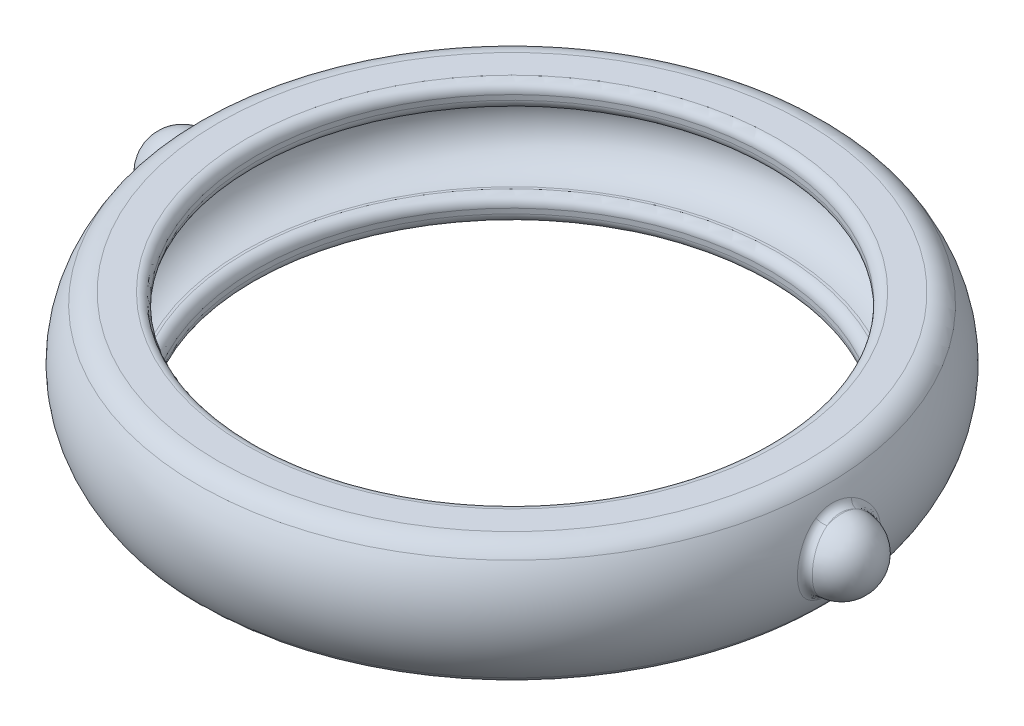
ISO-10303-21;
HEADER;
FILE_DESCRIPTION(('STEP AP214'),'2;1');
FILE_NAME('part.step','',(''),(''),'','','');
FILE_SCHEMA(('AUTOMOTIVE_DESIGN { 1 0 10303 214 1 1 1 1 }'));
ENDSEC;
DATA;
#1=APPLICATION_CONTEXT('core data for automotive mechanical design processes');
#2=APPLICATION_PROTOCOL_DEFINITION('international standard','automotive_design',2000,#1);
#3=PRODUCT_CONTEXT('',#1,'mechanical');
#4=PRODUCT('Part','Part','',(#3));
#5=PRODUCT_RELATED_PRODUCT_CATEGORY('part','',(#4));
#6=PRODUCT_DEFINITION_FORMATION('','',#4);
#7=PRODUCT_DEFINITION_CONTEXT('part definition',#1,'design');
#8=PRODUCT_DEFINITION('design','',#6,#7);
#9=PRODUCT_DEFINITION_SHAPE('','',#8);
#10=(LENGTH_UNIT() NAMED_UNIT(*) SI_UNIT(.MILLI.,.METRE.));
#11=(NAMED_UNIT(*) PLANE_ANGLE_UNIT() SI_UNIT($,.RADIAN.));
#12=(NAMED_UNIT(*) SI_UNIT($,.STERADIAN.) SOLID_ANGLE_UNIT());
#13=UNCERTAINTY_MEASURE_WITH_UNIT(LENGTH_MEASURE(1.E-05),#10,'distance_accuracy_value','');
#14=(GEOMETRIC_REPRESENTATION_CONTEXT(3) GLOBAL_UNCERTAINTY_ASSIGNED_CONTEXT((#13)) GLOBAL_UNIT_ASSIGNED_CONTEXT((#10,
#11,#12)) REPRESENTATION_CONTEXT('',''));
#15=CARTESIAN_POINT('',(0.,0.,0.));
#16=DIRECTION('',(0.,0.,1.));
#17=DIRECTION('',(1.,0.,0.));
#18=AXIS2_PLACEMENT_3D('',#15,#16,#17);
#19=CARTESIAN_POINT('',(-500000.,2.5,0.));
#20=DIRECTION('',(1.,0.,0.));
#21=DIRECTION('',(0.,0.,-1.));
#22=AXIS2_PLACEMENT_3D('',#19,#20,#21);
#23=CYLINDRICAL_SURFACE('',#22,1.4);
#24=CARTESIAN_POINT('',(13.4,2.5,0.));
#25=DIRECTION('',(1.,0.,0.));
#26=DIRECTION('',(0.,0.,-1.));
#27=AXIS2_PLACEMENT_3D('',#24,#25,#26);
#28=CIRCLE('',#27,1.4);
#29=CARTESIAN_POINT('',(13.4,1.23248301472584,0.594475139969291));
#30=VERTEX_POINT('',#29);
#31=CARTESIAN_POINT('',(13.4,1.23248301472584,-0.594475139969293));
#32=VERTEX_POINT('',#31);
#33=EDGE_CURVE('E124',#30,#32,#28,.T.);
#34=ORIENTED_EDGE('',*,*,#33,.F.);
#35=CARTESIAN_POINT('',(13.4003287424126,1.23331288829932,-0.596241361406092));
#36=CARTESIAN_POINT('',(13.1684053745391,1.24663864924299,-0.624551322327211));
#37=CARTESIAN_POINT('',(13.0797892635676,1.0560563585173,-0.727473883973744));
#38=CARTESIAN_POINT('',(13.4130485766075,1.26543845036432,-0.664491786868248));
#39=CARTESIAN_POINT('',(13.1779202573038,1.2817532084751,-0.695177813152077));
#40=CARTESIAN_POINT('',(13.0910883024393,1.09267747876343,-0.810684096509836));
#41=CARTESIAN_POINT('',(13.4273398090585,1.30301515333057,-0.729981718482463));
#42=CARTESIAN_POINT('',(13.1884742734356,1.32245652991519,-0.761993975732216));
#43=CARTESIAN_POINT('',(13.1037827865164,1.1355125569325,-0.890496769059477));
#44=CARTESIAN_POINT('',(13.4574809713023,1.38812594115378,-0.854054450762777));
#45=CARTESIAN_POINT('',(13.2103401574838,1.4133023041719,-0.887032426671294));
#46=CARTESIAN_POINT('',(13.130555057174,1.23253350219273,-1.04164090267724));
#47=CARTESIAN_POINT('',(13.4733339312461,1.43567959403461,-0.912623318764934));
#48=CARTESIAN_POINT('',(13.2216793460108,1.46364646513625,-0.945229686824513));
#49=CARTESIAN_POINT('',(13.1446355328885,1.28674167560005,-1.11295525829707));
#50=CARTESIAN_POINT('',(13.5057575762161,1.54227297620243,-1.02421408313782));
#51=CARTESIAN_POINT('',(13.2444333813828,1.57471088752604,-1.05462633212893));
#52=CARTESIAN_POINT('',(13.1734326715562,1.40825142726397,-1.24877266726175));
#53=CARTESIAN_POINT('',(13.5223229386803,1.60177982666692,-1.07679195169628));
#54=CARTESIAN_POINT('',(13.2558103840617,1.63592803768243,-1.10514233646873));
#55=CARTESIAN_POINT('',(13.1881445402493,1.47608549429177,-1.31273210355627));
#56=CARTESIAN_POINT('',(13.5535302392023,1.72891121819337,-1.17118661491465));
#57=CARTESIAN_POINT('',(13.2768155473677,1.76442272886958,-1.19452330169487));
#58=CARTESIAN_POINT('',(13.2158589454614,1.62100728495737,-1.42751552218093));
#59=CARTESIAN_POINT('',(13.5681756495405,1.79652066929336,-1.21302297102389));
#60=CARTESIAN_POINT('',(13.2864106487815,1.83169714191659,-1.23319757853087));
#61=CARTESIAN_POINT('',(13.2288645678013,1.69807780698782,-1.47836338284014));
#62=CARTESIAN_POINT('',(13.5940682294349,1.93829798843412,-1.28483935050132));
#63=CARTESIAN_POINT('',(13.3030923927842,1.97054651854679,-1.29878786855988));
#64=CARTESIAN_POINT('',(13.2518573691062,1.85969503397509,-1.56562287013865));
#65=CARTESIAN_POINT('',(13.6053104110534,2.01247527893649,-1.31480199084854));
#66=CARTESIAN_POINT('',(13.3101213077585,2.04197982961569,-1.32545139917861));
#67=CARTESIAN_POINT('',(13.2618401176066,1.94425247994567,-1.60201333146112));
#68=CARTESIAN_POINT('',(13.623178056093,2.16517136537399,-1.36171346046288));
#69=CARTESIAN_POINT('',(13.3211897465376,2.18737489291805,-1.36693772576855));
#70=CARTESIAN_POINT('',(13.2777058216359,2.11831641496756,-1.65897859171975));
#71=CARTESIAN_POINT('',(13.6298049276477,2.24368882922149,-1.37866625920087));
#72=CARTESIAN_POINT('',(13.325181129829,2.26104859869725,-1.38157484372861));
#73=CARTESIAN_POINT('',(13.2835900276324,2.20782138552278,-1.67955821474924));
#74=CARTESIAN_POINT('',(13.6375732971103,2.39929902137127,-1.39848217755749));
#75=CARTESIAN_POINT('',(13.3298687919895,2.40649596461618,-1.39872724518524));
#76=CARTESIAN_POINT('',(13.2904877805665,2.38520721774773,-1.70361260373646));
#77=CARTESIAN_POINT('',(13.6389329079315,2.47631369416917,-1.40190566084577));
#78=CARTESIAN_POINT('',(13.3306740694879,2.477890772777,-1.40164379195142));
#79=CARTESIAN_POINT('',(13.2916949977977,2.47299910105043,-1.7077676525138));
#80=CARTESIAN_POINT('',(13.6366372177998,2.62980705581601,-1.39608261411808));
#81=CARTESIAN_POINT('',(13.3292964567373,2.62079708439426,-1.39662616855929));
#82=CARTESIAN_POINT('',(13.2896566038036,2.64797187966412,-1.70069960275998));
#83=CARTESIAN_POINT('',(13.6329825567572,2.70628581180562,-1.38683770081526));
#84=CARTESIAN_POINT('',(13.3271206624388,2.69195851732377,-1.38871780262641));
#85=CARTESIAN_POINT('',(13.2864115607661,2.73515285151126,-1.68947846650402));
#86=CARTESIAN_POINT('',(13.6211472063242,2.85489491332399,-1.35634997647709));
#87=CARTESIAN_POINT('',(13.3199104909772,2.83179543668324,-1.36212062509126));
#88=CARTESIAN_POINT('',(13.2759025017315,2.90455788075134,-1.65246517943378));
#89=CARTESIAN_POINT('',(13.613062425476,2.92708266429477,-1.33536121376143));
#90=CARTESIAN_POINT('',(13.3149681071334,2.90019489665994,-1.34377729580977));
#91=CARTESIAN_POINT('',(13.2687236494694,2.98684737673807,-1.62698155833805));
#92=CARTESIAN_POINT('',(13.5931922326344,3.06689572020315,-1.2822726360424));
#93=CARTESIAN_POINT('',(13.302489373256,3.03464097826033,-1.29629774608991));
#94=CARTESIAN_POINT('',(13.2510794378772,3.14622546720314,-1.56250258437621));
#95=CARTESIAN_POINT('',(13.5814063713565,3.13452047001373,-1.25017147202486));
#96=CARTESIAN_POINT('',(13.2949968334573,3.10049134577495,-1.26733661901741));
#97=CARTESIAN_POINT('',(13.2406136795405,3.22331342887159,-1.52350559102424));
#98=CARTESIAN_POINT('',(13.5548824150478,3.26523288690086,-1.17484281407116));
#99=CARTESIAN_POINT('',(13.2776741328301,3.22975953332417,-1.19776525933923));
#100=CARTESIAN_POINT('',(13.2170596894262,3.37231736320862,-1.43195731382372));
#101=CARTESIAN_POINT('',(13.5400758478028,3.32815797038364,-1.13134902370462));
#102=CARTESIAN_POINT('',(13.2678303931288,3.29300492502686,-1.15706935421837));
#103=CARTESIAN_POINT('',(13.2039106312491,3.44404800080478,-1.37908154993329));
#104=CARTESIAN_POINT('',(13.5091251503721,3.44609983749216,-1.03475560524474));
#105=CARTESIAN_POINT('',(13.2467456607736,3.41325767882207,-1.06468957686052));
#106=CARTESIAN_POINT('',(13.1764234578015,3.57849431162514,-1.26159551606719));
#107=CARTESIAN_POINT('',(13.4929784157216,3.50110062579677,-0.981637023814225));
#108=CARTESIAN_POINT('',(13.2355270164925,3.47029607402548,-1.01315790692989));
#109=CARTESIAN_POINT('',(13.1620830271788,3.64119175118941,-1.19696209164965));
#110=CARTESIAN_POINT('',(13.4603507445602,3.60382427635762,-0.864792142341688));
#111=CARTESIAN_POINT('',(13.2124297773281,3.57798876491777,-0.897791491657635));
#112=CARTESIAN_POINT('',(13.1331040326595,3.75829025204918,-1.0547171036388));
#113=CARTESIAN_POINT('',(13.4438829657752,3.65115966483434,-0.800722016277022));
#114=CARTESIAN_POINT('',(13.2005310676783,3.62847815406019,-0.833610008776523));
#115=CARTESIAN_POINT('',(13.1184771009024,3.81224961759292,-0.976684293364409));
#116=CARTESIAN_POINT('',(13.4132597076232,3.73434175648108,-0.665355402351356));
#117=CARTESIAN_POINT('',(13.1781172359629,3.7178450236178,-0.69616831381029));
#118=CARTESIAN_POINT('',(13.0912759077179,3.9070719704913,-0.811737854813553));
#119=CARTESIAN_POINT('',(13.3990998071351,3.77021055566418,-0.594073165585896));
#120=CARTESIAN_POINT('',(13.1675603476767,3.75697207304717,-0.622891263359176));
#121=CARTESIAN_POINT('',(13.0786977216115,3.94796014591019,-0.724841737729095));
#122=CARTESIAN_POINT('',(13.3749532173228,3.82928650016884,-0.44641481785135));
#123=CARTESIAN_POINT('',(13.149448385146,3.82159315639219,-0.469853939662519));
#124=CARTESIAN_POINT('',(13.0572477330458,4.01530300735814,-0.544770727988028));
#125=CARTESIAN_POINT('',(13.3649460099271,3.85255607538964,-0.370065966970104));
#126=CARTESIAN_POINT('',(13.1418239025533,3.84737517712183,-0.389946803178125));
#127=CARTESIAN_POINT('',(13.0483577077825,4.04182885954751,-0.451629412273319));
#128=CARTESIAN_POINT('',(13.3504409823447,3.88580421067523,-0.214213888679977));
#129=CARTESIAN_POINT('',(13.1307754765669,3.88415761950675,-0.226308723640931));
#130=CARTESIAN_POINT('',(13.0354718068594,4.07972964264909,-0.261454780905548));
#131=CARTESIAN_POINT('',(13.3459405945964,3.89578896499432,-0.134712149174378));
#132=CARTESIAN_POINT('',(13.1273055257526,3.89531573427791,-0.142271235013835));
#133=CARTESIAN_POINT('',(13.0314736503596,4.09111163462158,-0.164423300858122));
#134=CARTESIAN_POINT('',(13.3432033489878,3.90188914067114,0.0206288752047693));
#135=CARTESIAN_POINT('',(13.1252061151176,3.90209930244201,0.0217302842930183));
#136=CARTESIAN_POINT('',(13.0290418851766,4.09806545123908,0.0251780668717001));
#137=CARTESIAN_POINT('',(13.3446453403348,3.8987156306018,0.0964374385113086));
#138=CARTESIAN_POINT('',(13.1263199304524,3.89854858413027,0.101991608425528));
#139=CARTESIAN_POINT('',(13.0303229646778,4.09444784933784,0.117710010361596));
#140=CARTESIAN_POINT('',(13.3528676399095,3.88022163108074,0.246356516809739));
#141=CARTESIAN_POINT('',(13.1326112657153,3.87802011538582,0.259991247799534));
#142=CARTESIAN_POINT('',(13.0376275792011,4.07336585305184,0.300678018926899));
#143=CARTESIAN_POINT('',(13.359647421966,3.86490233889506,0.32046719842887));
#144=CARTESIAN_POINT('',(13.1378124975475,3.86096451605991,0.338026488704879));
#145=CARTESIAN_POINT('',(13.0436506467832,4.05590282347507,0.391114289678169));
#146=CARTESIAN_POINT('',(13.3771969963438,3.82371332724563,0.461427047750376));
#147=CARTESIAN_POINT('',(13.1511039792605,3.81559102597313,0.485310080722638));
#148=CARTESIAN_POINT('',(13.0592409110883,4.00894994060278,0.563079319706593));
#149=CARTESIAN_POINT('',(13.3877580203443,3.79838953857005,0.528454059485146));
#150=CARTESIAN_POINT('',(13.159083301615,3.78770973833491,0.555017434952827));
#151=CARTESIAN_POINT('',(13.0686226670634,3.98008241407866,0.644827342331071));
#152=CARTESIAN_POINT('',(13.4117269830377,3.73794355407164,0.657722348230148));
#153=CARTESIAN_POINT('',(13.1769348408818,3.72193562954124,0.688190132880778));
#154=CARTESIAN_POINT('',(13.089914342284,3.91117779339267,0.802431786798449));
#155=CARTESIAN_POINT('',(13.4251403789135,3.70280253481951,0.719954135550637));
#156=CARTESIAN_POINT('',(13.1868487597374,3.68385551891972,0.751741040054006));
#157=CARTESIAN_POINT('',(13.1018291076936,3.87111924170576,0.878276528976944));
#158=CARTESIAN_POINT('',(13.4550842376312,3.61899684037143,0.845074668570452));
#159=CARTESIAN_POINT('',(13.2086277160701,3.59421545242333,0.878123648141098));
#160=CARTESIAN_POINT('',(13.1284262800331,3.77558602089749,1.0307061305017));
#161=CARTESIAN_POINT('',(13.4717957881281,3.56923729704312,0.907204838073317));
#162=CARTESIAN_POINT('',(13.220601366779,3.54145991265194,0.939931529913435));
#163=CARTESIAN_POINT('',(13.1432694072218,3.7188632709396,1.10635946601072));
#164=CARTESIAN_POINT('',(13.5051026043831,3.46001404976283,1.02207973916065));
#165=CARTESIAN_POINT('',(13.2439807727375,3.4276492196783,1.05256295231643));
#166=CARTESIAN_POINT('',(13.1728509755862,3.59435563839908,1.24617586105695));
#167=CARTESIAN_POINT('',(13.5216980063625,3.40056492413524,1.07483832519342));
#168=CARTESIAN_POINT('',(13.2553845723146,3.36646642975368,1.10327481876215));
#169=CARTESIAN_POINT('',(13.1875895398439,3.52658737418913,1.31035588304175));
#170=CARTESIAN_POINT('',(13.5530402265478,3.27327881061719,1.16976568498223));
#171=CARTESIAN_POINT('',(13.2764920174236,3.23776245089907,1.19320107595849));
#172=CARTESIAN_POINT('',(13.2154237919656,3.38148921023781,1.42578828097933));
#173=CARTESIAN_POINT('',(13.5677837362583,3.2054272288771,1.2119156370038));
#174=CARTESIAN_POINT('',(13.286155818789,3.17022316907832,1.23217923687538));
#175=CARTESIAN_POINT('',(13.2285165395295,3.30414267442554,1.47701768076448));
#176=CARTESIAN_POINT('',(13.5938276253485,3.06321267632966,1.28419189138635));
#177=CARTESIAN_POINT('',(13.3029408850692,3.03091335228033,1.29820830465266));
#178=CARTESIAN_POINT('',(13.2516437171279,3.14202702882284,1.56483643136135));
#179=CARTESIAN_POINT('',(13.6051290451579,2.98885168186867,1.31432182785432));
#180=CARTESIAN_POINT('',(13.310008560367,2.95929068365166,1.3250258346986));
#181=CARTESIAN_POINT('',(13.2616790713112,3.05726017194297,1.60143020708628));
#182=CARTESIAN_POINT('',(13.622893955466,2.83747111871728,1.36097141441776));
#183=CARTESIAN_POINT('',(13.3210136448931,2.81514329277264,1.3662804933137));
#184=CARTESIAN_POINT('',(13.277453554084,2.88469585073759,1.65807756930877));
#185=CARTESIAN_POINT('',(13.6294609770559,2.76054956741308,1.3777831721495));
#186=CARTESIAN_POINT('',(13.3249722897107,2.74293531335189,1.38080639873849));
#187=CARTESIAN_POINT('',(13.2832846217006,2.7970101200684,1.67848615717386));
#188=CARTESIAN_POINT('',(13.6374907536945,2.60481360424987,1.39827694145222));
#189=CARTESIAN_POINT('',(13.3298208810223,2.59731773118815,1.39855574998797));
#190=CARTESIAN_POINT('',(13.2904144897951,2.61948091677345,1.70336354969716));
#191=CARTESIAN_POINT('',(13.6389546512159,2.52599962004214,1.40196189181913));
#192=CARTESIAN_POINT('',(13.330687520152,2.52426392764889,1.40169362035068));
#193=CARTESIAN_POINT('',(13.2917143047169,2.52963793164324,1.70783592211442));
#194=CARTESIAN_POINT('',(13.6366760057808,2.3719655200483,1.39617996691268));
#195=CARTESIAN_POINT('',(13.3293193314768,2.38085189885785,1.39670868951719));
#196=CARTESIAN_POINT('',(13.2896910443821,2.35404874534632,1.70081775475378));
#197=CARTESIAN_POINT('',(13.6331321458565,2.29672405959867,1.38721499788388));
#198=CARTESIAN_POINT('',(13.3272092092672,2.3108415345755,1.38903871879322));
#199=CARTESIAN_POINT('',(13.2865443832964,2.2682782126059,1.6899363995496));
#200=CARTESIAN_POINT('',(13.6215335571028,2.14888629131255,1.35735274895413));
#201=CARTESIAN_POINT('',(13.3201473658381,2.17178264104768,1.36299990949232));
#202=CARTESIAN_POINT('',(13.2762455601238,2.09975245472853,1.65368269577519));
#203=CARTESIAN_POINT('',(13.6134788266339,2.07628998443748,1.33645546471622));
#204=CARTESIAN_POINT('',(13.315226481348,2.10302505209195,1.34474600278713));
#205=CARTESIAN_POINT('',(13.2690933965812,2.01699723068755,1.628310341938));
#206=CARTESIAN_POINT('',(13.5935857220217,1.93544686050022,1.283341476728));
#207=CARTESIAN_POINT('',(13.3027395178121,1.9676391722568,1.29726329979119));
#208=CARTESIAN_POINT('',(13.2514288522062,1.85644492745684,1.56380098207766));
#209=CARTESIAN_POINT('',(13.5817345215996,1.86721574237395,1.25108636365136));
#210=CARTESIAN_POINT('',(13.2952093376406,1.90121894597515,1.26817639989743));
#211=CARTESIAN_POINT('',(13.2409050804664,1.77866574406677,1.52461726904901));
#212=CARTESIAN_POINT('',(13.5553681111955,1.73704363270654,1.17623893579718));
#213=CARTESIAN_POINT('',(13.27799191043,1.77249118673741,1.19905481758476));
#214=CARTESIAN_POINT('',(13.2174910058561,1.63027772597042,1.4336542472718));
#215=CARTESIAN_POINT('',(13.5408523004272,1.67510406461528,1.13364428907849));
#216=CARTESIAN_POINT('',(13.2683470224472,1.71026740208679,1.15921652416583));
#217=CARTESIAN_POINT('',(13.2046001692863,1.55967051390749,1.38187209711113));
#218=CARTESIAN_POINT('',(13.5099021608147,1.55656622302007,1.03730465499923));
#219=CARTESIAN_POINT('',(13.2472869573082,1.58951754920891,1.06717258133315));
#220=CARTESIAN_POINT('',(13.1771135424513,1.42454482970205,1.26469704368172));
#221=CARTESIAN_POINT('',(13.4934137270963,1.50028888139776,0.983175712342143));
#222=CARTESIAN_POINT('',(13.2358369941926,1.53117167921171,1.014687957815));
#223=CARTESIAN_POINT('',(13.1624696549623,1.36039219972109,1.19883511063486));
#224=CARTESIAN_POINT('',(13.4607656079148,1.39746295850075,0.866297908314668));
#225=CARTESIAN_POINT('',(13.2127219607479,1.42335152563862,0.89926871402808));
#226=CARTESIAN_POINT('',(13.1334725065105,1.24317711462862,1.05655035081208));
#227=CARTESIAN_POINT('',(13.4446059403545,1.35091490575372,0.803548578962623));
#228=CARTESIAN_POINT('',(13.2010516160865,1.37372350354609,0.836430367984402));
#229=CARTESIAN_POINT('',(13.1191192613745,1.19011526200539,0.980126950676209));
#230=CARTESIAN_POINT('',(13.4140757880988,1.26776807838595,0.669316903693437));
#231=CARTESIAN_POINT('',(13.1787222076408,1.2844466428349,0.70022939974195));
#232=CARTESIAN_POINT('',(13.0920008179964,1.09533310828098,0.816566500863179));
#233=CARTESIAN_POINT('',(13.3997582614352,1.23143826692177,0.597659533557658));
#234=CARTESIAN_POINT('',(13.1680523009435,1.24482748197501,0.626595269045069));
#235=CARTESIAN_POINT('',(13.0792826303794,1.05391940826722,0.729214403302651));
#236=CARTESIAN_POINT('',(13.3752742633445,1.17146231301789,0.448798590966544));
#237=CARTESIAN_POINT('',(13.1496934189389,1.17923839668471,0.472352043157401));
#238=CARTESIAN_POINT('',(13.0575329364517,0.98555059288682,0.547678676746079));
#239=CARTESIAN_POINT('',(13.3651062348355,1.14781141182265,0.371597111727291));
#240=CARTESIAN_POINT('',(13.1419465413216,1.15303342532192,0.391557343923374));
#241=CARTESIAN_POINT('',(13.0485000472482,0.958590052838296,0.45349762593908));
#242=CARTESIAN_POINT('',(13.3506685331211,1.11471711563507,0.216840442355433));
#243=CARTESIAN_POINT('',(13.1309479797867,1.11641629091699,0.229058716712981));
#244=CARTESIAN_POINT('',(13.0356739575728,0.920864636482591,0.264659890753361));
#245=CARTESIAN_POINT('',(13.3461957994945,1.10478346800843,0.139402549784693));
#246=CARTESIAN_POINT('',(13.1275007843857,1.10531936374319,0.147221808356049));
#247=CARTESIAN_POINT('',(13.0317003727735,0.90954090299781,0.170147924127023));
#248=CARTESIAN_POINT('',(13.3431247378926,1.09793228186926,-0.01611091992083));
#249=CARTESIAN_POINT('',(13.1251465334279,1.09770427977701,-0.0169492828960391));
#250=CARTESIAN_POINT('',(13.0289720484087,0.901730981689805,-0.0196634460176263));
#251=CARTESIAN_POINT('',(13.344524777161,1.101011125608,-0.094186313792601));
#252=CARTESIAN_POINT('',(13.1262283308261,1.10115021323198,-0.0996255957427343));
#253=CARTESIAN_POINT('',(13.030215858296,0.905240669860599,-0.11496262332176));
#254=CARTESIAN_POINT('',(13.3527955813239,1.11961826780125,-0.245093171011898));
#255=CARTESIAN_POINT('',(13.1325556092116,1.12180050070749,-0.258656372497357));
#256=CARTESIAN_POINT('',(13.0375635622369,0.926451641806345,-0.299136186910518));
#257=CARTESIAN_POINT('',(13.3594204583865,1.13458722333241,-0.318003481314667));
#258=CARTESIAN_POINT('',(13.13763762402,1.13846444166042,-0.335427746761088));
#259=CARTESIAN_POINT('',(13.043449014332,0.943515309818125,-0.388107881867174));
#260=CARTESIAN_POINT('',(13.3769725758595,1.17573908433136,-0.460235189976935));
#261=CARTESIAN_POINT('',(13.1509367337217,1.18381370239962,-0.484091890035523));
#262=CARTESIAN_POINT('',(13.059041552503,0.990425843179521,-0.561626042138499));
#263=CARTESIAN_POINT('',(13.3879005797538,1.20192397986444,-0.529555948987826));
#264=CARTESIAN_POINT('',(13.1591962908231,1.21265263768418,-0.556194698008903));
#265=CARTESIAN_POINT('',(13.0687493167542,1.02027497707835,-0.646171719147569));
#266=CARTESIAN_POINT('',(13.4003287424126,1.23331288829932,-0.596241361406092));
#267=CARTESIAN_POINT('',(13.1684053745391,1.24663864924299,-0.624551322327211));
#268=CARTESIAN_POINT('',(13.0797892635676,1.0560563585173,-0.727473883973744));
#269=(BOUNDED_SURFACE() B_SPLINE_SURFACE(3,2,((#35,#36,#37),(#38,#39,#40),(#41,#42,#43),(#44,
#45,#46),(#47,#48,#49),(#50,#51,#52),(#53,#54,#55),(#56,#57,#58),(#59,#60,#61),(#62,#63,#64),
(#65,#66,#67),(#68,#69,#70),(#71,#72,#73),(#74,#75,#76),(#77,#78,#79),(#80,#81,#82),(#83,#84,
#85),(#86,#87,#88),(#89,#90,#91),(#92,#93,#94),(#95,#96,#97),(#98,#99,#100),(#101,#102,#103),
(#104,#105,#106),(#107,#108,#109),(#110,#111,#112),(#113,#114,#115),(#116,#117,#118),(#119,#120,
#121),(#122,#123,#124),(#125,#126,#127),(#128,#129,#130),(#131,#132,#133),(#134,#135,#136),
(#137,#138,#139),(#140,#141,#142),(#143,#144,#145),(#146,#147,#148),(#149,#150,#151),(#152,#153,
#154),(#155,#156,#157),(#158,#159,#160),(#161,#162,#163),(#164,#165,#166),(#167,#168,#169),
(#170,#171,#172),(#173,#174,#175),(#176,#177,#178),(#179,#180,#181),(#182,#183,#184),(#185,#186,
#187),(#188,#189,#190),(#191,#192,#193),(#194,#195,#196),(#197,#198,#199),(#200,#201,#202),
(#203,#204,#205),(#206,#207,#208),(#209,#210,#211),(#212,#213,#214),(#215,#216,#217),(#218,#219,
#220),(#221,#222,#223),(#224,#225,#226),(#227,#228,#229),(#230,#231,#232),(#233,#234,#235),
(#236,#237,#238),(#239,#240,#241),(#242,#243,#244),(#245,#246,#247),(#248,#249,#250),(#251,#252,
#253),(#254,#255,#256),(#257,#258,#259),(#260,#261,#262),(#263,#264,#265),(#266,#267,#268)),
.UNSPECIFIED.,.T.,.F.,.F.) B_SPLINE_SURFACE_WITH_KNOTS((4,2,2,2,2,2,2,2,2,2,2,2,2,2,2,2,2,2,2,2,
2,2,2,2,2,2,2,2,2,2,2,2,2,2,2,2,2,2,4),(3,3),(0.,0.285124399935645,0.570813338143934,
0.87128965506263,1.17121482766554,1.47157748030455,1.77184845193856,2.05954355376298,
2.34720194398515,2.62886560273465,2.91056346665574,3.19954713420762,3.48910618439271,
3.79045407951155,4.09121772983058,4.39047711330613,4.68959691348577,4.97276898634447,
5.2559131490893,5.52536716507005,5.79534141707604,6.09658155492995,6.39737258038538,
6.69869356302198,6.99992337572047,7.29434774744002,7.58870620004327,7.87170845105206,
8.1547108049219,8.43867954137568,8.7227123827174,9.01833103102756,9.31396573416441,
9.6167773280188,9.91947518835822,10.2110472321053,10.5025382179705,10.7810751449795,
11.0596615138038),(0.,1.),
.UNSPECIFIED.) GEOMETRIC_REPRESENTATION_ITEM() RATIONAL_B_SPLINE_SURFACE(((1.,0.83129182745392,
1.),(1.,0.827310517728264,1.),(1.,0.822788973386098,1.),(1.,0.81310115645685,1.),(1.,
0.807933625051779,1.),(1.,0.797192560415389,1.),(1.,0.791611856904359,1.),(1.,0.780933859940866,
1.),(1.,0.775835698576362,1.),(1.,0.766711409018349,1.),(1.,0.7626868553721,1.),(1.,
0.756243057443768,1.),(1.,0.753823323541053,1.),(1.,0.750982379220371,1.),(1.,0.750481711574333,
1.),(1.,0.751323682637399,1.),(1.,0.752666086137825,1.),(1.,0.756973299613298,1.),(1.,
0.759903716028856,1.),(1.,0.767014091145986,1.),(1.,0.771194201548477,1.),(1.,0.780458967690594,
1.),(1.,0.785564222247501,1.),(1.,0.796060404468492,1.),(1.,0.801451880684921,1.),(1.,
0.812174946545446,1.),(1.,0.817495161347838,1.),(1.,0.827251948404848,1.),(1.,0.831690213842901,
1.),(1.,0.839185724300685,1.),(1.,0.84224976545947,1.),(1.,0.846671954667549,1.),(1.,
0.848030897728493,1.),(1.,0.848858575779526,1.),(1.,0.848424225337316,1.),(1.,0.84593122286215,
1.),(1.,0.843872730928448,1.),(1.,0.838486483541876,1.),(1.,0.835224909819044,1.),(1.,
0.827725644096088,1.),(1.,0.82348607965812,1.),(1.,0.81388033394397,1.),(1.,0.808440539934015,
1.),(1.,0.797412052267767,1.),(1.,0.791823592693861,1.),(1.,0.781103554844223,1.),(1.,
0.775972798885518,1.),(1.,0.766797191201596,1.),(1.,0.762752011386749,1.),(1.,0.756345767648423,
1.),(1.,0.753948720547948,1.),(1.,0.751012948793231,1.),(1.,0.750473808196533,1.),(1.,
0.75130938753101,1.),(1.,0.75261107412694,1.),(1.,0.756833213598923,1.),(1.,0.759753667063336,
1.),(1.,0.766874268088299,1.),(1.,0.771078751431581,1.),(1.,0.780290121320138,1.),(1.,
0.78529718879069,1.),(1.,0.795800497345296,1.),(1.,0.801308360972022,1.),(1.,0.812039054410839,
1.),(1.,0.817261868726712,1.),(1.,0.82699479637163,1.),(1.,0.831484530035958,1.),(1.,
0.839087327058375,1.),(1.,0.842200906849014,1.),(1.,0.846602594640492,1.),(1.,0.847953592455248,
1.),(1.,0.848882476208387,1.),(1.,0.848460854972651,1.),(1.,0.845952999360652,1.),(1.,
0.843941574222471,1.),(1.,0.838556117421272,1.),(1.,0.835181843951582,1.),(1.,0.83129182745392,1.))) REPRESENTATION_ITEM('') SURFACE());
#270=CARTESIAN_POINT('',(13.4003287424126,1.23331288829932,-0.596241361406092));
#271=CARTESIAN_POINT('',(13.4130485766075,1.26543845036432,-0.664491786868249));
#272=CARTESIAN_POINT('',(13.4273398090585,1.30301515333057,-0.729981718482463));
#273=CARTESIAN_POINT('',(13.4574809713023,1.38812594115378,-0.854054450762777));
#274=CARTESIAN_POINT('',(13.4733339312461,1.43567959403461,-0.912623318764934));
#275=CARTESIAN_POINT('',(13.5057575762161,1.54227297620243,-1.02421408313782));
#276=CARTESIAN_POINT('',(13.5223229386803,1.60177982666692,-1.07679195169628));
#277=CARTESIAN_POINT('',(13.5535302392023,1.72891121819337,-1.17118661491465));
#278=CARTESIAN_POINT('',(13.5681756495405,1.79652066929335,-1.21302297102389));
#279=CARTESIAN_POINT('',(13.5940682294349,1.93829798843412,-1.28483935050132));
#280=CARTESIAN_POINT('',(13.6053104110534,2.01247527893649,-1.31480199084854));
#281=CARTESIAN_POINT('',(13.623178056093,2.16517136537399,-1.36171346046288));
#282=CARTESIAN_POINT('',(13.6298049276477,2.24368882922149,-1.37866625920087));
#283=CARTESIAN_POINT('',(13.6375732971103,2.39929902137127,-1.39848217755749));
#284=CARTESIAN_POINT('',(13.6389329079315,2.47631369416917,-1.40190566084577));
#285=CARTESIAN_POINT('',(13.6366372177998,2.62980705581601,-1.39608261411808));
#286=CARTESIAN_POINT('',(13.6329825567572,2.70628581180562,-1.38683770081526));
#287=CARTESIAN_POINT('',(13.6211472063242,2.85489491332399,-1.35634997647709));
#288=CARTESIAN_POINT('',(13.613062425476,2.92708266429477,-1.33536121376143));
#289=CARTESIAN_POINT('',(13.5931922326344,3.06689572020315,-1.2822726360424));
#290=CARTESIAN_POINT('',(13.5814063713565,3.13452047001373,-1.25017147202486));
#291=CARTESIAN_POINT('',(13.5548824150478,3.26523288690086,-1.17484281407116));
#292=CARTESIAN_POINT('',(13.5400758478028,3.32815797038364,-1.13134902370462));
#293=CARTESIAN_POINT('',(13.5091251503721,3.44609983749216,-1.03475560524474));
#294=CARTESIAN_POINT('',(13.4929784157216,3.50110062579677,-0.981637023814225));
#295=CARTESIAN_POINT('',(13.4603507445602,3.60382427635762,-0.864792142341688));
#296=CARTESIAN_POINT('',(13.4438829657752,3.65115966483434,-0.800722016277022));
#297=CARTESIAN_POINT('',(13.4132597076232,3.73434175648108,-0.665355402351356));
#298=CARTESIAN_POINT('',(13.3990998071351,3.77021055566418,-0.594073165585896));
#299=CARTESIAN_POINT('',(13.3749532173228,3.82928650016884,-0.44641481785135));
#300=CARTESIAN_POINT('',(13.3649460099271,3.85255607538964,-0.370065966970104));
#301=CARTESIAN_POINT('',(13.3504409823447,3.88580421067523,-0.214213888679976));
#302=CARTESIAN_POINT('',(13.3459405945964,3.89578896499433,-0.134712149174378));
#303=CARTESIAN_POINT('',(13.3432033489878,3.90188914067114,0.0206288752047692));
#304=CARTESIAN_POINT('',(13.3446453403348,3.8987156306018,0.0964374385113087));
#305=CARTESIAN_POINT('',(13.3528676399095,3.88022163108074,0.246356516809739));
#306=CARTESIAN_POINT('',(13.359647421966,3.86490233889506,0.32046719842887));
#307=CARTESIAN_POINT('',(13.3771969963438,3.82371332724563,0.461427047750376));
#308=CARTESIAN_POINT('',(13.3877580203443,3.79838953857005,0.528454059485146));
#309=CARTESIAN_POINT('',(13.4117269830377,3.73794355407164,0.657722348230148));
#310=CARTESIAN_POINT('',(13.4251403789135,3.70280253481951,0.719954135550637));
#311=CARTESIAN_POINT('',(13.4550842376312,3.61899684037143,0.845074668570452));
#312=CARTESIAN_POINT('',(13.4717957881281,3.56923729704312,0.907204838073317));
#313=CARTESIAN_POINT('',(13.5051026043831,3.46001404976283,1.02207973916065));
#314=CARTESIAN_POINT('',(13.5216980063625,3.40056492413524,1.07483832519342));
#315=CARTESIAN_POINT('',(13.5530402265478,3.27327881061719,1.16976568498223));
#316=CARTESIAN_POINT('',(13.5677837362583,3.2054272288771,1.2119156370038));
#317=CARTESIAN_POINT('',(13.5938276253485,3.06321267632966,1.28419189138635));
#318=CARTESIAN_POINT('',(13.6051290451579,2.98885168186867,1.31432182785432));
#319=CARTESIAN_POINT('',(13.622893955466,2.83747111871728,1.36097141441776));
#320=CARTESIAN_POINT('',(13.6294609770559,2.76054956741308,1.3777831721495));
#321=CARTESIAN_POINT('',(13.6374907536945,2.60481360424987,1.39827694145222));
#322=CARTESIAN_POINT('',(13.6389546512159,2.52599962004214,1.40196189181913));
#323=CARTESIAN_POINT('',(13.6366760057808,2.3719655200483,1.39617996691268));
#324=CARTESIAN_POINT('',(13.6331321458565,2.29672405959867,1.38721499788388));
#325=CARTESIAN_POINT('',(13.6215335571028,2.14888629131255,1.35735274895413));
#326=CARTESIAN_POINT('',(13.6134788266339,2.07628998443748,1.33645546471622));
#327=CARTESIAN_POINT('',(13.5935857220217,1.93544686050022,1.283341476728));
#328=CARTESIAN_POINT('',(13.5817345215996,1.86721574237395,1.25108636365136));
#329=CARTESIAN_POINT('',(13.5553681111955,1.73704363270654,1.17623893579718));
#330=CARTESIAN_POINT('',(13.5408523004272,1.67510406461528,1.13364428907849));
#331=CARTESIAN_POINT('',(13.5099021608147,1.55656622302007,1.03730465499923));
#332=CARTESIAN_POINT('',(13.4934137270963,1.50028888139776,0.983175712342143));
#333=CARTESIAN_POINT('',(13.4607656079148,1.39746295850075,0.866297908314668));
#334=CARTESIAN_POINT('',(13.4446059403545,1.35091490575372,0.803548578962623));
#335=CARTESIAN_POINT('',(13.4140757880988,1.26776807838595,0.669316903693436));
#336=CARTESIAN_POINT('',(13.3997582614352,1.23143826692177,0.597659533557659));
#337=CARTESIAN_POINT('',(13.3752742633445,1.17146231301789,0.448798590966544));
#338=CARTESIAN_POINT('',(13.3651062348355,1.14781141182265,0.371597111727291));
#339=CARTESIAN_POINT('',(13.3506685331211,1.11471711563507,0.216840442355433));
#340=CARTESIAN_POINT('',(13.3461957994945,1.10478346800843,0.139402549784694));
#341=CARTESIAN_POINT('',(13.3431247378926,1.09793228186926,-0.0161109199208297));
#342=CARTESIAN_POINT('',(13.344524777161,1.101011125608,-0.0941863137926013));
#343=CARTESIAN_POINT('',(13.3527955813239,1.11961826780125,-0.245093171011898));
#344=CARTESIAN_POINT('',(13.3594204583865,1.13458722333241,-0.318003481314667));
#345=CARTESIAN_POINT('',(13.3769725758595,1.17573908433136,-0.460235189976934));
#346=CARTESIAN_POINT('',(13.3879005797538,1.20192397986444,-0.529555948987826));
#347=CARTESIAN_POINT('',(13.4003287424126,1.23331288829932,-0.596241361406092));
#348=B_SPLINE_CURVE_WITH_KNOTS('',3,(#270,#271,#272,#273,#274,#275,#276,#277,#278,#279,#280,
#281,#282,#283,#284,#285,#286,#287,#288,#289,#290,#291,#292,#293,#294,#295,#296,#297,#298,#299,
#300,#301,#302,#303,#304,#305,#306,#307,#308,#309,#310,#311,#312,#313,#314,#315,#316,#317,#318,
#319,#320,#321,#322,#323,#324,#325,#326,#327,#328,#329,#330,#331,#332,#333,#334,#335,#336,#337,
#338,#339,#340,#341,#342,#343,#344,#345,#346,#347),.UNSPECIFIED.,.T.,.F.,(4,2,2,2,2,2,2,2,2,2,2,
2,2,2,2,2,2,2,2,2,2,2,2,2,2,2,2,2,2,2,2,2,2,2,2,2,2,2,4),(0.,0.285124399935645,
0.570813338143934,0.87128965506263,1.17121482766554,1.47157748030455,1.77184845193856,
2.05954355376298,2.34720194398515,2.62886560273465,2.91056346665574,3.19954713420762,
3.48910618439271,3.79045407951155,4.09121772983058,4.39047711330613,4.68959691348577,
4.97276898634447,5.2559131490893,5.52536716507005,5.79534141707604,6.09658155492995,
6.39737258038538,6.69869356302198,6.99992337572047,7.29434774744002,7.58870620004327,
7.87170845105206,8.1547108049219,8.43867954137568,8.7227123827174,9.01833103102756,
9.31396573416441,9.6167773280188,9.91947518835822,10.2110472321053,10.5025382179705,
10.7810751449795,11.0596615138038),.UNSPECIFIED.);
#349=EDGE_CURVE('E11',#30,#32,#348,.T.);
#350=ORIENTED_EDGE('',*,*,#349,.T.);
#351=EDGE_LOOP('',(#34,#350));
#352=FACE_BOUND('',#351,.T.);
#353=ADVANCED_FACE('F35',(#352),#23,.T.);
#354=CARTESIAN_POINT('',(500000.,2.5,0.));
#355=DIRECTION('',(-1.,0.,0.));
#356=DIRECTION('',(0.,0.,1.));
#357=AXIS2_PLACEMENT_3D('',#354,#355,#356);
#358=CYLINDRICAL_SURFACE('',#357,1.4);
#359=CARTESIAN_POINT('',(-13.4,2.5,0.));
#360=DIRECTION('',(1.,0.,0.));
#361=DIRECTION('',(0.,0.,-1.));
#362=AXIS2_PLACEMENT_3D('',#359,#360,#361);
#363=CIRCLE('',#362,1.4);
#364=CARTESIAN_POINT('',(-13.4,3.76751698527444,-0.594475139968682));
#365=VERTEX_POINT('',#364);
#366=CARTESIAN_POINT('',(-13.4,3.76751698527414,0.594475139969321));
#367=VERTEX_POINT('',#366);
#368=EDGE_CURVE('E108',#365,#367,#363,.T.);
#369=ORIENTED_EDGE('',*,*,#368,.T.);
#370=CARTESIAN_POINT('',(-13.1552368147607,3.6684231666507,-1.16285574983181));
#371=CARTESIAN_POINT('',(-13.2299767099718,3.49575391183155,-0.985046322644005));
#372=CARTESIAN_POINT('',(-13.4852702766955,3.52498915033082,-0.953623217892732));
#373=CARTESIAN_POINT('',(-13.1404890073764,3.72977498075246,-1.09253179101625));
#374=CARTESIAN_POINT('',(-13.2184259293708,3.55150341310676,-0.928883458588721));
#375=CARTESIAN_POINT('',(-13.4686652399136,3.57880950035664,-0.895845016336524));
#376=CARTESIAN_POINT('',(-13.125766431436,3.78549939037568,-1.01652224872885));
#377=CARTESIAN_POINT('',(-13.206483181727,3.60345043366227,-0.866516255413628));
#378=CARTESIAN_POINT('',(-13.4520895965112,3.62769325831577,-0.833427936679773));
#379=CARTESIAN_POINT('',(-13.0979978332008,3.88444711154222,-0.855055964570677));
#380=CARTESIAN_POINT('',(-13.1836882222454,3.69638635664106,-0.732412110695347));
#381=CARTESIAN_POINT('',(-13.420827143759,3.71449429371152,-0.700898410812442));
#382=CARTESIAN_POINT('',(-13.0849559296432,3.92764002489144,-0.76957693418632));
#383=CARTESIAN_POINT('',(-13.172803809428,3.7375697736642,-0.660639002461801));
#384=CARTESIAN_POINT('',(-13.406144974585,3.75238490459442,-0.630767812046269));
#385=CARTESIAN_POINT('',(-13.0622716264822,3.99993850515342,-0.591532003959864));
#386=CARTESIAN_POINT('',(-13.1537253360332,3.80675628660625,-0.509788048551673));
#387=CARTESIAN_POINT('',(-13.3806085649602,3.81580812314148,-0.484752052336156));
#388=CARTESIAN_POINT('',(-13.052626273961,4.02905631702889,-0.498972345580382));
#389=CARTESIAN_POINT('',(-13.1454744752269,3.83500070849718,-0.430556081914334));
#390=CARTESIAN_POINT('',(-13.3697509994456,3.84135147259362,-0.408871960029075));
#391=CARTESIAN_POINT('',(-13.0381013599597,4.07213323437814,-0.309571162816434));
#392=CARTESIAN_POINT('',(-13.1330429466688,3.87674869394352,-0.267830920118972));
#393=CARTESIAN_POINT('',(-13.3534008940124,3.87914032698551,-0.253641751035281));
#394=CARTESIAN_POINT('',(-13.0332127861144,4.08612101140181,-0.212738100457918));
#395=CARTESIAN_POINT('',(-13.1288064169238,3.89044818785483,-0.184053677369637));
#396=CARTESIAN_POINT('',(-13.3478982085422,3.89141098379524,-0.174298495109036));
#397=CARTESIAN_POINT('',(-13.0290292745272,4.09811156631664,-0.0228805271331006));
#398=CARTESIAN_POINT('',(-13.1251971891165,3.90213895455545,-0.0198920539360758));
#399=CARTESIAN_POINT('',(-13.3431891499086,3.90192959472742,-0.0187445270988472));
#400=CARTESIAN_POINT('',(-13.02945562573,4.09691077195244,0.0700788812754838));
#401=CARTESIAN_POINT('',(-13.1255677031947,3.90095956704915,0.060756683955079));
#402=CARTESIAN_POINT('',(-13.3436690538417,3.9008762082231,0.0574134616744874));
#403=CARTESIAN_POINT('',(-13.0351675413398,4.0804864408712,0.254482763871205));
#404=CARTESIAN_POINT('',(-13.130492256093,3.88495659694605,0.220120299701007));
#405=CARTESIAN_POINT('',(-13.3500985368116,3.88646810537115,0.208503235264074));
#406=CARTESIAN_POINT('',(-13.0404592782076,4.06524509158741,0.345925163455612));
#407=CARTESIAN_POINT('',(-13.1350709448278,3.87005273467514,0.299140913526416));
#408=CARTESIAN_POINT('',(-13.356055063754,3.87309776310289,0.28343333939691));
#409=CARTESIAN_POINT('',(-13.05505685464,4.02170438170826,0.522820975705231));
#410=CARTESIAN_POINT('',(-13.147542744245,3.82789993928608,0.450910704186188));
#411=CARTESIAN_POINT('',(-13.3724870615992,3.83490205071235,0.428422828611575));
#412=CARTESIAN_POINT('',(-13.0642850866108,3.9936567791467,0.608354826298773));
#413=CARTESIAN_POINT('',(-13.1554132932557,3.80074202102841,0.523987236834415));
#414=CARTESIAN_POINT('',(-13.3828751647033,3.8102975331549,0.498547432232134));
#415=CARTESIAN_POINT('',(-13.0855563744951,3.92557711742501,0.773121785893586));
#416=CARTESIAN_POINT('',(-13.1733035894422,3.73563827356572,0.663599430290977));
#417=CARTESIAN_POINT('',(-13.4068209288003,3.75057523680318,0.633676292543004));
#418=CARTESIAN_POINT('',(-13.0975952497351,3.88556283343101,0.852364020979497));
#419=CARTESIAN_POINT('',(-13.1833630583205,3.69752550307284,0.730269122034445));
#420=CARTESIAN_POINT('',(-13.4203738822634,3.71547305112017,0.698687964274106));
#421=CARTESIAN_POINT('',(-13.1104641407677,3.84001399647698,0.927512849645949));
#422=CARTESIAN_POINT('',(-13.1938529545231,3.65493701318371,0.792184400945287));
#423=CARTESIAN_POINT('',(-13.4348619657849,3.67551572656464,0.760370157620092));
#424=(BOUNDED_SURFACE() B_SPLINE_SURFACE(3,2,((#370,#371,#372),(#373,#374,#375),(#376,#377,
#378),(#379,#380,#381),(#382,#383,#384),(#385,#386,#387),(#388,#389,#390),(#391,#392,#393),
(#394,#395,#396),(#397,#398,#399),(#400,#401,#402),(#403,#404,#405),(#406,#407,#408),(#409,#410,
#411),(#412,#413,#414),(#415,#416,#417),(#418,#419,#420),(#421,#422,#423)),.UNSPECIFIED.,.F.,
.F.,.F.) B_SPLINE_SURFACE_WITH_KNOTS((4,2,2,2,2,2,2,2,4),(3,3),(0.,0.299980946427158,
0.600683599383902,0.901124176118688,1.20099441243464,1.48520883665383,1.76978432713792,
2.04899141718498,2.32778581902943),(0.,1.),
.UNSPECIFIED.) GEOMETRIC_REPRESENTATION_ITEM() RATIONAL_B_SPLINE_SURFACE(((1.,0.803977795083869,
1.),(1.,0.809475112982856,1.),(1.,0.814852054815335,1.),(1.,0.824856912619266,1.),(1.,
0.829482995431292,1.),(1.,0.83744291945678,1.),(1.,0.840777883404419,1.),(1.,0.845774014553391,
1.),(1.,0.847438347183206,1.),(1.,0.848863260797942,1.),(1.,0.848718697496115,1.),(1.,
0.846771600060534,1.),(1.,0.844966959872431,1.),(1.,0.839936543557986,1.),(1.,0.836738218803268,
1.),(1.,0.829270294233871,1.),(1.,0.825002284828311,1.),(1.,0.820365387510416,1.))) REPRESENTATION_ITEM('') SURFACE());
#425=CARTESIAN_POINT('',(-13.4874478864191,1.4820970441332,-0.961183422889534));
#426=CARTESIAN_POINT('',(-13.4852705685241,1.47498217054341,-0.953650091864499));
#427=CARTESIAN_POINT('',(-13.4830936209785,1.46795494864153,-0.946040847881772));
#428=CARTESIAN_POINT('',(-13.4496104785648,1.36111537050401,-0.827718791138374));
#429=CARTESIAN_POINT('',(-13.4183981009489,1.27826287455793,-0.700122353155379));
#430=CARTESIAN_POINT('',(-13.3703448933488,1.15849307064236,-0.426728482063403));
#431=CARTESIAN_POINT('',(-13.3531555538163,1.1204506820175,-0.281482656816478));
#432=CARTESIAN_POINT('',(-13.3403291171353,1.09156761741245,0.0222718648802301));
#433=CARTESIAN_POINT('',(-13.3457961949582,1.10314616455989,0.181081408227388));
#434=CARTESIAN_POINT('',(-13.3781868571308,1.17828820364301,0.489332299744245));
#435=CARTESIAN_POINT('',(-13.4059173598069,1.2438091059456,0.638188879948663));
#436=CARTESIAN_POINT('',(-13.4681511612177,1.41720049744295,0.901010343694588));
#437=CARTESIAN_POINT('',(-13.5024769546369,1.52402255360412,1.01572340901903));
#438=CARTESIAN_POINT('',(-13.5631493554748,1.76555377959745,1.20114303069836));
#439=CARTESIAN_POINT('',(-13.5897616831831,1.89896625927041,1.27343612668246));
#440=CARTESIAN_POINT('',(-13.6269467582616,2.18363935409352,1.37201065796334));
#441=CARTESIAN_POINT('',(-13.6375814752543,2.33482854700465,1.39846992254));
#442=CARTESIAN_POINT('',(-13.6387455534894,2.64212953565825,1.40143811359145));
#443=CARTESIAN_POINT('',(-13.6286991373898,2.79825985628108,1.37651653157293));
#444=CARTESIAN_POINT('',(-13.5915007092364,3.09204910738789,1.278168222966));
#445=CARTESIAN_POINT('',(-13.5642986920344,3.22965260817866,1.20459966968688));
#446=CARTESIAN_POINT('',(-13.5018778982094,3.47858914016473,1.01395005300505));
#447=CARTESIAN_POINT('',(-13.4663476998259,3.58842107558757,0.895021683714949));
#448=CARTESIAN_POINT('',(-13.4060225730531,3.75529016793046,0.63703594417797));
#449=CARTESIAN_POINT('',(-13.3805763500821,3.8159887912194,0.50051053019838));
#450=CARTESIAN_POINT('',(-13.3478853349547,3.89219960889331,0.21062548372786));
#451=CARTESIAN_POINT('',(-13.3409116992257,3.90703916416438,0.057049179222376));
#452=CARTESIAN_POINT('',(-13.3503084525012,3.88600352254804,-0.254510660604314));
#453=CARTESIAN_POINT('',(-13.3680246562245,3.84720554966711,-0.412250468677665));
#454=CARTESIAN_POINT('',(-13.4188656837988,3.72064687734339,-0.704054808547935));
#455=CARTESIAN_POINT('',(-13.452079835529,3.63260173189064,-0.837975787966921));
#456=CARTESIAN_POINT('',(-13.5171405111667,3.42165704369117,-1.06467057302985));
#457=CARTESIAN_POINT('',(-13.5489888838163,3.30028319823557,-1.15886919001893));
#458=CARTESIAN_POINT('',(-13.6000590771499,3.03511368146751,-1.30217473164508));
#459=CARTESIAN_POINT('',(-13.6195994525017,2.89201415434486,-1.35243359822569));
#460=CARTESIAN_POINT('',(-13.6402067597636,2.59240688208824,-1.40534490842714));
#461=CARTESIAN_POINT('',(-13.6408562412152,2.43567283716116,-1.40692162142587));
#462=CARTESIAN_POINT('',(-13.6218803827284,2.12472950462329,-1.35836541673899));
#463=CARTESIAN_POINT('',(-13.6013375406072,1.97095434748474,-1.30589263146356));
#464=CARTESIAN_POINT('',(-13.5491008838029,1.70084755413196,-1.15906104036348));
#465=CARTESIAN_POINT('',(-13.518237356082,1.58270852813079,-1.06771231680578));
#466=CARTESIAN_POINT('',(-13.4874478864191,1.4820970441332,-0.961183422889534));
#467=B_SPLINE_CURVE_WITH_KNOTS('',3,(#425,#426,#427,#428,#429,#430,#431,#432,#433,#434,#435,
#436,#437,#438,#439,#440,#441,#442,#443,#444,#445,#446,#447,#448,#449,#450,#451,#452,#453,#454,
#455,#456,#457,#458,#459,#460,#461,#462,#463,#464,#465,#466),.UNSPECIFIED.,.T.,.F.,(4,2,2,2,2,2,
2,2,2,2,2,2,2,2,2,2,2,2,2,2,4),(0.,0.0317599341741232,0.488594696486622,0.933696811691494,
1.40073998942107,1.88551894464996,2.35872392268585,2.81286715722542,3.26524439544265,
3.73038630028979,4.19689030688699,4.68487129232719,5.1318380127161,5.5853302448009,
6.06453152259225,6.54652962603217,7.00935542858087,7.45964863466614,7.91988502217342,
8.40091851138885,8.85003599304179),.UNSPECIFIED.);
#468=EDGE_CURVE('E105',#367,#365,#467,.T.);
#469=ORIENTED_EDGE('',*,*,#468,.T.);
#470=EDGE_LOOP('',(#369,#469));
#471=FACE_BOUND('',#470,.T.);
#472=ADVANCED_FACE('F107',(#471),#358,.T.);
#473=CARTESIAN_POINT('',(0.,2.5,0.));
#474=DIRECTION('',(0.,1.,0.));
#475=DIRECTION('',(-1.,0.,0.));
#476=AXIS2_PLACEMENT_3D('',#473,#474,#475);
#477=TOROIDAL_SURFACE('',#476,9.77500000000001,3.625);
#478=CARTESIAN_POINT('',(-13.033859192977,4.08452035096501,0.19752627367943));
#479=CARTESIAN_POINT('',(-13.1325438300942,3.88233927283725,0.170199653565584));
#480=CARTESIAN_POINT('',(-13.3588928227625,3.89000681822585,0.161837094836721));
#481=CARTESIAN_POINT('',(-13.0371865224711,4.07471257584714,0.28924904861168));
#482=CARTESIAN_POINT('',(-13.135156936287,3.87331345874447,0.249314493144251));
#483=CARTESIAN_POINT('',(-13.3618901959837,3.88140303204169,0.236989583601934));
#484=CARTESIAN_POINT('',(-13.0430055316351,4.05791915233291,0.379912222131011));
#485=CARTESIAN_POINT('',(-13.1397433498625,3.8577520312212,0.327310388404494));
#486=CARTESIAN_POINT('',(-13.3671322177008,3.86667114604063,0.31128636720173));
#487=CARTESIAN_POINT('',(-13.0585713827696,4.01111578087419,0.556619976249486));
#488=CARTESIAN_POINT('',(-13.1519183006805,3.81472060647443,0.478840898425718));
#489=CARTESIAN_POINT('',(-13.381153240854,3.82561329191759,0.456131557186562));
#490=CARTESIAN_POINT('',(-13.068311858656,3.98112724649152,0.642671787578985));
#491=CARTESIAN_POINT('',(-13.1595218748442,3.78719532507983,0.552493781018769));
#492=CARTESIAN_POINT('',(-13.3899265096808,3.79930610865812,0.526685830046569));
#493=CARTESIAN_POINT('',(-13.0911003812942,3.90729862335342,0.811056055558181));
#494=CARTESIAN_POINT('',(-13.1771650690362,3.71993878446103,0.695944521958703));
#495=CARTESIAN_POINT('',(-13.4104497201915,3.7345405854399,0.664796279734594));
#496=CARTESIAN_POINT('',(-13.1042583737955,3.86298303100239,0.893129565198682));
#497=CARTESIAN_POINT('',(-13.1873060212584,3.67969496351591,0.765542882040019));
#498=CARTESIAN_POINT('',(-13.4222985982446,3.69566511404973,0.732142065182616));
#499=CARTESIAN_POINT('',(-13.1321038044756,3.76212308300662,1.04777188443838));
#500=CARTESIAN_POINT('',(-13.208564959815,3.58891953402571,0.895982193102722));
#501=CARTESIAN_POINT('',(-13.4473701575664,3.60718659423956,0.859090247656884));
#502=CARTESIAN_POINT('',(-13.1467915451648,3.70557630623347,1.12033880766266));
#503=CARTESIAN_POINT('',(-13.2196957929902,3.53829548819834,0.956811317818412));
#504=CARTESIAN_POINT('',(-13.4605931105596,3.55758142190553,0.91869110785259));
#505=CARTESIAN_POINT('',(-13.1760469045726,3.58179180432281,1.25408544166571));
#506=CARTESIAN_POINT('',(-13.2416656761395,3.42845733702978,1.06833221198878));
#507=CARTESIAN_POINT('',(-13.4869273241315,3.44899253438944,1.0285887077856));
#508=CARTESIAN_POINT('',(-13.1906145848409,3.51455996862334,1.31527138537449));
#509=CARTESIAN_POINT('',(-13.2525025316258,3.36919649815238,1.11896313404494));
#510=CARTESIAN_POINT('',(-13.5000386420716,3.39001398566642,1.07889054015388));
#511=CARTESIAN_POINT('',(-13.2180793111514,3.37117202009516,1.42481913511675));
#512=CARTESIAN_POINT('',(-13.2727741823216,3.24382327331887,1.20920286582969));
#513=CARTESIAN_POINT('',(-13.5247547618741,3.26422814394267,1.16898643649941));
#514=CARTESIAN_POINT('',(-13.2309762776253,3.29501548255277,1.47318033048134));
#515=CARTESIAN_POINT('',(-13.2821931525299,3.17771549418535,1.24871250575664));
#516=CARTESIAN_POINT('',(-13.5363594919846,3.19742047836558,1.2087800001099));
#517=CARTESIAN_POINT('',(-13.2538156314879,3.13550314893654,1.55608601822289));
#518=CARTESIAN_POINT('',(-13.2987804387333,3.04013482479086,1.31623427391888));
#519=CARTESIAN_POINT('',(-13.556908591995,3.05748965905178,1.27701856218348));
#520=CARTESIAN_POINT('',(-13.263744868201,3.05211736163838,1.59056924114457));
#521=CARTESIAN_POINT('',(-13.3059160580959,2.96870702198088,1.34409132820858));
#522=CARTESIAN_POINT('',(-13.5658411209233,2.98434019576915,1.30541323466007));
#523=CARTESIAN_POINT('',(-13.2795575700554,2.88079906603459,1.64456108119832));
#524=CARTESIAN_POINT('',(-13.3172512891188,2.82255241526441,1.38766228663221));
#525=CARTESIAN_POINT('',(-13.5800657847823,2.83405269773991,1.34987987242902));
#526=CARTESIAN_POINT('',(-13.2854413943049,2.79286696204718,1.66407102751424));
#527=CARTESIAN_POINT('',(-13.3214309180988,2.74794416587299,1.40329648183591));
#528=CARTESIAN_POINT('',(-13.5853582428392,2.75691501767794,1.36595293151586));
#529=CARTESIAN_POINT('',(-13.2925363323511,2.61588117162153,1.68751706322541));
#530=CARTESIAN_POINT('',(-13.3264763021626,2.59795875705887,1.42211080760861));
#531=CARTESIAN_POINT('',(-13.5917400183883,2.60165575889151,1.38526943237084));
#532=CARTESIAN_POINT('',(-13.2937930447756,2.52684715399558,1.69160513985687));
#533=CARTESIAN_POINT('',(-13.3273643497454,2.52274286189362,1.42537486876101));
#534=CARTESIAN_POINT('',(-13.592870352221,2.5235514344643,1.38863807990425));
#535=CARTESIAN_POINT('',(-13.291637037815,2.34937964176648,1.68452783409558));
#536=CARTESIAN_POINT('',(-13.3258338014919,2.37256500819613,1.41970254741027));
#537=CARTESIAN_POINT('',(-13.5909311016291,2.36786958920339,1.38280685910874));
#538=CARTESIAN_POINT('',(-13.2882245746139,2.26094611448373,1.67336328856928));
#539=CARTESIAN_POINT('',(-13.3234185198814,2.29775680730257,1.41077841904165));
#540=CARTESIAN_POINT('',(-13.587861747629,2.29029203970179,1.37360768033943));
#541=CARTESIAN_POINT('',(-13.2771010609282,2.08773411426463,1.63617076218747));
#542=CARTESIAN_POINT('',(-13.3154847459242,2.15060611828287,1.38087040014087));
#543=CARTESIAN_POINT('',(-13.5778559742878,2.13834330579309,1.34296979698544));
#544=CARTESIAN_POINT('',(-13.2694159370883,2.00293688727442,1.61023240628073));
#545=CARTESIAN_POINT('',(-13.309999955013,2.07838544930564,1.36001658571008));
#546=CARTESIAN_POINT('',(-13.5709428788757,2.06395566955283,1.32160489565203));
#547=CARTESIAN_POINT('',(-13.250518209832,1.83877534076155,1.54417739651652));
#548=CARTESIAN_POINT('',(-13.2963817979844,1.93771758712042,1.30651292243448));
#549=CARTESIAN_POINT('',(-13.5539418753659,1.9199463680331,1.26721623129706));
#550=CARTESIAN_POINT('',(-13.2393049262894,1.75941207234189,1.50405800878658));
#551=CARTESIAN_POINT('',(-13.2882692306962,1.86936339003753,1.27395022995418));
#552=CARTESIAN_POINT('',(-13.543853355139,1.85032562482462,1.23419022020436));
#553=CARTESIAN_POINT('',(-13.2143687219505,1.60766952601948,1.41021861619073));
#554=CARTESIAN_POINT('',(-13.2700382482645,1.73774891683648,1.19716623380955));
#555=CARTESIAN_POINT('',(-13.5214156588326,1.7172107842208,1.15697703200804));
#556=CARTESIAN_POINT('',(-13.2006261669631,1.53535217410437,1.35639084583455));
#557=CARTESIAN_POINT('',(-13.2599238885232,1.67457051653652,1.1529533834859));
#558=CARTESIAN_POINT('',(-13.5090487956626,1.65377101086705,1.11270142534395));
#559=CARTESIAN_POINT('',(-13.1721272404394,1.40040186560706,1.2366074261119));
#560=CARTESIAN_POINT('',(-13.2387330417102,1.55583369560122,1.05376851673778));
#561=CARTESIAN_POINT('',(-13.4833992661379,1.53538701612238,1.01422478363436));
#562=CARTESIAN_POINT('',(-13.1573714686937,1.33776324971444,1.1706589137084));
#563=CARTESIAN_POINT('',(-13.2276677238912,1.50025109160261,0.998890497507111));
#564=CARTESIAN_POINT('',(-13.4701171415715,1.4804378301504,0.960029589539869));
#565=CARTESIAN_POINT('',(-13.1314429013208,1.23561985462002,1.043046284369));
#566=CARTESIAN_POINT('',(-13.2080447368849,1.40900075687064,0.891884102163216));
#567=CARTESIAN_POINT('',(-13.4467749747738,1.39083341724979,0.855213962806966));
#568=CARTESIAN_POINT('',(-13.1201611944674,1.19401092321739,0.983325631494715));
#569=CARTESIAN_POINT('',(-13.1994500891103,1.3715994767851,0.841621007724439));
#570=CARTESIAN_POINT('',(-13.4366175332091,1.35433234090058,0.806179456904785));
#571=CARTESIAN_POINT('',(-13.0987668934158,1.11858552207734,0.858279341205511));
#572=CARTESIAN_POINT('',(-13.1830634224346,1.3035256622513,0.735907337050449));
#573=CARTESIAN_POINT('',(-13.4173534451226,1.28816605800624,0.703546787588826));
#574=CARTESIAN_POINT('',(-13.0886537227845,1.08476520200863,0.792956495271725));
#575=CARTESIAN_POINT('',(-13.1752634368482,1.27280304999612,0.680457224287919));
#576=CARTESIAN_POINT('',(-13.4082462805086,1.25849747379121,0.649950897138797));
#577=CARTESIAN_POINT('',(-13.0683188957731,1.01890735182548,0.642749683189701));
#578=CARTESIAN_POINT('',(-13.1595264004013,1.21283295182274,0.552561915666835));
#579=CARTESIAN_POINT('',(-13.3899328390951,1.20072424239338,0.526749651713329));
#580=CARTESIAN_POINT('',(-13.0585663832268,0.988912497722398,0.556731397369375));
#581=CARTESIAN_POINT('',(-13.1519129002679,1.18529564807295,0.478952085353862));
#582=CARTESIAN_POINT('',(-13.3811487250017,1.17441151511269,0.456222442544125));
#583=CARTESIAN_POINT('',(-13.0469221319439,0.953835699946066,0.424290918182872));
#584=CARTESIAN_POINT('',(-13.1428000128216,1.15303394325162,0.365265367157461));
#585=CARTESIAN_POINT('',(-13.3706601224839,1.14364069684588,0.347663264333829));
#586=CARTESIAN_POINT('',(-13.0435342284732,0.943785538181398,0.379478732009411));
#587=CARTESIAN_POINT('',(-13.1401436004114,1.14377603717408,0.326765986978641));
#588=CARTESIAN_POINT('',(-13.3676083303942,1.13482427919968,0.31093640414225));
#589=CARTESIAN_POINT('',(-13.0378535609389,0.927077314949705,0.289042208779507));
#590=CARTESIAN_POINT('',(-13.1356854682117,1.12837348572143,0.249009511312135));
#591=CARTESIAN_POINT('',(-13.3624911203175,1.12016713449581,0.236824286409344));
#592=CARTESIAN_POINT('',(-13.0355608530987,0.920419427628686,0.243417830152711));
#593=CARTESIAN_POINT('',(-13.1338817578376,1.12222178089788,0.209735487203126));
#594=CARTESIAN_POINT('',(-13.36042575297,1.11432656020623,0.199438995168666));
#595=CARTESIAN_POINT('',(-13.0338591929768,0.915479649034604,0.197526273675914));
#596=CARTESIAN_POINT('',(-13.1325438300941,1.11766072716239,0.170199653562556));
#597=CARTESIAN_POINT('',(-13.3588928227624,1.1099931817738,0.16183709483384));
#598=(BOUNDED_SURFACE() B_SPLINE_SURFACE(3,2,((#478,#479,#480),(#481,#482,#483),(#484,#485,
#486),(#487,#488,#489),(#490,#491,#492),(#493,#494,#495),(#496,#497,#498),(#499,#500,#501),
(#502,#503,#504),(#505,#506,#507),(#508,#509,#510),(#511,#512,#513),(#514,#515,#516),(#517,#518,
#519),(#520,#521,#522),(#523,#524,#525),(#526,#527,#528),(#529,#530,#531),(#532,#533,#534),
(#535,#536,#537),(#538,#539,#540),(#541,#542,#543),(#544,#545,#546),(#547,#548,#549),(#550,#551,
#552),(#553,#554,#555),(#556,#557,#558),(#559,#560,#561),(#562,#563,#564),(#565,#566,#567),
(#568,#569,#570),(#571,#572,#573),(#574,#575,#576),(#577,#578,#579),(#580,#581,#582),(#583,#584,
#585),(#586,#587,#588),(#589,#590,#591),(#592,#593,#594),(#595,#596,#597)),.UNSPECIFIED.,.F.,
.F.,.F.) B_SPLINE_SURFACE_WITH_KNOTS((4,2,2,2,2,2,2,2,2,2,2,2,2,2,2,2,2,2,2,4),(3,3),(0.,
0.283426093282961,0.566393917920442,0.859930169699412,1.15352457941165,1.44695772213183,
1.7404048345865,2.03513362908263,2.32983625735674,2.62162679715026,2.91340132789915,
3.20342438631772,3.49350338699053,3.78593724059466,4.07819945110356,4.30990620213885,
4.5414981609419,4.82422847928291,4.96618375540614,5.10814631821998),(0.,1.),
.UNSPECIFIED.) GEOMETRIC_REPRESENTATION_ITEM() RATIONAL_B_SPLINE_SURFACE(((1.,0.839392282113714,
1.),(1.,0.838808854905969,1.),(1.,0.837788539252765,1.),(1.,0.835060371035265,1.),(1.,
0.833353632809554,1.),(1.,0.829362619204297,1.),(1.,0.827059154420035,1.),(1.,0.822187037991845,
1.),(1.,0.819618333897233,1.),(1.,0.814504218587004,1.),(1.,0.811958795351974,1.),(1.,
0.807161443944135,1.),(1.,0.804909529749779,1.),(1.,0.800922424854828,1.),(1.,0.799189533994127,
1.),(1.,0.796430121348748,1.),(1.,0.795403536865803,1.),(1.,0.794165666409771,1.),(1.,
0.793946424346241,1.),(1.,0.794322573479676,1.),(1.,0.794917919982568,1.),(1.,0.796858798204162,
1.),(1.,0.798199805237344,1.),(1.,0.801498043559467,1.),(1.,0.803455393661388,1.),(1.,
0.807809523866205,1.),(1.,0.810209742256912,1.),(1.,0.815189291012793,1.),(1.,0.817768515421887,
1.),(1.,0.822302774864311,1.),(1.,0.824276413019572,1.),(1.,0.828020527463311,1.),(1.,
0.829791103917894,1.),(1.,0.833352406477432,1.),(1.,0.835061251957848,1.),(1.,0.837102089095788,
1.),(1.,0.837695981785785,1.),(1.,0.838691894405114,1.),(1.,0.839093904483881,1.),(1.,
0.839392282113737,1.))) REPRESENTATION_ITEM('') SURFACE());
#599=CARTESIAN_POINT('',(-13.033859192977,4.08452035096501,0.19752627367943));
#600=CARTESIAN_POINT('',(-13.037186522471,4.07471257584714,0.28924904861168));
#601=CARTESIAN_POINT('',(-13.0430055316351,4.05791915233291,0.379912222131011));
#602=CARTESIAN_POINT('',(-13.0585713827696,4.01111578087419,0.556619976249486));
#603=CARTESIAN_POINT('',(-13.068311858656,3.98112724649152,0.642671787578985));
#604=CARTESIAN_POINT('',(-13.0911003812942,3.90729862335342,0.811056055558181));
#605=CARTESIAN_POINT('',(-13.1042583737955,3.86298303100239,0.893129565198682));
#606=CARTESIAN_POINT('',(-13.1321038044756,3.76212308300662,1.04777188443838));
#607=CARTESIAN_POINT('',(-13.1467915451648,3.70557630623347,1.12033880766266));
#608=CARTESIAN_POINT('',(-13.1760469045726,3.58179180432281,1.25408544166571));
#609=CARTESIAN_POINT('',(-13.1906145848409,3.51455996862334,1.31527138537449));
#610=CARTESIAN_POINT('',(-13.2180793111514,3.37117202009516,1.42481913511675));
#611=CARTESIAN_POINT('',(-13.2309762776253,3.29501548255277,1.47318033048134));
#612=CARTESIAN_POINT('',(-13.2538156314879,3.13550314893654,1.55608601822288));
#613=CARTESIAN_POINT('',(-13.263744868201,3.05211736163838,1.59056924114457));
#614=CARTESIAN_POINT('',(-13.2795575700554,2.88079906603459,1.64456108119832));
#615=CARTESIAN_POINT('',(-13.2854413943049,2.79286696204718,1.66407102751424));
#616=CARTESIAN_POINT('',(-13.2925363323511,2.61588117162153,1.68751706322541));
#617=CARTESIAN_POINT('',(-13.2937930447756,2.52684715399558,1.69160513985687));
#618=CARTESIAN_POINT('',(-13.291637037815,2.34937964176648,1.68452783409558));
#619=CARTESIAN_POINT('',(-13.2882245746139,2.26094611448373,1.67336328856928));
#620=CARTESIAN_POINT('',(-13.2771010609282,2.08773411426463,1.63617076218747));
#621=CARTESIAN_POINT('',(-13.2694159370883,2.00293688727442,1.61023240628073));
#622=CARTESIAN_POINT('',(-13.250518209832,1.83877534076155,1.54417739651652));
#623=CARTESIAN_POINT('',(-13.2393049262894,1.75941207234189,1.50405800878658));
#624=CARTESIAN_POINT('',(-13.2143687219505,1.60766952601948,1.41021861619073));
#625=CARTESIAN_POINT('',(-13.2006261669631,1.53535217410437,1.35639084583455));
#626=CARTESIAN_POINT('',(-13.1721272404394,1.40040186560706,1.2366074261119));
#627=CARTESIAN_POINT('',(-13.1573714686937,1.33776324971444,1.1706589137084));
#628=CARTESIAN_POINT('',(-13.1314429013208,1.23561985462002,1.043046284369));
#629=CARTESIAN_POINT('',(-13.1201611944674,1.19401092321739,0.983325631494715));
#630=CARTESIAN_POINT('',(-13.0987668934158,1.11858552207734,0.858279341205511));
#631=CARTESIAN_POINT('',(-13.0886537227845,1.08476520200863,0.792956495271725));
#632=CARTESIAN_POINT('',(-13.0683188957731,1.01890735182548,0.642749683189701));
#633=CARTESIAN_POINT('',(-13.0585663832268,0.988912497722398,0.556731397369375));
#634=CARTESIAN_POINT('',(-13.0469221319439,0.953835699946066,0.424290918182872));
#635=CARTESIAN_POINT('',(-13.0435342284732,0.943785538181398,0.379478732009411));
#636=CARTESIAN_POINT('',(-13.0378535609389,0.927077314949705,0.289042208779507));
#637=CARTESIAN_POINT('',(-13.0355608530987,0.920419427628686,0.243417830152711));
#638=CARTESIAN_POINT('',(-13.0338591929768,0.915479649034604,0.197526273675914));
#639=B_SPLINE_CURVE_WITH_KNOTS('',3,(#599,#600,#601,#602,#603,#604,#605,#606,#607,#608,#609,
#610,#611,#612,#613,#614,#615,#616,#617,#618,#619,#620,#621,#622,#623,#624,#625,#626,#627,#628,
#629,#630,#631,#632,#633,#634,#635,#636,#637,#638),.UNSPECIFIED.,.F.,.F.,(4,2,2,2,2,2,2,2,2,2,2,
2,2,2,2,2,2,2,2,4),(0.,0.283426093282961,0.566393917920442,0.859930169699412,1.15352457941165,
1.44695772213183,1.7404048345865,2.03513362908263,2.32983625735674,2.62162679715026,
2.91340132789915,3.20342438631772,3.49350338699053,3.78593724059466,4.07819945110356,
4.30990620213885,4.5414981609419,4.82422847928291,4.96618375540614,5.10814631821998),.UNSPECIFIED.);
#640=CARTESIAN_POINT('',(-13.0794972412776,3.94488964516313,0.725320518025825));
#641=VERTEX_POINT('',#640);
#642=CARTESIAN_POINT('',(-13.0794972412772,1.05511035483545,0.725320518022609));
#643=VERTEX_POINT('',#642);
#644=EDGE_CURVE('E285',#641,#643,#639,.T.);
#645=ORIENTED_EDGE('',*,*,#644,.T.);
#646=CARTESIAN_POINT('',(-13.1127275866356,1.16804302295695,0.940691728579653));
#647=CARTESIAN_POINT('',(-13.1957091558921,1.35262976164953,0.803122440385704));
#648=CARTESIAN_POINT('',(-13.4374102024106,1.33155222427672,0.771187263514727));
#649=CARTESIAN_POINT('',(-13.1057124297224,1.1429831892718,0.900108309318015));
#650=CARTESIAN_POINT('',(-13.1899809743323,1.3291828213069,0.769574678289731));
#651=CARTESIAN_POINT('',(-13.429512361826,1.3095687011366,0.737875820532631));
#652=CARTESIAN_POINT('',(-13.0989147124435,1.1195369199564,0.858359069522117));
#653=CARTESIAN_POINT('',(-13.1843620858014,1.30702855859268,0.734726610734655));
#654=CARTESIAN_POINT('',(-13.4218595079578,1.28900066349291,0.70361534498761));
#655=CARTESIAN_POINT('',(-13.0859582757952,1.07601978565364,0.77274766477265));
#656=CARTESIAN_POINT('',(-13.1735917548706,1.26575242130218,0.662892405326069));
#657=CARTESIAN_POINT('',(-13.4072734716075,1.25082563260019,0.633375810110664));
#658=CARTESIAN_POINT('',(-13.0797997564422,1.05594997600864,0.728884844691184));
#659=CARTESIAN_POINT('',(-13.1684344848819,1.24660172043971,0.62589489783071));
#660=CARTESIAN_POINT('',(-13.4003405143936,1.23321956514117,0.597396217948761));
#661=CARTESIAN_POINT('',(-13.0625957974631,1.00104972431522,0.594493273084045));
#662=CARTESIAN_POINT('',(-13.1539970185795,1.19419688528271,0.512300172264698));
#663=CARTESIAN_POINT('',(-13.38097349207,1.18505879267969,0.487180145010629));
#664=CARTESIAN_POINT('',(-13.0528219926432,0.971528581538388,0.501161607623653));
#665=CARTESIAN_POINT('',(-13.1456409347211,1.16556614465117,0.432430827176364));
#666=CARTESIAN_POINT('',(-13.3699713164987,1.15916162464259,0.410666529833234));
#667=CARTESIAN_POINT('',(-13.0383440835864,0.928582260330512,0.313081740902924));
#668=CARTESIAN_POINT('',(-13.1332514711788,1.1239439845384,0.270848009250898));
#669=CARTESIAN_POINT('',(-13.3536741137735,1.12148733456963,0.256518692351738));
#670=CARTESIAN_POINT('',(-13.0334872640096,0.914670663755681,0.218475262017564));
#671=CARTESIAN_POINT('',(-13.1290429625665,1.1103227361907,0.189012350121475));
#672=CARTESIAN_POINT('',(-13.348207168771,1.10928350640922,0.178999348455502));
#673=CARTESIAN_POINT('',(-13.0290076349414,0.901821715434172,0.0280664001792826));
#674=CARTESIAN_POINT('',(-13.1251792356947,1.09779832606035,0.0243881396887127));
#675=CARTESIAN_POINT('',(-13.3431647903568,1.09801187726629,0.0229931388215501));
#676=CARTESIAN_POINT('',(-13.029376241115,0.902859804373,-0.0677337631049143));
#677=CARTESIAN_POINT('',(-13.1255003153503,1.09881847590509,-0.0587406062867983));
#678=CARTESIAN_POINT('',(-13.3435796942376,1.09892253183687,-0.0554919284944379));
#679=CARTESIAN_POINT('',(-13.0351289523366,0.919403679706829,-0.253028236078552));
#680=CARTESIAN_POINT('',(-13.1304580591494,1.11493509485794,-0.218855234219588));
#681=CARTESIAN_POINT('',(-13.3500551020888,1.1134355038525,-0.207311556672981));
#682=CARTESIAN_POINT('',(-13.0402726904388,0.934216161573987,-0.342605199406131));
#683=CARTESIAN_POINT('',(-13.1349066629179,1.12941811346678,-0.296251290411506));
#684=CARTESIAN_POINT('',(-13.3558450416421,1.12642962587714,-0.280713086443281));
#685=CARTESIAN_POINT('',(-13.0545624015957,0.976804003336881,-0.517829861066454));
#686=CARTESIAN_POINT('',(-13.1471232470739,1.17065781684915,-0.44665331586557));
#687=CARTESIAN_POINT('',(-13.3719304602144,1.16378944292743,-0.424331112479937));
#688=CARTESIAN_POINT('',(-13.0637140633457,1.00459779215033,-0.603471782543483));
#689=CARTESIAN_POINT('',(-13.1549360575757,1.19757366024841,-0.519879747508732));
#690=CARTESIAN_POINT('',(-13.3822323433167,1.18817130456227,-0.494542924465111));
#691=CARTESIAN_POINT('',(-13.0851089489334,1.07291351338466,-0.770104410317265));
#692=CARTESIAN_POINT('',(-13.1729252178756,1.26293508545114,-0.661025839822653));
#693=CARTESIAN_POINT('',(-13.4063172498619,1.24810068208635,-0.631201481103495));
#694=CARTESIAN_POINT('',(-13.0974072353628,1.1136656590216,-0.850976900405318));
#695=CARTESIAN_POINT('',(-13.1831875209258,1.30177683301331,-0.728940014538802));
#696=CARTESIAN_POINT('',(-13.4201622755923,1.28385015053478,-0.69755221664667));
#697=CARTESIAN_POINT('',(-13.1235665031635,1.20646757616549,-1.00431513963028));
#698=CARTESIAN_POINT('',(-13.2046790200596,1.38900123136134,-0.856381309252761));
#699=CARTESIAN_POINT('',(-13.4496128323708,1.36525983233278,-0.823406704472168));
#700=CARTESIAN_POINT('',(-13.1374244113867,1.25849531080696,-1.07679686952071));
#701=CARTESIAN_POINT('',(-13.2159364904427,1.4375527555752,-0.915940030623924));
#702=CARTESIAN_POINT('',(-13.4652149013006,1.41090071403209,-0.88292347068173));
#703=CARTESIAN_POINT('',(-13.1513705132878,1.31561685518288,-1.14426407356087));
#704=CARTESIAN_POINT('',(-13.2269085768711,1.48961343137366,-0.9700207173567));
#705=CARTESIAN_POINT('',(-13.4809171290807,1.46101009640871,-0.938349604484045));
#706=(BOUNDED_SURFACE() B_SPLINE_SURFACE(3,2,((#646,#647,#648),(#649,#650,#651),(#652,#653,
#654),(#655,#656,#657),(#658,#659,#660),(#661,#662,#663),(#664,#665,#666),(#667,#668,#669),
(#670,#671,#672),(#673,#674,#675),(#676,#677,#678),(#679,#680,#681),(#682,#683,#684),(#685,#686,
#687),(#688,#689,#690),(#691,#692,#693),(#694,#695,#696),(#697,#698,#699),(#700,#701,#702),
(#703,#704,#705)),.UNSPECIFIED.,.F.,.F.,.F.) B_SPLINE_SURFACE_WITH_KNOTS((4,2,2,2,2,2,2,2,2,4),
(3,3),(0.,0.151437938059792,0.30292312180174,0.605894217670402,0.899136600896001,
1.19189730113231,1.4706765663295,1.74985280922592,2.03429543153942,2.3181870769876),(0.,1.),
.UNSPECIFIED.) GEOMETRIC_REPRESENTATION_ITEM() RATIONAL_B_SPLINE_SURFACE(((1.,0.819549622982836,
1.),(1.,0.822080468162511,1.),(1.,0.824512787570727,1.),(1.,0.829118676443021,1.),(1.,
0.831292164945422,1.),(1.,0.837329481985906,1.),(1.,0.840710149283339,1.),(1.,0.84569092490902,
1.),(1.,0.847344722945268,1.),(1.,0.848870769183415,1.),(1.,0.84874593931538,1.),(1.,
0.846784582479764,1.),(1.,0.845030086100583,1.),(1.,0.840108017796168,1.),(1.,0.836938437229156,
1.),(1.,0.829427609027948,1.),(1.,0.825065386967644,1.),(1.,0.815649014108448,1.),(1.,
0.810596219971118,1.),(1.,0.805414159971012,1.))) REPRESENTATION_ITEM('') SURFACE());
#707=CARTESIAN_POINT('',(-13.1571708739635,1.33965464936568,-1.17205777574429));
#708=CARTESIAN_POINT('',(-13.1843650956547,1.4537357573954,-1.30109941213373));
#709=CARTESIAN_POINT('',(-13.2117861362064,1.58796785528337,-1.4122794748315));
#710=CARTESIAN_POINT('',(-13.2581493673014,1.89596524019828,-1.59055209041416));
#711=CARTESIAN_POINT('',(-13.2765171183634,2.07155208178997,-1.65476038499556));
#712=CARTESIAN_POINT('',(-13.2934042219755,2.42660172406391,-1.71388781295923));
#713=CARTESIAN_POINT('',(-13.292817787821,2.60549232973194,-1.71192837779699));
#714=CARTESIAN_POINT('',(-13.2744977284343,2.94744263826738,-1.64759239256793));
#715=CARTESIAN_POINT('',(-13.2570629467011,3.11072380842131,-1.58626876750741));
#716=CARTESIAN_POINT('',(-13.2116451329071,3.41351716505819,-1.41184307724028));
#717=CARTESIAN_POINT('',(-13.1832565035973,3.5517704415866,-1.29670873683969));
#718=CARTESIAN_POINT('',(-13.125406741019,3.79261296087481,-1.02035436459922));
#719=CARTESIAN_POINT('',(-13.0959948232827,3.89232075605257,-0.856637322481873));
#720=CARTESIAN_POINT('',(-13.0508402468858,4.03651102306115,-0.501383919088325));
#721=CARTESIAN_POINT('',(-13.0353397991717,4.08002052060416,-0.309419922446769));
#722=CARTESIAN_POINT('',(-13.0269983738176,4.10393638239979,0.0694320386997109));
#723=CARTESIAN_POINT('',(-13.0330903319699,4.08731354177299,0.256111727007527));
#724=CARTESIAN_POINT('',(-13.0621214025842,4.00054654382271,0.608930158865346));
#725=CARTESIAN_POINT('',(-13.0845481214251,3.93202772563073,0.77551792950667));
#726=CARTESIAN_POINT('',(-13.1380947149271,3.74191281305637,1.08956346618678));
#727=CARTESIAN_POINT('',(-13.1696915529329,3.61710512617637,1.23502649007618));
#728=CARTESIAN_POINT('',(-13.2252121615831,3.33277796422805,1.46731454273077));
#729=CARTESIAN_POINT('',(-13.2494873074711,3.17585198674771,1.55718476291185));
#730=CARTESIAN_POINT('',(-13.2825602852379,2.84044773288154,1.67679638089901));
#731=CARTESIAN_POINT('',(-13.2915287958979,2.66223116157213,1.70720141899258));
#732=CARTESIAN_POINT('',(-13.290494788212,2.31147685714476,1.70359575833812));
#733=CARTESIAN_POINT('',(-13.2810028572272,2.13891677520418,1.67131878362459));
#734=CARTESIAN_POINT('',(-13.247943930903,1.81394536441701,1.55144020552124));
#735=CARTESIAN_POINT('',(-13.2242042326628,1.66180976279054,1.463158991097));
#736=CARTESIAN_POINT('',(-13.1702386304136,1.38596797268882,1.23725075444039));
#737=CARTESIAN_POINT('',(-13.1397070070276,1.26454117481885,1.09695933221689));
#738=CARTESIAN_POINT('',(-13.0844071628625,1.06674846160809,0.776656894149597));
#739=CARTESIAN_POINT('',(-13.0600008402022,0.992922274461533,0.595018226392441));
#740=CARTESIAN_POINT('',(-13.0312326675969,0.907390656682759,0.220113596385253));
#741=CARTESIAN_POINT('',(-13.0264627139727,0.894419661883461,0.027169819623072));
#742=CARTESIAN_POINT('',(-13.0378800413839,0.927373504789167,-0.342644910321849));
#743=CARTESIAN_POINT('',(-13.052995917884,0.970286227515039,-0.519830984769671));
#744=CARTESIAN_POINT('',(-13.0971100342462,1.11132770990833,-0.863748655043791));
#745=CARTESIAN_POINT('',(-13.1270008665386,1.21308997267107,-1.02889548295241));
#746=CARTESIAN_POINT('',(-13.1571708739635,1.33965464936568,-1.17205777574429));
#747=B_SPLINE_CURVE_WITH_KNOTS('',3,(#707,#708,#709,#710,#711,#712,#713,#714,#715,#716,#717,
#718,#719,#720,#721,#722,#723,#724,#725,#726,#727,#728,#729,#730,#731,#732,#733,#734,#735,#736,
#737,#738,#739,#740,#741,#742,#743,#744,#745,#746),.UNSPECIFIED.,.T.,.F.,(4,2,2,2,2,2,2,2,2,2,2,
2,2,2,2,2,2,2,2,4),(0.,0.520799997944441,1.07137773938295,1.59602020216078,2.11152457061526,
2.6483018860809,3.21976101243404,3.80098688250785,4.35389852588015,4.89017475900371,
5.46193001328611,5.99867467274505,6.52939420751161,7.04564340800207,7.56828035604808,
8.12256536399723,8.70440092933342,9.27408117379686,9.81429043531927,10.3920800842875),.UNSPECIFIED.);
#748=CARTESIAN_POINT('',(-13.0794972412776,1.05511035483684,-0.725320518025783));
#749=VERTEX_POINT('',#748);
#750=EDGE_CURVE('E362',#643,#749,#747,.T.);
#751=ORIENTED_EDGE('',*,*,#750,.T.);
#752=CARTESIAN_POINT('',(-13.033859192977,0.915479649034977,-0.197526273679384));
#753=CARTESIAN_POINT('',(-13.1325438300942,1.11766072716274,-0.170199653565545));
#754=CARTESIAN_POINT('',(-13.3588928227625,1.10999318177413,-0.161837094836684));
#755=CARTESIAN_POINT('',(-13.037186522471,0.92528742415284,-0.289249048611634));
#756=CARTESIAN_POINT('',(-13.135156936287,1.12668654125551,-0.249314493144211));
#757=CARTESIAN_POINT('',(-13.3618901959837,1.11859696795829,-0.236989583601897));
#758=CARTESIAN_POINT('',(-13.0430055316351,0.942080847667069,-0.379912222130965));
#759=CARTESIAN_POINT('',(-13.1397433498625,1.14224796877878,-0.327310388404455));
#760=CARTESIAN_POINT('',(-13.3671322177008,1.13332885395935,-0.311286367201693));
#761=CARTESIAN_POINT('',(-13.0585713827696,0.988884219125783,-0.556619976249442));
#762=CARTESIAN_POINT('',(-13.1519183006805,1.18527939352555,-0.478840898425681));
#763=CARTESIAN_POINT('',(-13.381153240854,1.17438670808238,-0.456131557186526));
#764=CARTESIAN_POINT('',(-13.068311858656,1.01887275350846,-0.642671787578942));
#765=CARTESIAN_POINT('',(-13.1595218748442,1.21280467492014,-0.552493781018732));
#766=CARTESIAN_POINT('',(-13.3899265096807,1.20069389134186,-0.526685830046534));
#767=CARTESIAN_POINT('',(-13.0911003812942,1.09270137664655,-0.811056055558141));
#768=CARTESIAN_POINT('',(-13.1771650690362,1.28006121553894,-0.695944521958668));
#769=CARTESIAN_POINT('',(-13.4104497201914,1.26545941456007,-0.664796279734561));
#770=CARTESIAN_POINT('',(-13.1042583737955,1.13701696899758,-0.893129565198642));
#771=CARTESIAN_POINT('',(-13.1873060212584,1.32030503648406,-0.765542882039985));
#772=CARTESIAN_POINT('',(-13.4222985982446,1.30433488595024,-0.732142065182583));
#773=CARTESIAN_POINT('',(-13.1321038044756,1.23787691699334,-1.04777188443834));
#774=CARTESIAN_POINT('',(-13.208564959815,1.41108046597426,-0.895982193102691));
#775=CARTESIAN_POINT('',(-13.4473701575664,1.39281340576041,-0.859090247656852));
#776=CARTESIAN_POINT('',(-13.1467915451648,1.29442369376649,-1.12033880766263));
#777=CARTESIAN_POINT('',(-13.2196957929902,1.46170451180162,-0.956811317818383));
#778=CARTESIAN_POINT('',(-13.4605931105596,1.44241857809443,-0.918691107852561));
#779=CARTESIAN_POINT('',(-13.1760469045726,1.41820819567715,-1.25408544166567));
#780=CARTESIAN_POINT('',(-13.2416656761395,1.57154266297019,-1.06833221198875));
#781=CARTESIAN_POINT('',(-13.4869273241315,1.55100746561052,-1.02858870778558));
#782=CARTESIAN_POINT('',(-13.1906145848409,1.48544003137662,-1.31527138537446));
#783=CARTESIAN_POINT('',(-13.2525025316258,1.63080350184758,-1.11896313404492));
#784=CARTESIAN_POINT('',(-13.5000386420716,1.60998601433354,-1.07889054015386));
#785=CARTESIAN_POINT('',(-13.2180793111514,1.6288279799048,-1.42481913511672));
#786=CARTESIAN_POINT('',(-13.2727741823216,1.75617672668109,-1.20920286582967));
#787=CARTESIAN_POINT('',(-13.5247547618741,1.73577185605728,-1.16898643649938));
#788=CARTESIAN_POINT('',(-13.2309762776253,1.70498451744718,-1.47318033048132));
#789=CARTESIAN_POINT('',(-13.2821931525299,1.8222845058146,-1.24871250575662));
#790=CARTESIAN_POINT('',(-13.5363594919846,1.80257952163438,-1.20878000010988));
#791=CARTESIAN_POINT('',(-13.2538156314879,1.86449685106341,-1.55608601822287));
#792=CARTESIAN_POINT('',(-13.2987804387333,1.95986517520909,-1.31623427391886));
#793=CARTESIAN_POINT('',(-13.5569085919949,1.94251034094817,-1.27701856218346));
#794=CARTESIAN_POINT('',(-13.263744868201,1.94788263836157,-1.59056924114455));
#795=CARTESIAN_POINT('',(-13.3059160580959,2.03129297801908,-1.34409132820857));
#796=CARTESIAN_POINT('',(-13.5658411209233,2.01565980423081,-1.30541323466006));
#797=CARTESIAN_POINT('',(-13.2795575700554,2.11920093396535,-1.64456108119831));
#798=CARTESIAN_POINT('',(-13.3172512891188,2.17744758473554,-1.3876622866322));
#799=CARTESIAN_POINT('',(-13.5800657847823,2.16594730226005,-1.34987987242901));
#800=CARTESIAN_POINT('',(-13.2854413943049,2.20713303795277,-1.66407102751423));
#801=CARTESIAN_POINT('',(-13.3214309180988,2.25205583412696,-1.4032964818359));
#802=CARTESIAN_POINT('',(-13.5853582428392,2.24308498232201,-1.36595293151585));
#803=CARTESIAN_POINT('',(-13.2925363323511,2.38411882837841,-1.68751706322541));
#804=CARTESIAN_POINT('',(-13.3264763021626,2.40204124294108,-1.42211080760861));
#805=CARTESIAN_POINT('',(-13.5917400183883,2.39834424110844,-1.38526943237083));
#806=CARTESIAN_POINT('',(-13.2937930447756,2.47315284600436,-1.69160513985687));
#807=CARTESIAN_POINT('',(-13.3273643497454,2.47725713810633,-1.42537486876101));
#808=CARTESIAN_POINT('',(-13.592870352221,2.47644856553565,-1.38863807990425));
#809=CARTESIAN_POINT('',(-13.291637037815,2.65062035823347,-1.68452783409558));
#810=CARTESIAN_POINT('',(-13.3258338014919,2.62743499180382,-1.41970254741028));
#811=CARTESIAN_POINT('',(-13.5909311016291,2.63213041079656,-1.38280685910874));
#812=CARTESIAN_POINT('',(-13.2882245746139,2.73905388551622,-1.67336328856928));
#813=CARTESIAN_POINT('',(-13.3234185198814,2.70224319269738,-1.41077841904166));
#814=CARTESIAN_POINT('',(-13.587861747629,2.70970796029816,-1.37360768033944));
#815=CARTESIAN_POINT('',(-13.2771010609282,2.91226588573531,-1.63617076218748));
#816=CARTESIAN_POINT('',(-13.3154847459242,2.84939388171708,-1.38087040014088));
#817=CARTESIAN_POINT('',(-13.5778559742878,2.86165669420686,-1.34296979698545));
#818=CARTESIAN_POINT('',(-13.2694159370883,2.99706311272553,-1.61023240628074));
#819=CARTESIAN_POINT('',(-13.309999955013,2.92161455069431,-1.3600165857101));
#820=CARTESIAN_POINT('',(-13.5709428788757,2.93604433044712,-1.32160489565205));
#821=CARTESIAN_POINT('',(-13.250518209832,3.1612246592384,-1.54417739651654));
#822=CARTESIAN_POINT('',(-13.2963817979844,3.06228241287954,-1.3065129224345));
#823=CARTESIAN_POINT('',(-13.5539418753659,3.08005363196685,-1.26721623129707));
#824=CARTESIAN_POINT('',(-13.2393049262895,3.24058792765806,-1.5040580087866));
#825=CARTESIAN_POINT('',(-13.2882692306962,3.13063660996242,-1.2739502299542));
#826=CARTESIAN_POINT('',(-13.543853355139,3.14967437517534,-1.23419022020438));
#827=CARTESIAN_POINT('',(-13.2143687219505,3.39233047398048,-1.41021861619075));
#828=CARTESIAN_POINT('',(-13.2700382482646,3.26225108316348,-1.19716623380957));
#829=CARTESIAN_POINT('',(-13.5214156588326,3.28278921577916,-1.15697703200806));
#830=CARTESIAN_POINT('',(-13.2006261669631,3.46464782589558,-1.35639084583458));
#831=CARTESIAN_POINT('',(-13.2599238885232,3.32542948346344,-1.15295338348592));
#832=CARTESIAN_POINT('',(-13.5090487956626,3.34622898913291,-1.11270142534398));
#833=CARTESIAN_POINT('',(-13.1721272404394,3.5995981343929,-1.23660742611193));
#834=CARTESIAN_POINT('',(-13.2387330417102,3.44416630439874,-1.0537685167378));
#835=CARTESIAN_POINT('',(-13.4833992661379,3.46461298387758,-1.01422478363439));
#836=CARTESIAN_POINT('',(-13.1573714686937,3.66223675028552,-1.17065891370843));
#837=CARTESIAN_POINT('',(-13.2276677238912,3.49974890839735,-0.998890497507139));
#838=CARTESIAN_POINT('',(-13.4701171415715,3.51956216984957,-0.960029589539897));
#839=CARTESIAN_POINT('',(-13.1314429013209,3.76438014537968,-1.04304628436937));
#840=CARTESIAN_POINT('',(-13.2080447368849,3.59099924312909,-0.891884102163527));
#841=CARTESIAN_POINT('',(-13.4467749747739,3.60916658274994,-0.855213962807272));
#842=CARTESIAN_POINT('',(-13.1201611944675,3.80598907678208,-0.983325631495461));
#843=CARTESIAN_POINT('',(-13.1994500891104,3.62840052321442,-0.841621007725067));
#844=CARTESIAN_POINT('',(-13.4366175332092,3.64566765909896,-0.806179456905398));
#845=CARTESIAN_POINT('',(-13.0987668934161,3.88141447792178,-0.858279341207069));
#846=CARTESIAN_POINT('',(-13.1830634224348,3.6964743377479,-0.735907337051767));
#847=CARTESIAN_POINT('',(-13.4173534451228,3.71183394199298,-0.703546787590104));
#848=CARTESIAN_POINT('',(-13.0886537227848,3.91523479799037,-0.792956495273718));
#849=CARTESIAN_POINT('',(-13.1752634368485,3.72719695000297,-0.680457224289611));
#850=CARTESIAN_POINT('',(-13.4082462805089,3.74150252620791,-0.649950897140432));
#851=CARTESIAN_POINT('',(-13.0683188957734,3.98109264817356,-0.642749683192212));
#852=CARTESIAN_POINT('',(-13.1595264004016,3.78716704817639,-0.552561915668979));
#853=CARTESIAN_POINT('',(-13.3899328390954,3.79927575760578,-0.526749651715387));
#854=CARTESIAN_POINT('',(-13.0585663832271,4.01108750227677,-0.556731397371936));
#855=CARTESIAN_POINT('',(-13.1519129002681,3.81470435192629,-0.478952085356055));
#856=CARTESIAN_POINT('',(-13.3811487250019,3.82558848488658,-0.456222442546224));
#857=CARTESIAN_POINT('',(-13.0469221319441,4.0461643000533,-0.424290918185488));
#858=CARTESIAN_POINT('',(-13.1428000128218,3.8469660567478,-0.365265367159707));
#859=CARTESIAN_POINT('',(-13.3706601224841,3.85635930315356,-0.347663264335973));
#860=CARTESIAN_POINT('',(-13.0435342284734,4.05621446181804,-0.379478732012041));
#861=CARTESIAN_POINT('',(-13.1401436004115,3.8562239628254,-0.326765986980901));
#862=CARTESIAN_POINT('',(-13.3676083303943,3.86517572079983,-0.310936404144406));
#863=CARTESIAN_POINT('',(-13.0378535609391,4.07292268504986,-0.289042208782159));
#864=CARTESIAN_POINT('',(-13.1356854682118,3.87162651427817,-0.249009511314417));
#865=CARTESIAN_POINT('',(-13.3624911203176,3.87983286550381,-0.236824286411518));
#866=CARTESIAN_POINT('',(-13.0355608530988,4.07958057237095,-0.243417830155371));
#867=CARTESIAN_POINT('',(-13.1338817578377,3.87777821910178,-0.209735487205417));
#868=CARTESIAN_POINT('',(-13.3604257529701,3.88567343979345,-0.199438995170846));
#869=CARTESIAN_POINT('',(-13.0338591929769,4.0845203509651,-0.197526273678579));
#870=CARTESIAN_POINT('',(-13.1325438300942,3.88233927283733,-0.170199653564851));
#871=CARTESIAN_POINT('',(-13.3588928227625,3.89000681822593,-0.161837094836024));
#872=(BOUNDED_SURFACE() B_SPLINE_SURFACE(3,2,((#752,#753,#754),(#755,#756,#757),(#758,#759,
#760),(#761,#762,#763),(#764,#765,#766),(#767,#768,#769),(#770,#771,#772),(#773,#774,#775),
(#776,#777,#778),(#779,#780,#781),(#782,#783,#784),(#785,#786,#787),(#788,#789,#790),(#791,#792,
#793),(#794,#795,#796),(#797,#798,#799),(#800,#801,#802),(#803,#804,#805),(#806,#807,#808),
(#809,#810,#811),(#812,#813,#814),(#815,#816,#817),(#818,#819,#820),(#821,#822,#823),(#824,#825,
#826),(#827,#828,#829),(#830,#831,#832),(#833,#834,#835),(#836,#837,#838),(#839,#840,#841),
(#842,#843,#844),(#845,#846,#847),(#848,#849,#850),(#851,#852,#853),(#854,#855,#856),(#857,#858,
#859),(#860,#861,#862),(#863,#864,#865),(#866,#867,#868),(#869,#870,#871)),.UNSPECIFIED.,.F.,
.F.,.F.) B_SPLINE_SURFACE_WITH_KNOTS((4,2,2,2,2,2,2,2,2,2,2,2,2,2,2,2,2,2,2,4),(3,3),(0.,
0.283426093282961,0.56639391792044,0.85993016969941,1.15352457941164,1.44695772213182,
1.7404048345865,2.03513362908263,2.32983625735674,2.62162679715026,2.91340132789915,
3.20342438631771,3.49350338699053,3.78593724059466,4.07819945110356,4.30990620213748,
4.54149816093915,4.82422847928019,4.96618375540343,5.10814631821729),(0.,1.),
.UNSPECIFIED.) GEOMETRIC_REPRESENTATION_ITEM() RATIONAL_B_SPLINE_SURFACE(((1.,0.839392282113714,
1.),(1.,0.838808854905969,1.),(1.,0.837788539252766,1.),(1.,0.835060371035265,1.),(1.,
0.833353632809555,1.),(1.,0.829362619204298,1.),(1.,0.827059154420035,1.),(1.,0.822187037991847,
1.),(1.,0.819618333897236,1.),(1.,0.814504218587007,1.),(1.,0.811958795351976,1.),(1.,
0.807161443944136,1.),(1.,0.80490952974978,1.),(1.,0.800922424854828,1.),(1.,0.799189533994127,
1.),(1.,0.796430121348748,1.),(1.,0.795403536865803,1.),(1.,0.794165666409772,1.),(1.,
0.793946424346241,1.),(1.,0.794322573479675,1.),(1.,0.794917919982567,1.),(1.,0.796858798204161,
1.),(1.,0.798199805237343,1.),(1.,0.801498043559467,1.),(1.,0.803455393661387,1.),(1.,
0.807809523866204,1.),(1.,0.810209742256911,1.),(1.,0.815189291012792,1.),(1.,0.817768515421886,
1.),(1.,0.822302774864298,1.),(1.,0.824276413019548,1.),(1.,0.828020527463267,1.),(1.,
0.829791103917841,1.),(1.,0.833352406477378,1.),(1.,0.835061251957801,1.),(1.,0.83710208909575,
1.),(1.,0.837695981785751,1.),(1.,0.838691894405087,1.),(1.,0.839093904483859,1.),(1.,
0.83939228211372,1.))) REPRESENTATION_ITEM('') SURFACE());
#873=CARTESIAN_POINT('',(-13.033859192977,0.915479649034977,-0.197526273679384));
#874=CARTESIAN_POINT('',(-13.037186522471,0.92528742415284,-0.289249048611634));
#875=CARTESIAN_POINT('',(-13.0430055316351,0.942080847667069,-0.379912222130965));
#876=CARTESIAN_POINT('',(-13.0585713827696,0.988884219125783,-0.556619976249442));
#877=CARTESIAN_POINT('',(-13.068311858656,1.01887275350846,-0.642671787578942));
#878=CARTESIAN_POINT('',(-13.0911003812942,1.09270137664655,-0.81105605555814));
#879=CARTESIAN_POINT('',(-13.1042583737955,1.13701696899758,-0.893129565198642));
#880=CARTESIAN_POINT('',(-13.1321038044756,1.23787691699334,-1.04777188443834));
#881=CARTESIAN_POINT('',(-13.1467915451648,1.29442369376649,-1.12033880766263));
#882=CARTESIAN_POINT('',(-13.1760469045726,1.41820819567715,-1.25408544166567));
#883=CARTESIAN_POINT('',(-13.1906145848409,1.48544003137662,-1.31527138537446));
#884=CARTESIAN_POINT('',(-13.2180793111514,1.6288279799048,-1.42481913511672));
#885=CARTESIAN_POINT('',(-13.2309762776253,1.70498451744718,-1.47318033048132));
#886=CARTESIAN_POINT('',(-13.2538156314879,1.86449685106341,-1.55608601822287));
#887=CARTESIAN_POINT('',(-13.263744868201,1.94788263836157,-1.59056924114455));
#888=CARTESIAN_POINT('',(-13.2795575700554,2.11920093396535,-1.64456108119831));
#889=CARTESIAN_POINT('',(-13.2854413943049,2.20713303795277,-1.66407102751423));
#890=CARTESIAN_POINT('',(-13.2925363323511,2.38411882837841,-1.68751706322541));
#891=CARTESIAN_POINT('',(-13.2937930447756,2.47315284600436,-1.69160513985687));
#892=CARTESIAN_POINT('',(-13.291637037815,2.65062035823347,-1.68452783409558));
#893=CARTESIAN_POINT('',(-13.2882245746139,2.73905388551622,-1.67336328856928));
#894=CARTESIAN_POINT('',(-13.2771010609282,2.91226588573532,-1.63617076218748));
#895=CARTESIAN_POINT('',(-13.2694159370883,2.99706311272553,-1.61023240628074));
#896=CARTESIAN_POINT('',(-13.250518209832,3.1612246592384,-1.54417739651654));
#897=CARTESIAN_POINT('',(-13.2393049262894,3.24058792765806,-1.5040580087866));
#898=CARTESIAN_POINT('',(-13.2143687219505,3.39233047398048,-1.41021861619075));
#899=CARTESIAN_POINT('',(-13.2006261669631,3.46464782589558,-1.35639084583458));
#900=CARTESIAN_POINT('',(-13.1721272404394,3.5995981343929,-1.23660742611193));
#901=CARTESIAN_POINT('',(-13.1573714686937,3.66223675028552,-1.17065891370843));
#902=CARTESIAN_POINT('',(-13.1314429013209,3.76438014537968,-1.04304628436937));
#903=CARTESIAN_POINT('',(-13.1201611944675,3.80598907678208,-0.983325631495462));
#904=CARTESIAN_POINT('',(-13.0987668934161,3.88141447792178,-0.858279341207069));
#905=CARTESIAN_POINT('',(-13.0886537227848,3.91523479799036,-0.792956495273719));
#906=CARTESIAN_POINT('',(-13.0683188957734,3.98109264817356,-0.642749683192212));
#907=CARTESIAN_POINT('',(-13.0585663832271,4.01108750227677,-0.556731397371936));
#908=CARTESIAN_POINT('',(-13.0469221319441,4.0461643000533,-0.424290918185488));
#909=CARTESIAN_POINT('',(-13.0435342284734,4.05621446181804,-0.379478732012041));
#910=CARTESIAN_POINT('',(-13.0378535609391,4.07292268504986,-0.289042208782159));
#911=CARTESIAN_POINT('',(-13.0355608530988,4.07958057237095,-0.243417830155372));
#912=CARTESIAN_POINT('',(-13.0338591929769,4.0845203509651,-0.197526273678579));
#913=B_SPLINE_CURVE_WITH_KNOTS('',3,(#873,#874,#875,#876,#877,#878,#879,#880,#881,#882,#883,
#884,#885,#886,#887,#888,#889,#890,#891,#892,#893,#894,#895,#896,#897,#898,#899,#900,#901,#902,
#903,#904,#905,#906,#907,#908,#909,#910,#911,#912),.UNSPECIFIED.,.F.,.F.,(4,2,2,2,2,2,2,2,2,2,2,
2,2,2,2,2,2,2,2,4),(0.,0.283426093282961,0.56639391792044,0.85993016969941,1.15352457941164,
1.44695772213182,1.7404048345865,2.03513362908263,2.32983625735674,2.62162679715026,
2.91340132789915,3.20342438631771,3.49350338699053,3.78593724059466,4.07819945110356,
4.30990620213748,4.54149816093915,4.82422847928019,4.96618375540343,5.10814631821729),.UNSPECIFIED.);
#914=CARTESIAN_POINT('',(-13.0794972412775,3.94488964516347,-0.725320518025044));
#915=VERTEX_POINT('',#914);
#916=EDGE_CURVE('E364',#749,#915,#913,.T.);
#917=ORIENTED_EDGE('',*,*,#916,.T.);
#918=CARTESIAN_POINT('',(-13.1571708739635,1.33965464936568,-1.17205777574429));
#919=CARTESIAN_POINT('',(-13.1843650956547,1.4537357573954,-1.30109941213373));
#920=CARTESIAN_POINT('',(-13.2117861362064,1.58796785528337,-1.4122794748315));
#921=CARTESIAN_POINT('',(-13.2581493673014,1.89596524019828,-1.59055209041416));
#922=CARTESIAN_POINT('',(-13.2765171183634,2.07155208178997,-1.65476038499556));
#923=CARTESIAN_POINT('',(-13.2934042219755,2.42660172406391,-1.71388781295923));
#924=CARTESIAN_POINT('',(-13.292817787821,2.60549232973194,-1.71192837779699));
#925=CARTESIAN_POINT('',(-13.2744977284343,2.94744263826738,-1.64759239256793));
#926=CARTESIAN_POINT('',(-13.2570629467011,3.11072380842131,-1.58626876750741));
#927=CARTESIAN_POINT('',(-13.2116451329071,3.41351716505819,-1.41184307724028));
#928=CARTESIAN_POINT('',(-13.1832565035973,3.5517704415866,-1.29670873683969));
#929=CARTESIAN_POINT('',(-13.125406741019,3.79261296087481,-1.02035436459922));
#930=CARTESIAN_POINT('',(-13.0959948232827,3.89232075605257,-0.856637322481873));
#931=CARTESIAN_POINT('',(-13.0508402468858,4.03651102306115,-0.501383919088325));
#932=CARTESIAN_POINT('',(-13.0353397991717,4.08002052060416,-0.309419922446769));
#933=CARTESIAN_POINT('',(-13.0269983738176,4.10393638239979,0.0694320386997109));
#934=CARTESIAN_POINT('',(-13.0330903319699,4.08731354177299,0.256111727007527));
#935=CARTESIAN_POINT('',(-13.0621214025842,4.00054654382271,0.608930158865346));
#936=CARTESIAN_POINT('',(-13.0845481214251,3.93202772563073,0.77551792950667));
#937=CARTESIAN_POINT('',(-13.1380947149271,3.74191281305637,1.08956346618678));
#938=CARTESIAN_POINT('',(-13.1696915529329,3.61710512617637,1.23502649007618));
#939=CARTESIAN_POINT('',(-13.2252121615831,3.33277796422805,1.46731454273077));
#940=CARTESIAN_POINT('',(-13.2494873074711,3.17585198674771,1.55718476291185));
#941=CARTESIAN_POINT('',(-13.2825602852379,2.84044773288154,1.67679638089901));
#942=CARTESIAN_POINT('',(-13.2915287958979,2.66223116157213,1.70720141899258));
#943=CARTESIAN_POINT('',(-13.290494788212,2.31147685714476,1.70359575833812));
#944=CARTESIAN_POINT('',(-13.2810028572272,2.13891677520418,1.67131878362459));
#945=CARTESIAN_POINT('',(-13.247943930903,1.81394536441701,1.55144020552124));
#946=CARTESIAN_POINT('',(-13.2242042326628,1.66180976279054,1.463158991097));
#947=CARTESIAN_POINT('',(-13.1702386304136,1.38596797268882,1.23725075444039));
#948=CARTESIAN_POINT('',(-13.1397070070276,1.26454117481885,1.09695933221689));
#949=CARTESIAN_POINT('',(-13.0844071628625,1.06674846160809,0.776656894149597));
#950=CARTESIAN_POINT('',(-13.0600008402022,0.992922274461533,0.595018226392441));
#951=CARTESIAN_POINT('',(-13.0312326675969,0.907390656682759,0.220113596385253));
#952=CARTESIAN_POINT('',(-13.0264627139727,0.894419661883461,0.027169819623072));
#953=CARTESIAN_POINT('',(-13.0378800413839,0.927373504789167,-0.342644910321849));
#954=CARTESIAN_POINT('',(-13.052995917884,0.970286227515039,-0.519830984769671));
#955=CARTESIAN_POINT('',(-13.0971100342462,1.11132770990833,-0.863748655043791));
#956=CARTESIAN_POINT('',(-13.1270008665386,1.21308997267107,-1.02889548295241));
#957=CARTESIAN_POINT('',(-13.1571708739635,1.33965464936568,-1.17205777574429));
#958=B_SPLINE_CURVE_WITH_KNOTS('',3,(#918,#919,#920,#921,#922,#923,#924,#925,#926,#927,#928,
#929,#930,#931,#932,#933,#934,#935,#936,#937,#938,#939,#940,#941,#942,#943,#944,#945,#946,#947,
#948,#949,#950,#951,#952,#953,#954,#955,#956,#957),.UNSPECIFIED.,.T.,.F.,(4,2,2,2,2,2,2,2,2,2,2,
2,2,2,2,2,2,2,2,4),(0.,0.520799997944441,1.07137773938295,1.59602020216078,2.11152457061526,
2.6483018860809,3.21976101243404,3.80098688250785,4.35389852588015,4.89017475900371,
5.46193001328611,5.99867467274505,6.52939420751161,7.04564340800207,7.56828035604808,
8.12256536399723,8.70440092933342,9.27408117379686,9.81429043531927,10.3920800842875),.UNSPECIFIED.);
#959=EDGE_CURVE('E140',#915,#641,#958,.T.);
#960=ORIENTED_EDGE('',*,*,#959,.T.);
#961=EDGE_LOOP('',(#645,#751,#917,#960));
#962=FACE_BOUND('',#961,.T.);
#963=CARTESIAN_POINT('',(13.033859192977,0.915479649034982,0.19752627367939));
#964=CARTESIAN_POINT('',(13.1325438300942,1.11766072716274,0.170199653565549));
#965=CARTESIAN_POINT('',(13.3588928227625,1.10999318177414,0.161837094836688));
#966=CARTESIAN_POINT('',(13.0371865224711,0.925287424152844,0.28924904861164));
#967=CARTESIAN_POINT('',(13.135156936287,1.12668654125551,0.249314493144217));
#968=CARTESIAN_POINT('',(13.3618901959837,1.1185969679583,0.236989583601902));
#969=CARTESIAN_POINT('',(13.0430055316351,0.942080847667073,0.379912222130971));
#970=CARTESIAN_POINT('',(13.1397433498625,1.14224796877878,0.327310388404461));
#971=CARTESIAN_POINT('',(13.3671322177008,1.13332885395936,0.311286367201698));
#972=CARTESIAN_POINT('',(13.0585713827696,0.988884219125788,0.556619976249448));
#973=CARTESIAN_POINT('',(13.1519183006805,1.18527939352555,0.478840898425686));
#974=CARTESIAN_POINT('',(13.381153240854,1.17438670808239,0.45613155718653));
#975=CARTESIAN_POINT('',(13.068311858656,1.01887275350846,0.642671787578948));
#976=CARTESIAN_POINT('',(13.1595218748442,1.21280467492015,0.552493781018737));
#977=CARTESIAN_POINT('',(13.3899265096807,1.20069389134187,0.526685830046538));
#978=CARTESIAN_POINT('',(13.0911003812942,1.09270137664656,0.811056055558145));
#979=CARTESIAN_POINT('',(13.1771650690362,1.28006121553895,0.695944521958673));
#980=CARTESIAN_POINT('',(13.4104497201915,1.26545941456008,0.664796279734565));
#981=CARTESIAN_POINT('',(13.1042583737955,1.13701696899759,0.893129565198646));
#982=CARTESIAN_POINT('',(13.1873060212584,1.32030503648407,0.765542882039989));
#983=CARTESIAN_POINT('',(13.4222985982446,1.30433488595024,0.732142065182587));
#984=CARTESIAN_POINT('',(13.1321038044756,1.23787691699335,1.04777188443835));
#985=CARTESIAN_POINT('',(13.2085649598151,1.41108046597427,0.895982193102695));
#986=CARTESIAN_POINT('',(13.4473701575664,1.39281340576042,0.859090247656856));
#987=CARTESIAN_POINT('',(13.1467915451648,1.2944236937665,1.12033880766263));
#988=CARTESIAN_POINT('',(13.2196957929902,1.46170451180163,0.956811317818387));
#989=CARTESIAN_POINT('',(13.4605931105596,1.44241857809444,0.918691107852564));
#990=CARTESIAN_POINT('',(13.1760469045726,1.41820819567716,1.25408544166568));
#991=CARTESIAN_POINT('',(13.2416656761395,1.57154266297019,1.06833221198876));
#992=CARTESIAN_POINT('',(13.4869273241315,1.55100746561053,1.02858870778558));
#993=CARTESIAN_POINT('',(13.1906145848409,1.48544003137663,1.31527138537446));
#994=CARTESIAN_POINT('',(13.2525025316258,1.63080350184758,1.11896313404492));
#995=CARTESIAN_POINT('',(13.5000386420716,1.60998601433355,1.07889054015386));
#996=CARTESIAN_POINT('',(13.2180793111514,1.6288279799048,1.42481913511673));
#997=CARTESIAN_POINT('',(13.2727741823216,1.75617672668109,1.20920286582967));
#998=CARTESIAN_POINT('',(13.5247547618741,1.73577185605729,1.16898643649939));
#999=CARTESIAN_POINT('',(13.2309762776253,1.70498451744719,1.47318033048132));
#1000=CARTESIAN_POINT('',(13.2821931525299,1.82228450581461,1.24871250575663));
#1001=CARTESIAN_POINT('',(13.5363594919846,1.80257952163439,1.20878000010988));
#1002=CARTESIAN_POINT('',(13.2538156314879,1.86449685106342,1.55608601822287));
#1003=CARTESIAN_POINT('',(13.2987804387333,1.9598651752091,1.31623427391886));
#1004=CARTESIAN_POINT('',(13.556908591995,1.94251034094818,1.27701856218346));
#1005=CARTESIAN_POINT('',(13.263744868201,1.94788263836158,1.59056924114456));
#1006=CARTESIAN_POINT('',(13.3059160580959,2.03129297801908,1.34409132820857));
#1007=CARTESIAN_POINT('',(13.5658411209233,2.01565980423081,1.30541323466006));
#1008=CARTESIAN_POINT('',(13.2795575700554,2.11920093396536,1.64456108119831));
#1009=CARTESIAN_POINT('',(13.3172512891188,2.17744758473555,1.3876622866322));
#1010=CARTESIAN_POINT('',(13.5800657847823,2.16594730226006,1.34987987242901));
#1011=CARTESIAN_POINT('',(13.2854413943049,2.20713303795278,1.66407102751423));
#1012=CARTESIAN_POINT('',(13.3214309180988,2.25205583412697,1.4032964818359));
#1013=CARTESIAN_POINT('',(13.5853582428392,2.24308498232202,1.36595293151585));
#1014=CARTESIAN_POINT('',(13.2925363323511,2.38411882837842,1.68751706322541));
#1015=CARTESIAN_POINT('',(13.3264763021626,2.40204124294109,1.42211080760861));
#1016=CARTESIAN_POINT('',(13.5917400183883,2.39834424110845,1.38526943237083));
#1017=CARTESIAN_POINT('',(13.2937930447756,2.47315284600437,1.69160513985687));
#1018=CARTESIAN_POINT('',(13.3273643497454,2.47725713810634,1.42537486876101));
#1019=CARTESIAN_POINT('',(13.592870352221,2.47644856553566,1.38863807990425));
#1020=CARTESIAN_POINT('',(13.291637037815,2.65062035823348,1.68452783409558));
#1021=CARTESIAN_POINT('',(13.3258338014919,2.62743499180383,1.41970254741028));
#1022=CARTESIAN_POINT('',(13.5909311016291,2.63213041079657,1.38280685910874));
#1023=CARTESIAN_POINT('',(13.2882245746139,2.73905388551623,1.67336328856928));
#1024=CARTESIAN_POINT('',(13.3234185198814,2.70224319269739,1.41077841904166));
#1025=CARTESIAN_POINT('',(13.587861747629,2.70970796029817,1.37360768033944));
#1026=CARTESIAN_POINT('',(13.2771010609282,2.91226588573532,1.63617076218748));
#1027=CARTESIAN_POINT('',(13.3154847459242,2.84939388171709,1.38087040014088));
#1028=CARTESIAN_POINT('',(13.5778559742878,2.86165669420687,1.34296979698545));
#1029=CARTESIAN_POINT('',(13.2694159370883,2.99706311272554,1.61023240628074));
#1030=CARTESIAN_POINT('',(13.309999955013,2.92161455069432,1.36001658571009));
#1031=CARTESIAN_POINT('',(13.5709428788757,2.93604433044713,1.32160489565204));
#1032=CARTESIAN_POINT('',(13.250518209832,3.16122465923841,1.54417739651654));
#1033=CARTESIAN_POINT('',(13.2963817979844,3.06228241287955,1.3065129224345));
#1034=CARTESIAN_POINT('',(13.5539418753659,3.08005363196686,1.26721623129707));
#1035=CARTESIAN_POINT('',(13.2393049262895,3.24058792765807,1.5040580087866));
#1036=CARTESIAN_POINT('',(13.2882692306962,3.13063660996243,1.27395022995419));
#1037=CARTESIAN_POINT('',(13.543853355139,3.14967437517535,1.23419022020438));
#1038=CARTESIAN_POINT('',(13.2143687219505,3.39233047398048,1.41021861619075));
#1039=CARTESIAN_POINT('',(13.2700382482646,3.26225108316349,1.19716623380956));
#1040=CARTESIAN_POINT('',(13.5214156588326,3.28278921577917,1.15697703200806));
#1041=CARTESIAN_POINT('',(13.2006261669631,3.46464782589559,1.35639084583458));
#1042=CARTESIAN_POINT('',(13.2599238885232,3.32542948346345,1.15295338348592));
#1043=CARTESIAN_POINT('',(13.5090487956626,3.34622898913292,1.11270142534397));
#1044=CARTESIAN_POINT('',(13.1721272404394,3.5995981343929,1.23660742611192));
#1045=CARTESIAN_POINT('',(13.2387330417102,3.44416630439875,1.0537685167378));
#1046=CARTESIAN_POINT('',(13.4833992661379,3.46461298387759,1.01422478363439));
#1047=CARTESIAN_POINT('',(13.1573714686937,3.66223675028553,1.17065891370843));
#1048=CARTESIAN_POINT('',(13.2276677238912,3.49974890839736,0.998890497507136));
#1049=CARTESIAN_POINT('',(13.4701171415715,3.51956216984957,0.960029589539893));
#1050=CARTESIAN_POINT('',(13.1314429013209,3.76438014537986,1.04304628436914));
#1051=CARTESIAN_POINT('',(13.2080447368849,3.59099924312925,0.891884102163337));
#1052=CARTESIAN_POINT('',(13.4467749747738,3.6091665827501,0.855213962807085));
#1053=CARTESIAN_POINT('',(13.1201611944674,3.80598907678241,0.983325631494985));
#1054=CARTESIAN_POINT('',(13.1994500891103,3.62840052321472,0.841621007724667));
#1055=CARTESIAN_POINT('',(13.4366175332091,3.64566765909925,0.806179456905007));
#1056=CARTESIAN_POINT('',(13.0987668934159,3.88141447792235,0.858279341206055));
#1057=CARTESIAN_POINT('',(13.1830634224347,3.69647433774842,0.735907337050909));
#1058=CARTESIAN_POINT('',(13.4173534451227,3.71183394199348,0.703546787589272));
#1059=CARTESIAN_POINT('',(13.0886537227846,3.91523479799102,0.792956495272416));
#1060=CARTESIAN_POINT('',(13.1752634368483,3.72719695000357,0.680457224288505));
#1061=CARTESIAN_POINT('',(13.4082462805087,3.74150252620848,0.649950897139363));
#1062=CARTESIAN_POINT('',(13.0683188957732,3.98109264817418,0.642749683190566));
#1063=CARTESIAN_POINT('',(13.1595264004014,3.78716704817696,0.552561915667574));
#1064=CARTESIAN_POINT('',(13.3899328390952,3.79927575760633,0.526749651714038));
#1065=CARTESIAN_POINT('',(13.0585663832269,4.01108750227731,0.556731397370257));
#1066=CARTESIAN_POINT('',(13.151912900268,3.81470435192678,0.478952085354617));
#1067=CARTESIAN_POINT('',(13.3811487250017,3.82558848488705,0.456222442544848));
#1068=CARTESIAN_POINT('',(13.046922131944,4.04616430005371,0.424290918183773));
#1069=CARTESIAN_POINT('',(13.1428000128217,3.84696605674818,0.365265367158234));
#1070=CARTESIAN_POINT('',(13.370660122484,3.85635930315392,0.347663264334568));
#1071=CARTESIAN_POINT('',(13.0435342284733,4.0562144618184,0.379478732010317));
#1072=CARTESIAN_POINT('',(13.1401436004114,3.85622396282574,0.326765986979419));
#1073=CARTESIAN_POINT('',(13.3676083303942,3.86517572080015,0.310936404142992));
#1074=CARTESIAN_POINT('',(13.037853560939,4.07292268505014,0.28904220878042));
#1075=CARTESIAN_POINT('',(13.1356854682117,3.87162651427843,0.249009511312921));
#1076=CARTESIAN_POINT('',(13.3624911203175,3.87983286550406,0.236824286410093));
#1077=CARTESIAN_POINT('',(13.0355608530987,4.07958057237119,0.243417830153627));
#1078=CARTESIAN_POINT('',(13.1338817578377,3.877778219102,0.209735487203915));
#1079=CARTESIAN_POINT('',(13.3604257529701,3.88567343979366,0.199438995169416));
#1080=CARTESIAN_POINT('',(13.0338591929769,4.08452035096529,0.197526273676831));
#1081=CARTESIAN_POINT('',(13.1325438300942,3.88233927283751,0.170199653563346));
#1082=CARTESIAN_POINT('',(13.3588928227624,3.8900068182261,0.161837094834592));
#1083=(BOUNDED_SURFACE() B_SPLINE_SURFACE(3,2,((#963,#964,#965),(#966,#967,#968),(#969,#970,
#971),(#972,#973,#974),(#975,#976,#977),(#978,#979,#980),(#981,#982,#983),(#984,#985,#986),
(#987,#988,#989),(#990,#991,#992),(#993,#994,#995),(#996,#997,#998),(#999,#1000,#1001),(#1002,
#1003,#1004),(#1005,#1006,#1007),(#1008,#1009,#1010),(#1011,#1012,#1013),(#1014,#1015,#1016),
(#1017,#1018,#1019),(#1020,#1021,#1022),(#1023,#1024,#1025),(#1026,#1027,#1028),(#1029,#1030,
#1031),(#1032,#1033,#1034),(#1035,#1036,#1037),(#1038,#1039,#1040),(#1041,#1042,#1043),(#1044,
#1045,#1046),(#1047,#1048,#1049),(#1050,#1051,#1052),(#1053,#1054,#1055),(#1056,#1057,#1058),
(#1059,#1060,#1061),(#1062,#1063,#1064),(#1065,#1066,#1067),(#1068,#1069,#1070),(#1071,#1072,
#1073),(#1074,#1075,#1076),(#1077,#1078,#1079),(#1080,#1081,#1082)),.UNSPECIFIED.,.F.,.F.,
.F.) B_SPLINE_SURFACE_WITH_KNOTS((4,2,2,2,2,2,2,2,2,2,2,2,2,2,2,2,2,2,2,4),(3,3),(0.,
0.283426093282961,0.56639391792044,0.85993016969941,1.15352457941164,1.44695772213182,
1.7404048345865,2.03513362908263,2.32983625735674,2.62162679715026,2.91340132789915,
3.20342438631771,3.49350338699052,3.78593724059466,4.07819945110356,4.30990620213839,
4.54149816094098,4.824228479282,4.96618375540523,5.10814631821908),(0.,1.),
.UNSPECIFIED.) GEOMETRIC_REPRESENTATION_ITEM() RATIONAL_B_SPLINE_SURFACE(((1.,0.839392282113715,
1.),(1.,0.838808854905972,1.),(1.,0.837788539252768,1.),(1.,0.835060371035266,1.),(1.,
0.833353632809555,1.),(1.,0.829362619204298,1.),(1.,0.827059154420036,1.),(1.,0.822187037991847,
1.),(1.,0.819618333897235,1.),(1.,0.814504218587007,1.),(1.,0.811958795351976,1.),(1.,
0.807161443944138,1.),(1.,0.804909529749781,1.),(1.,0.80092242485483,1.),(1.,0.799189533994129,
1.),(1.,0.796430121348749,1.),(1.,0.795403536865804,1.),(1.,0.794165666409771,1.),(1.,
0.793946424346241,1.),(1.,0.794322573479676,1.),(1.,0.794917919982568,1.),(1.,0.796858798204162,
1.),(1.,0.798199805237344,1.),(1.,0.801498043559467,1.),(1.,0.803455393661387,1.),(1.,
0.807809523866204,1.),(1.,0.810209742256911,1.),(1.,0.815189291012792,1.),(1.,0.817768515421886,
1.),(1.,0.822302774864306,1.),(1.,0.824276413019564,1.),(1.,0.828020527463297,1.),(1.,
0.829791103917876,1.),(1.,0.833352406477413,1.),(1.,0.835061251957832,1.),(1.,0.837102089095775,
1.),(1.,0.837695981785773,1.),(1.,0.838691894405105,1.),(1.,0.839093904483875,1.),(1.,
0.839392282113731,1.))) REPRESENTATION_ITEM('') SURFACE());
#1084=CARTESIAN_POINT('',(13.033859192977,0.915479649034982,0.19752627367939));
#1085=CARTESIAN_POINT('',(13.0371865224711,0.925287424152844,0.28924904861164));
#1086=CARTESIAN_POINT('',(13.0430055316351,0.942080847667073,0.379912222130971));
#1087=CARTESIAN_POINT('',(13.0585713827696,0.988884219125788,0.556619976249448));
#1088=CARTESIAN_POINT('',(13.068311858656,1.01887275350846,0.642671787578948));
#1089=CARTESIAN_POINT('',(13.0911003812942,1.09270137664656,0.811056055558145));
#1090=CARTESIAN_POINT('',(13.1042583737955,1.13701696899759,0.893129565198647));
#1091=CARTESIAN_POINT('',(13.1321038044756,1.23787691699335,1.04777188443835));
#1092=CARTESIAN_POINT('',(13.1467915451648,1.2944236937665,1.12033880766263));
#1093=CARTESIAN_POINT('',(13.1760469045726,1.41820819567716,1.25408544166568));
#1094=CARTESIAN_POINT('',(13.1906145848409,1.48544003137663,1.31527138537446));
#1095=CARTESIAN_POINT('',(13.2180793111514,1.6288279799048,1.42481913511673));
#1096=CARTESIAN_POINT('',(13.2309762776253,1.70498451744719,1.47318033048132));
#1097=CARTESIAN_POINT('',(13.2538156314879,1.86449685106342,1.55608601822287));
#1098=CARTESIAN_POINT('',(13.263744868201,1.94788263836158,1.59056924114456));
#1099=CARTESIAN_POINT('',(13.2795575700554,2.11920093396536,1.64456108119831));
#1100=CARTESIAN_POINT('',(13.2854413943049,2.20713303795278,1.66407102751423));
#1101=CARTESIAN_POINT('',(13.2925363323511,2.38411882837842,1.68751706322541));
#1102=CARTESIAN_POINT('',(13.2937930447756,2.47315284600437,1.69160513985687));
#1103=CARTESIAN_POINT('',(13.291637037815,2.65062035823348,1.68452783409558));
#1104=CARTESIAN_POINT('',(13.2882245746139,2.73905388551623,1.67336328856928));
#1105=CARTESIAN_POINT('',(13.2771010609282,2.91226588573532,1.63617076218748));
#1106=CARTESIAN_POINT('',(13.2694159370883,2.99706311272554,1.61023240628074));
#1107=CARTESIAN_POINT('',(13.250518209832,3.16122465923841,1.54417739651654));
#1108=CARTESIAN_POINT('',(13.2393049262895,3.24058792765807,1.5040580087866));
#1109=CARTESIAN_POINT('',(13.2143687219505,3.39233047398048,1.41021861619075));
#1110=CARTESIAN_POINT('',(13.2006261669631,3.46464782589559,1.35639084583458));
#1111=CARTESIAN_POINT('',(13.1721272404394,3.5995981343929,1.23660742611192));
#1112=CARTESIAN_POINT('',(13.1573714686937,3.66223675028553,1.17065891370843));
#1113=CARTESIAN_POINT('',(13.1314429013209,3.76438014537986,1.04304628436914));
#1114=CARTESIAN_POINT('',(13.1201611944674,3.80598907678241,0.983325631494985));
#1115=CARTESIAN_POINT('',(13.0987668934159,3.88141447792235,0.858279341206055));
#1116=CARTESIAN_POINT('',(13.0886537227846,3.91523479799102,0.792956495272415));
#1117=CARTESIAN_POINT('',(13.0683188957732,3.98109264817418,0.642749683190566));
#1118=CARTESIAN_POINT('',(13.0585663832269,4.01108750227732,0.556731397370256));
#1119=CARTESIAN_POINT('',(13.046922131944,4.04616430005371,0.424290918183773));
#1120=CARTESIAN_POINT('',(13.0435342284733,4.0562144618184,0.379478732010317));
#1121=CARTESIAN_POINT('',(13.037853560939,4.07292268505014,0.28904220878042));
#1122=CARTESIAN_POINT('',(13.0355608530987,4.07958057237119,0.243417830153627));
#1123=CARTESIAN_POINT('',(13.0338591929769,4.08452035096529,0.197526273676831));
#1124=B_SPLINE_CURVE_WITH_KNOTS('',3,(#1084,#1085,#1086,#1087,#1088,#1089,#1090,#1091,#1092,
#1093,#1094,#1095,#1096,#1097,#1098,#1099,#1100,#1101,#1102,#1103,#1104,#1105,#1106,#1107,#1108,
#1109,#1110,#1111,#1112,#1113,#1114,#1115,#1116,#1117,#1118,#1119,#1120,#1121,#1122,#1123),
.UNSPECIFIED.,.F.,.F.,(4,2,2,2,2,2,2,2,2,2,2,2,2,2,2,2,2,2,2,4),(0.,0.283426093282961,
0.56639391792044,0.85993016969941,1.15352457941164,1.44695772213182,1.7404048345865,
2.03513362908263,2.32983625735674,2.62162679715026,2.91340132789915,3.20342438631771,
3.49350338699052,3.78593724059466,4.07819945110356,4.30990620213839,4.54149816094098,
4.824228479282,4.96618375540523,5.10814631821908),.UNSPECIFIED.);
#1125=CARTESIAN_POINT('',(13.0794972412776,1.05511035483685,0.725320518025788));
#1126=VERTEX_POINT('',#1125);
#1127=CARTESIAN_POINT('',(13.0794972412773,3.94488964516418,0.725320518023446));
#1128=VERTEX_POINT('',#1127);
#1129=EDGE_CURVE('E113',#1126,#1128,#1124,.T.);
#1130=ORIENTED_EDGE('',*,*,#1129,.T.);
#1131=CARTESIAN_POINT('',(13.4769900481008,3.55143776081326,-0.92438013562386));
#1132=CARTESIAN_POINT('',(13.2241320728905,3.5234258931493,-0.956242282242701));
#1133=CARTESIAN_POINT('',(13.1478826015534,3.69857291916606,-1.12725852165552));
#1134=CARTESIAN_POINT('',(13.4603698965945,3.60374030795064,-0.864966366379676));
#1135=CARTESIAN_POINT('',(13.2124922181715,3.57786720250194,-0.898180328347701));
#1136=CARTESIAN_POINT('',(13.1331211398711,3.7581945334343,-1.05493258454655));
#1137=CARTESIAN_POINT('',(13.4439480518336,3.65096740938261,-0.801005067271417));
#1138=CARTESIAN_POINT('',(13.2005911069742,3.62826461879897,-0.83395040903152));
#1139=CARTESIAN_POINT('',(13.1185349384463,3.81203045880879,-0.97702993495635));
#1140=CARTESIAN_POINT('',(13.4133237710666,3.73418320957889,-0.665642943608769));
#1141=CARTESIAN_POINT('',(13.1781517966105,3.71768160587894,-0.696407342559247));
#1142=CARTESIAN_POINT('',(13.0913327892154,3.90689123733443,-0.812087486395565));
#1143=CARTESIAN_POINT('',(13.3991264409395,3.77014623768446,-0.594225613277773));
#1144=CARTESIAN_POINT('',(13.1675769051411,3.75690396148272,-0.623035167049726));
#1145=CARTESIAN_POINT('',(13.0787213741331,3.94788682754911,-0.725027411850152));
#1146=CARTESIAN_POINT('',(13.3749435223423,3.82930938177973,-0.446365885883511));
#1147=CARTESIAN_POINT('',(13.1494447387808,3.8216150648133,-0.469819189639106));
#1148=CARTESIAN_POINT('',(13.0572391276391,4.01532909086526,-0.544711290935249));
#1149=CARTESIAN_POINT('',(13.3649316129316,3.85258954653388,-0.369958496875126));
#1150=CARTESIAN_POINT('',(13.1418139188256,3.84741125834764,-0.389839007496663));
#1151=CARTESIAN_POINT('',(13.0483449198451,4.04186701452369,-0.45149836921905));
#1152=CARTESIAN_POINT('',(13.3504347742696,3.88581795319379,-0.214100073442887));
#1153=CARTESIAN_POINT('',(13.1307697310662,3.88417389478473,-0.22618393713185));
#1154=CARTESIAN_POINT('',(13.0354662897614,4.07974530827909,-0.261315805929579));
#1155=CARTESIAN_POINT('',(13.3459394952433,3.89579116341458,-0.134655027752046));
#1156=CARTESIAN_POINT('',(13.1273045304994,3.89531846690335,-0.142208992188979));
#1157=CARTESIAN_POINT('',(13.0314726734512,4.09111414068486,-0.164353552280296));
#1158=CARTESIAN_POINT('',(13.343204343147,3.90188716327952,0.0205774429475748));
#1159=CARTESIAN_POINT('',(13.1252070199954,3.90209683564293,0.021674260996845));
#1160=CARTESIAN_POINT('',(13.0290427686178,4.09806319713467,0.0251152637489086));
#1161=CARTESIAN_POINT('',(13.3446439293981,3.89871962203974,0.0963342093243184));
#1162=CARTESIAN_POINT('',(13.126318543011,3.89855280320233,0.101879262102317));
#1163=CARTESIAN_POINT('',(13.0303217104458,4.09445239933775,0.117583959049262));
#1164=CARTESIAN_POINT('',(13.3528579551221,3.8802425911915,0.246257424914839));
#1165=CARTESIAN_POINT('',(13.1326041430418,3.87804365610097,0.259890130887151));
#1166=CARTESIAN_POINT('',(13.0376189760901,4.07338974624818,0.30055714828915));
#1167=CARTESIAN_POINT('',(13.3596390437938,3.86491796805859,0.320421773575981));
#1168=CARTESIAN_POINT('',(13.1378073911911,3.8609826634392,0.337989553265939));
#1169=CARTESIAN_POINT('',(13.0436432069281,4.05592063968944,0.391059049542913));
#1170=CARTESIAN_POINT('',(13.3772152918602,3.8236742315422,0.461553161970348));
#1171=CARTESIAN_POINT('',(13.151116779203,3.81554664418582,0.485433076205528));
#1172=CARTESIAN_POINT('',(13.0592571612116,4.00890537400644,0.563233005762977));
#1173=CARTESIAN_POINT('',(13.3878058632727,3.7982893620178,0.528694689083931));
#1174=CARTESIAN_POINT('',(13.1591154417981,3.78759505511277,0.555233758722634));
#1175=CARTESIAN_POINT('',(13.0686651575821,3.9799682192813,0.645120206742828));
#1176=CARTESIAN_POINT('',(13.411769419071,3.73781608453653,0.657968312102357));
#1177=CARTESIAN_POINT('',(13.1769699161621,3.72180262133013,0.688475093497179));
#1178=CARTESIAN_POINT('',(13.0899520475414,3.91103248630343,0.802732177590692));
#1179=CARTESIAN_POINT('',(13.4251372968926,3.70274544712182,0.720109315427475));
#1180=CARTESIAN_POINT('',(13.1868602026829,3.68381266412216,0.752026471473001));
#1181=CARTESIAN_POINT('',(13.1018264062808,3.87105416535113,0.878467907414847));
#1182=CARTESIAN_POINT('',(13.439292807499,3.66319327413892,0.77909011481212));
#1183=CARTESIAN_POINT('',(13.1970785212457,3.64175081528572,0.811104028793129));
#1184=CARTESIAN_POINT('',(13.1143997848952,3.82596717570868,0.950319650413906));
#1185=(BOUNDED_SURFACE() B_SPLINE_SURFACE(3,2,((#1131,#1132,#1133),(#1134,#1135,#1136),(#1137,
#1138,#1139),(#1140,#1141,#1142),(#1143,#1144,#1145),(#1146,#1147,#1148),(#1149,#1150,#1151),
(#1152,#1153,#1154),(#1155,#1156,#1157),(#1158,#1159,#1160),(#1161,#1162,#1163),(#1164,#1165,
#1166),(#1167,#1168,#1169),(#1170,#1171,#1172),(#1173,#1174,#1175),(#1176,#1177,#1178),(#1179,
#1180,#1181),(#1182,#1183,#1184)),.UNSPECIFIED.,.F.,.F.,.F.) B_SPLINE_SURFACE_WITH_KNOTS((4,2,2,
2,2,2,2,2,4),(3,3),(0.,0.300715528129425,0.602111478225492,0.901582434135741,1.2004906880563,
1.48347240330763,1.76680693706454,2.03676706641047,2.3062351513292),(0.,1.),
.UNSPECIFIED.) GEOMETRIC_REPRESENTATION_ITEM() RATIONAL_B_SPLINE_SURFACE(((1.,0.806706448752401,
1.),(1.,0.812178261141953,1.),(1.,0.81747675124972,1.),(1.,0.827229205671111,1.),(1.,
0.831681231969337,1.),(1.,0.839189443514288,1.),(1.,0.842254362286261,1.),(1.,0.846673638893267,
1.),(1.,0.84803120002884,1.),(1.,0.848858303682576,1.),(1.,0.848424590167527,1.),(1.,
0.845934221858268,1.),(1.,0.843875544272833,1.),(1.,0.838480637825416,1.),(1.,0.835209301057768,
1.),(1.,0.827713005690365,1.),(1.,0.823489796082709,1.),(1.,0.818946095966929,1.))) REPRESENTATION_ITEM('') SURFACE());
#1186=CARTESIAN_POINT('',(13.1526155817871,1.32072953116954,-1.15028027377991));
#1187=CARTESIAN_POINT('',(13.1263216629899,1.21238239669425,-1.02353599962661));
#1188=CARTESIAN_POINT('',(13.1005396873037,1.123417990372,-0.880748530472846));
#1189=CARTESIAN_POINT('',(13.0557837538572,0.978127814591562,-0.55015528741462));
#1190=CARTESIAN_POINT('',(13.0385121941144,0.929111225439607,-0.35880123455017));
#1191=CARTESIAN_POINT('',(13.026885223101,0.895715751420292,0.00965508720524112));
#1192=CARTESIAN_POINT('',(13.0303365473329,0.905153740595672,0.186174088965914));
#1193=CARTESIAN_POINT('',(13.0549320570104,0.977521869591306,0.548088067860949));
#1194=CARTESIAN_POINT('',(13.0780612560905,1.04646657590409,0.732176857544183));
#1195=CARTESIAN_POINT('',(13.132185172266,1.23592194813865,1.05923363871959));
#1196=CARTESIAN_POINT('',(13.1627955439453,1.35406819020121,1.20363804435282));
#1197=CARTESIAN_POINT('',(13.2178011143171,1.62465044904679,1.43816784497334));
#1198=CARTESIAN_POINT('',(13.2424559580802,1.77466125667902,1.53098595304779));
#1199=CARTESIAN_POINT('',(13.2777929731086,2.09629282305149,1.6601264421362));
#1200=CARTESIAN_POINT('',(13.28870591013,2.26750213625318,1.69738387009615));
#1201=CARTESIAN_POINT('',(13.2927355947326,2.61936272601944,1.71139586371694));
#1202=CARTESIAN_POINT('',(13.2851525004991,2.80012404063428,1.68577090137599));
#1203=CARTESIAN_POINT('',(13.25360369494,3.14596247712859,1.57238344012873));
#1204=CARTESIAN_POINT('',(13.2290592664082,3.31024292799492,1.48242188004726));
#1205=CARTESIAN_POINT('',(13.1733681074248,3.60089158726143,1.25129049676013));
#1206=CARTESIAN_POINT('',(13.1420970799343,3.72641941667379,1.10911495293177));
#1207=CARTESIAN_POINT('',(13.0890542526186,3.91706238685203,0.80500757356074));
#1208=CARTESIAN_POINT('',(13.0667013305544,3.98640212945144,0.645778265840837));
#1209=CARTESIAN_POINT('',(13.0356359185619,4.08012499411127,0.302275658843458));
#1210=CARTESIAN_POINT('',(13.027862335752,4.10143052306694,0.117059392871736));
#1211=CARTESIAN_POINT('',(13.0327138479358,4.08757356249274,-0.261028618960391));
#1212=CARTESIAN_POINT('',(13.0464603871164,4.04930728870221,-0.453775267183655));
#1213=CARTESIAN_POINT('',(13.0892061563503,3.91483295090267,-0.813491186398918));
#1214=CARTESIAN_POINT('',(13.1180440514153,3.81923623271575,-0.980709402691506));
#1215=CARTESIAN_POINT('',(13.1759417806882,3.5851051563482,-1.26506843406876));
#1216=CARTESIAN_POINT('',(13.2048858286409,3.44947126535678,-1.38460087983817));
#1217=CARTESIAN_POINT('',(13.2520414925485,3.15088520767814,-1.56796060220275));
#1218=CARTESIAN_POINT('',(13.2706646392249,2.98937537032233,-1.63398177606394));
#1219=CARTESIAN_POINT('',(13.2916724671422,2.64995898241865,-1.70804348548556));
#1220=CARTESIAN_POINT('',(13.2938460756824,2.47186889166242,-1.71533044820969));
#1221=CARTESIAN_POINT('',(13.280046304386,2.11637640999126,-1.66719340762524));
#1222=CARTESIAN_POINT('',(13.2631702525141,1.93944349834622,-1.60865056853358));
#1223=CARTESIAN_POINT('',(13.2155487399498,1.60423057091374,-1.42772613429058));
#1224=CARTESIAN_POINT('',(13.1837238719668,1.44891483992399,-1.30023120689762));
#1225=CARTESIAN_POINT('',(13.1526155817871,1.32072953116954,-1.15028027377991));
#1226=B_SPLINE_CURVE_WITH_KNOTS('',3,(#1186,#1187,#1188,#1189,#1190,#1191,#1192,#1193,#1194,
#1195,#1196,#1197,#1198,#1199,#1200,#1201,#1202,#1203,#1204,#1205,#1206,#1207,#1208,#1209,#1210,
#1211,#1212,#1213,#1214,#1215,#1216,#1217,#1218,#1219,#1220,#1221,#1222,#1223,#1224,#1225),
.UNSPECIFIED.,.T.,.F.,(4,2,2,2,2,2,2,2,2,2,2,2,2,2,2,2,2,2,2,4),(0.,0.504103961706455,
1.08728591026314,1.60991367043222,2.19251925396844,2.74987418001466,3.27445100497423,
3.79009582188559,4.3255518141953,4.88024265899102,5.44623181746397,5.96416313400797,
6.51443565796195,7.09435158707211,7.66819085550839,8.2078101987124,8.7239929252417,
9.24678801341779,9.79543498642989,10.391839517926),.UNSPECIFIED.);
#1227=CARTESIAN_POINT('',(13.0794972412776,3.94488964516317,-0.725320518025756));
#1228=VERTEX_POINT('',#1227);
#1229=EDGE_CURVE('E282',#1128,#1228,#1226,.T.);
#1230=ORIENTED_EDGE('',*,*,#1229,.T.);
#1231=CARTESIAN_POINT('',(13.033859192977,4.08452035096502,-0.19752627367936));
#1232=CARTESIAN_POINT('',(13.1325438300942,3.88233927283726,-0.170199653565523));
#1233=CARTESIAN_POINT('',(13.3588928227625,3.89000681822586,-0.161837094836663));
#1234=CARTESIAN_POINT('',(13.0371865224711,4.07471257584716,-0.289249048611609));
#1235=CARTESIAN_POINT('',(13.135156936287,3.87331345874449,-0.249314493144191));
#1236=CARTESIAN_POINT('',(13.3618901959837,3.8814030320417,-0.236989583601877));
#1237=CARTESIAN_POINT('',(13.0430055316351,4.05791915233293,-0.379912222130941));
#1238=CARTESIAN_POINT('',(13.1397433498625,3.85775203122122,-0.327310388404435));
#1239=CARTESIAN_POINT('',(13.3671322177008,3.86667114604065,-0.311286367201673));
#1240=CARTESIAN_POINT('',(13.0585713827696,4.01111578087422,-0.556619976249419));
#1241=CARTESIAN_POINT('',(13.1519183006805,3.81472060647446,-0.478840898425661));
#1242=CARTESIAN_POINT('',(13.381153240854,3.82561329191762,-0.456131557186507));
#1243=CARTESIAN_POINT('',(13.068311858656,3.98112724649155,-0.642671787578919));
#1244=CARTESIAN_POINT('',(13.1595218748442,3.78719532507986,-0.552493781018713));
#1245=CARTESIAN_POINT('',(13.3899265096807,3.79930610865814,-0.526685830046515));
#1246=CARTESIAN_POINT('',(13.0911003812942,3.90729862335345,-0.811056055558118));
#1247=CARTESIAN_POINT('',(13.1771650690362,3.71993878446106,-0.69594452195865));
#1248=CARTESIAN_POINT('',(13.4104497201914,3.73454058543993,-0.664796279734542));
#1249=CARTESIAN_POINT('',(13.1042583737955,3.86298303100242,-0.89312956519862));
#1250=CARTESIAN_POINT('',(13.1873060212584,3.67969496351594,-0.765542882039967));
#1251=CARTESIAN_POINT('',(13.4222985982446,3.69566511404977,-0.732142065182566));
#1252=CARTESIAN_POINT('',(13.1321038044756,3.76212308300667,-1.04777188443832));
#1253=CARTESIAN_POINT('',(13.208564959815,3.58891953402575,-0.895982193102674));
#1254=CARTESIAN_POINT('',(13.4473701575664,3.6071865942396,-0.859090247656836));
#1255=CARTESIAN_POINT('',(13.1467915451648,3.70557630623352,-1.12033880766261));
#1256=CARTESIAN_POINT('',(13.2196957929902,3.53829548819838,-0.956811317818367));
#1257=CARTESIAN_POINT('',(13.4605931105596,3.55758142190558,-0.918691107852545));
#1258=CARTESIAN_POINT('',(13.1760469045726,3.58179180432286,-1.25408544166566));
#1259=CARTESIAN_POINT('',(13.2416656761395,3.42845733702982,-1.06833221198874));
#1260=CARTESIAN_POINT('',(13.4869273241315,3.44899253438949,-1.02858870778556));
#1261=CARTESIAN_POINT('',(13.1906145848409,3.51455996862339,-1.31527138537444));
#1262=CARTESIAN_POINT('',(13.2525025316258,3.36919649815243,-1.1189631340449));
#1263=CARTESIAN_POINT('',(13.5000386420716,3.39001398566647,-1.07889054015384));
#1264=CARTESIAN_POINT('',(13.2180793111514,3.37117202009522,-1.42481913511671));
#1265=CARTESIAN_POINT('',(13.2727741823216,3.24382327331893,-1.20920286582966));
#1266=CARTESIAN_POINT('',(13.5247547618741,3.26422814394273,-1.16898643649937));
#1267=CARTESIAN_POINT('',(13.2309762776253,3.29501548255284,-1.4731803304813));
#1268=CARTESIAN_POINT('',(13.2821931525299,3.17771549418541,-1.24871250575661));
#1269=CARTESIAN_POINT('',(13.5363594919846,3.19742047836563,-1.20878000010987));
#1270=CARTESIAN_POINT('',(13.2538156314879,3.1355031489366,-1.55608601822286));
#1271=CARTESIAN_POINT('',(13.2987804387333,3.04013482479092,-1.31623427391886));
#1272=CARTESIAN_POINT('',(13.556908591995,3.05748965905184,-1.27701856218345));
#1273=CARTESIAN_POINT('',(13.263744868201,3.05211736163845,-1.59056924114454));
#1274=CARTESIAN_POINT('',(13.3059160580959,2.96870702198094,-1.34409132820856));
#1275=CARTESIAN_POINT('',(13.5658411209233,2.98434019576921,-1.30541323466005));
#1276=CARTESIAN_POINT('',(13.2795575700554,2.88079906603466,-1.64456108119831));
#1277=CARTESIAN_POINT('',(13.3172512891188,2.82255241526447,-1.38766228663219));
#1278=CARTESIAN_POINT('',(13.5800657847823,2.83405269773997,-1.34987987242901));
#1279=CARTESIAN_POINT('',(13.2854413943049,2.79286696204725,-1.66407102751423));
#1280=CARTESIAN_POINT('',(13.3214309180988,2.74794416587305,-1.4032964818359));
#1281=CARTESIAN_POINT('',(13.5853582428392,2.756915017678,-1.36595293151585));
#1282=CARTESIAN_POINT('',(13.2925363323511,2.61588117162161,-1.68751706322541));
#1283=CARTESIAN_POINT('',(13.3264763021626,2.59795875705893,-1.42211080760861));
#1284=CARTESIAN_POINT('',(13.5917400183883,2.60165575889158,-1.38526943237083));
#1285=CARTESIAN_POINT('',(13.2937930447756,2.52684715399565,-1.69160513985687));
#1286=CARTESIAN_POINT('',(13.3273643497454,2.52274286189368,-1.42537486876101));
#1287=CARTESIAN_POINT('',(13.592870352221,2.52355143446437,-1.38863807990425));
#1288=CARTESIAN_POINT('',(13.291637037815,2.34937964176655,-1.68452783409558));
#1289=CARTESIAN_POINT('',(13.3258338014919,2.37256500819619,-1.41970254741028));
#1290=CARTESIAN_POINT('',(13.5909311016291,2.36786958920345,-1.38280685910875));
#1291=CARTESIAN_POINT('',(13.2882245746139,2.2609461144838,-1.67336328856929));
#1292=CARTESIAN_POINT('',(13.3234185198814,2.29775680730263,-1.41077841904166));
#1293=CARTESIAN_POINT('',(13.587861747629,2.29029203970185,-1.37360768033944));
#1294=CARTESIAN_POINT('',(13.2771010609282,2.0877341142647,-1.63617076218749));
#1295=CARTESIAN_POINT('',(13.3154847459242,2.15060611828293,-1.38087040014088));
#1296=CARTESIAN_POINT('',(13.5778559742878,2.13834330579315,-1.34296979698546));
#1297=CARTESIAN_POINT('',(13.2694159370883,2.00293688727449,-1.61023240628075));
#1298=CARTESIAN_POINT('',(13.309999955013,2.0783854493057,-1.3600165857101));
#1299=CARTESIAN_POINT('',(13.5709428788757,2.0639556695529,-1.32160489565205));
#1300=CARTESIAN_POINT('',(13.250518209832,1.83877534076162,-1.54417739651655));
#1301=CARTESIAN_POINT('',(13.2963817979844,1.93771758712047,-1.30651292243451));
#1302=CARTESIAN_POINT('',(13.5539418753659,1.91994636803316,-1.26721623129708));
#1303=CARTESIAN_POINT('',(13.2393049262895,1.75941207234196,-1.50405800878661));
#1304=CARTESIAN_POINT('',(13.2882692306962,1.86936339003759,-1.27395022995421));
#1305=CARTESIAN_POINT('',(13.543853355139,1.85032562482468,-1.23419022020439));
#1306=CARTESIAN_POINT('',(13.2143687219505,1.60766952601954,-1.41021861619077));
#1307=CARTESIAN_POINT('',(13.2700382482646,1.73774891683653,-1.19716623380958));
#1308=CARTESIAN_POINT('',(13.5214156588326,1.71721078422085,-1.15697703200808));
#1309=CARTESIAN_POINT('',(13.2006261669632,1.53535217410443,-1.3563908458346));
#1310=CARTESIAN_POINT('',(13.2599238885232,1.67457051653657,-1.15295338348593));
#1311=CARTESIAN_POINT('',(13.5090487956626,1.6537710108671,-1.11270142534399));
#1312=CARTESIAN_POINT('',(13.1721272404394,1.40040186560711,-1.23660742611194));
#1313=CARTESIAN_POINT('',(13.2387330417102,1.55583369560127,-1.05376851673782));
#1314=CARTESIAN_POINT('',(13.4833992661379,1.53538701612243,-1.0142247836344));
#1315=CARTESIAN_POINT('',(13.1573714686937,1.33776324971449,-1.17065891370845));
#1316=CARTESIAN_POINT('',(13.2276677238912,1.50025109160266,-0.998890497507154));
#1317=CARTESIAN_POINT('',(13.4701171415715,1.48043783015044,-0.960029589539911));
#1318=CARTESIAN_POINT('',(13.1314429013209,1.23561985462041,-1.04304628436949));
#1319=CARTESIAN_POINT('',(13.208044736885,1.40900075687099,-0.891884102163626));
#1320=CARTESIAN_POINT('',(13.4467749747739,1.39083341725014,-0.85521396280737));
#1321=CARTESIAN_POINT('',(13.1201611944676,1.19401092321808,-0.983325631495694));
#1322=CARTESIAN_POINT('',(13.1994500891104,1.37159947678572,-0.841621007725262));
#1323=CARTESIAN_POINT('',(13.4366175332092,1.35433234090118,-0.806179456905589));
#1324=CARTESIAN_POINT('',(13.0987668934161,1.11858552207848,-0.858279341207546));
#1325=CARTESIAN_POINT('',(13.1830634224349,1.30352566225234,-0.735907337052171));
#1326=CARTESIAN_POINT('',(13.4173534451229,1.28816605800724,-0.703546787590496));
#1327=CARTESIAN_POINT('',(13.0886537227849,1.08476520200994,-0.792956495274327));
#1328=CARTESIAN_POINT('',(13.1752634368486,1.2728030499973,-0.680457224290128));
#1329=CARTESIAN_POINT('',(13.408246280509,1.25849747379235,-0.649950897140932));
#1330=CARTESIAN_POINT('',(13.0683188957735,1.01890735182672,-0.642749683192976));
#1331=CARTESIAN_POINT('',(13.1595264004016,1.21283295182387,-0.552561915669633));
#1332=CARTESIAN_POINT('',(13.3899328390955,1.20072424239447,-0.526749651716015));
#1333=CARTESIAN_POINT('',(13.0585663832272,0.98891249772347,-0.556731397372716));
#1334=CARTESIAN_POINT('',(13.1519129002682,1.18529564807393,-0.478952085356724));
#1335=CARTESIAN_POINT('',(13.381148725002,1.17441151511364,-0.456222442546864));
#1336=CARTESIAN_POINT('',(13.0469221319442,0.95383569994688,-0.424290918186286));
#1337=CARTESIAN_POINT('',(13.1428000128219,1.15303394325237,-0.365265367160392));
#1338=CARTESIAN_POINT('',(13.3706601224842,1.1436406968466,-0.347663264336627));
#1339=CARTESIAN_POINT('',(13.0435342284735,0.943785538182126,-0.379478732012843));
#1340=CARTESIAN_POINT('',(13.1401436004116,1.14377603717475,-0.32676598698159));
#1341=CARTESIAN_POINT('',(13.3676083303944,1.13482427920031,-0.310936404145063));
#1342=CARTESIAN_POINT('',(13.0378535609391,0.927077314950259,-0.289042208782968));
#1343=CARTESIAN_POINT('',(13.1356854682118,1.12837348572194,-0.249009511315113));
#1344=CARTESIAN_POINT('',(13.3624911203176,1.12016713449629,-0.23682428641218));
#1345=CARTESIAN_POINT('',(13.0355608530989,0.920419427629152,-0.243417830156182));
#1346=CARTESIAN_POINT('',(13.1338817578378,1.12222178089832,-0.209735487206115));
#1347=CARTESIAN_POINT('',(13.3604257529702,1.11432656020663,-0.19943899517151));
#1348=CARTESIAN_POINT('',(13.033859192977,0.915479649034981,-0.197526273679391));
#1349=CARTESIAN_POINT('',(13.1325438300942,1.11766072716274,-0.170199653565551));
#1350=CARTESIAN_POINT('',(13.3588928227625,1.10999318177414,-0.161837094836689));
#1351=(BOUNDED_SURFACE() B_SPLINE_SURFACE(3,2,((#1231,#1232,#1233),(#1234,#1235,#1236),(#1237,
#1238,#1239),(#1240,#1241,#1242),(#1243,#1244,#1245),(#1246,#1247,#1248),(#1249,#1250,#1251),
(#1252,#1253,#1254),(#1255,#1256,#1257),(#1258,#1259,#1260),(#1261,#1262,#1263),(#1264,#1265,
#1266),(#1267,#1268,#1269),(#1270,#1271,#1272),(#1273,#1274,#1275),(#1276,#1277,#1278),(#1279,
#1280,#1281),(#1282,#1283,#1284),(#1285,#1286,#1287),(#1288,#1289,#1290),(#1291,#1292,#1293),
(#1294,#1295,#1296),(#1297,#1298,#1299),(#1300,#1301,#1302),(#1303,#1304,#1305),(#1306,#1307,
#1308),(#1309,#1310,#1311),(#1312,#1313,#1314),(#1315,#1316,#1317),(#1318,#1319,#1320),(#1321,
#1322,#1323),(#1324,#1325,#1326),(#1327,#1328,#1329),(#1330,#1331,#1332),(#1333,#1334,#1335),
(#1336,#1337,#1338),(#1339,#1340,#1341),(#1342,#1343,#1344),(#1345,#1346,#1347),(#1348,#1349,
#1350)),.UNSPECIFIED.,.F.,.F.,.F.) B_SPLINE_SURFACE_WITH_KNOTS((4,2,2,2,2,2,2,2,2,2,2,2,2,2,2,2,
2,2,2,4),(3,3),(0.,0.283426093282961,0.56639391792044,0.85993016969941,1.15352457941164,
1.44695772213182,1.7404048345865,2.03513362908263,2.32983625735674,2.62162679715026,
2.91340132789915,3.20342438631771,3.49350338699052,3.78593724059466,4.07819945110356,
4.30990620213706,4.54149816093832,4.82422847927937,4.96618375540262,5.10814631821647),(0.,1.),
.UNSPECIFIED.) GEOMETRIC_REPRESENTATION_ITEM() RATIONAL_B_SPLINE_SURFACE(((1.,0.839392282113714,
1.),(1.,0.838808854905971,1.),(1.,0.837788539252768,1.),(1.,0.835060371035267,1.),(1.,
0.833353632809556,1.),(1.,0.829362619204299,1.),(1.,0.827059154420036,1.),(1.,0.822187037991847,
1.),(1.,0.819618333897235,1.),(1.,0.814504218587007,1.),(1.,0.811958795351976,1.),(1.,
0.807161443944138,1.),(1.,0.804909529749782,1.),(1.,0.800922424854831,1.),(1.,0.799189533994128,
1.),(1.,0.796430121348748,1.),(1.,0.795403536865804,1.),(1.,0.794165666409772,1.),(1.,
0.793946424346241,1.),(1.,0.794322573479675,1.),(1.,0.794917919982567,1.),(1.,0.796858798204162,
1.),(1.,0.798199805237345,1.),(1.,0.801498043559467,1.),(1.,0.803455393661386,1.),(1.,
0.807809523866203,1.),(1.,0.810209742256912,1.),(1.,0.815189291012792,1.),(1.,0.817768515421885,
1.),(1.,0.822302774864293,1.),(1.,0.82427641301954,1.),(1.,0.828020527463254,1.),(1.,
0.829791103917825,1.),(1.,0.833352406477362,1.),(1.,0.835061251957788,1.),(1.,0.83710208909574,
1.),(1.,0.837695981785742,1.),(1.,0.838691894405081,1.),(1.,0.839093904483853,1.),(1.,
0.839392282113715,1.))) REPRESENTATION_ITEM('') SURFACE());
#1352=CARTESIAN_POINT('',(13.033859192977,4.08452035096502,-0.19752627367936));
#1353=CARTESIAN_POINT('',(13.0371865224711,4.07471257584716,-0.289249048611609));
#1354=CARTESIAN_POINT('',(13.0430055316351,4.05791915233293,-0.379912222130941));
#1355=CARTESIAN_POINT('',(13.0585713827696,4.01111578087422,-0.556619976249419));
#1356=CARTESIAN_POINT('',(13.068311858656,3.98112724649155,-0.642671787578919));
#1357=CARTESIAN_POINT('',(13.0911003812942,3.90729862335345,-0.811056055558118));
#1358=CARTESIAN_POINT('',(13.1042583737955,3.86298303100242,-0.89312956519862));
#1359=CARTESIAN_POINT('',(13.1321038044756,3.76212308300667,-1.04777188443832));
#1360=CARTESIAN_POINT('',(13.1467915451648,3.70557630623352,-1.12033880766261));
#1361=CARTESIAN_POINT('',(13.1760469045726,3.58179180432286,-1.25408544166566));
#1362=CARTESIAN_POINT('',(13.1906145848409,3.51455996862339,-1.31527138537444));
#1363=CARTESIAN_POINT('',(13.2180793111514,3.37117202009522,-1.42481913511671));
#1364=CARTESIAN_POINT('',(13.2309762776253,3.29501548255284,-1.4731803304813));
#1365=CARTESIAN_POINT('',(13.2538156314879,3.1355031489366,-1.55608601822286));
#1366=CARTESIAN_POINT('',(13.263744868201,3.05211736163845,-1.59056924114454));
#1367=CARTESIAN_POINT('',(13.2795575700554,2.88079906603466,-1.64456108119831));
#1368=CARTESIAN_POINT('',(13.2854413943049,2.79286696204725,-1.66407102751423));
#1369=CARTESIAN_POINT('',(13.2925363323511,2.61588117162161,-1.68751706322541));
#1370=CARTESIAN_POINT('',(13.2937930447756,2.52684715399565,-1.69160513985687));
#1371=CARTESIAN_POINT('',(13.291637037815,2.34937964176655,-1.68452783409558));
#1372=CARTESIAN_POINT('',(13.2882245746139,2.2609461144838,-1.67336328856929));
#1373=CARTESIAN_POINT('',(13.2771010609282,2.0877341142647,-1.63617076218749));
#1374=CARTESIAN_POINT('',(13.2694159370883,2.00293688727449,-1.61023240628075));
#1375=CARTESIAN_POINT('',(13.250518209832,1.83877534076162,-1.54417739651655));
#1376=CARTESIAN_POINT('',(13.2393049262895,1.75941207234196,-1.50405800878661));
#1377=CARTESIAN_POINT('',(13.2143687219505,1.60766952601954,-1.41021861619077));
#1378=CARTESIAN_POINT('',(13.2006261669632,1.53535217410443,-1.3563908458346));
#1379=CARTESIAN_POINT('',(13.1721272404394,1.40040186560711,-1.23660742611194));
#1380=CARTESIAN_POINT('',(13.1573714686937,1.33776324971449,-1.17065891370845));
#1381=CARTESIAN_POINT('',(13.1314429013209,1.23561985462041,-1.04304628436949));
#1382=CARTESIAN_POINT('',(13.1201611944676,1.19401092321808,-0.983325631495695));
#1383=CARTESIAN_POINT('',(13.0987668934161,1.11858552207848,-0.858279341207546));
#1384=CARTESIAN_POINT('',(13.0886537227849,1.08476520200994,-0.792956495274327));
#1385=CARTESIAN_POINT('',(13.0683188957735,1.01890735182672,-0.642749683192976));
#1386=CARTESIAN_POINT('',(13.0585663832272,0.98891249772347,-0.556731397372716));
#1387=CARTESIAN_POINT('',(13.0469221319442,0.95383569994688,-0.424290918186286));
#1388=CARTESIAN_POINT('',(13.0435342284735,0.943785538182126,-0.379478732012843));
#1389=CARTESIAN_POINT('',(13.0378535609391,0.927077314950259,-0.289042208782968));
#1390=CARTESIAN_POINT('',(13.0355608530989,0.920419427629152,-0.243417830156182));
#1391=CARTESIAN_POINT('',(13.033859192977,0.915479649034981,-0.197526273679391));
#1392=B_SPLINE_CURVE_WITH_KNOTS('',3,(#1352,#1353,#1354,#1355,#1356,#1357,#1358,#1359,#1360,
#1361,#1362,#1363,#1364,#1365,#1366,#1367,#1368,#1369,#1370,#1371,#1372,#1373,#1374,#1375,#1376,
#1377,#1378,#1379,#1380,#1381,#1382,#1383,#1384,#1385,#1386,#1387,#1388,#1389,#1390,#1391),
.UNSPECIFIED.,.F.,.F.,(4,2,2,2,2,2,2,2,2,2,2,2,2,2,2,2,2,2,2,4),(0.,0.283426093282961,
0.56639391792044,0.85993016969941,1.15352457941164,1.44695772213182,1.7404048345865,
2.03513362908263,2.32983625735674,2.62162679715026,2.91340132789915,3.20342438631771,
3.49350338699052,3.78593724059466,4.07819945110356,4.30990620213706,4.54149816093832,
4.82422847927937,4.96618375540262,5.10814631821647),.UNSPECIFIED.);
#1393=CARTESIAN_POINT('',(13.0794972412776,1.05511035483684,-0.725320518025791));
#1394=VERTEX_POINT('',#1393);
#1395=EDGE_CURVE('E286',#1228,#1394,#1392,.T.);
#1396=ORIENTED_EDGE('',*,*,#1395,.T.);
#1397=CARTESIAN_POINT('',(13.0797892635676,1.0560563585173,-0.727473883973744));
#1398=CARTESIAN_POINT('',(13.0687493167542,1.02027497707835,-0.646171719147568));
#1399=CARTESIAN_POINT('',(13.059041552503,0.99042584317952,-0.561626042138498));
#1400=CARTESIAN_POINT('',(13.043449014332,0.943515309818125,-0.388107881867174));
#1401=CARTESIAN_POINT('',(13.0375635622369,0.926451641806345,-0.299136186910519));
#1402=CARTESIAN_POINT('',(13.030215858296,0.905240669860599,-0.11496262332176));
#1403=CARTESIAN_POINT('',(13.0289720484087,0.901730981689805,-0.0196634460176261));
#1404=CARTESIAN_POINT('',(13.0317003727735,0.90954090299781,0.170147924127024));
#1405=CARTESIAN_POINT('',(13.0356739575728,0.920864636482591,0.264659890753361));
#1406=CARTESIAN_POINT('',(13.0485000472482,0.958590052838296,0.453497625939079));
#1407=CARTESIAN_POINT('',(13.0575329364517,0.98555059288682,0.547678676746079));
#1408=CARTESIAN_POINT('',(13.0792826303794,1.05391940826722,0.729214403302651));
#1409=CARTESIAN_POINT('',(13.0920008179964,1.09533310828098,0.816566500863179));
#1410=CARTESIAN_POINT('',(13.1191192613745,1.19011526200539,0.980126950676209));
#1411=CARTESIAN_POINT('',(13.1334725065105,1.24317711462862,1.05655035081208));
#1412=CARTESIAN_POINT('',(13.1624696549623,1.36039219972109,1.19883511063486));
#1413=CARTESIAN_POINT('',(13.1771135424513,1.42454482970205,1.26469704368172));
#1414=CARTESIAN_POINT('',(13.2046001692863,1.55967051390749,1.38187209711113));
#1415=CARTESIAN_POINT('',(13.2174910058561,1.63027772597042,1.4336542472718));
#1416=CARTESIAN_POINT('',(13.2409050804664,1.77866574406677,1.52461726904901));
#1417=CARTESIAN_POINT('',(13.2514288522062,1.85644492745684,1.56380098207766));
#1418=CARTESIAN_POINT('',(13.2690933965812,2.01699723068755,1.628310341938));
#1419=CARTESIAN_POINT('',(13.2762455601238,2.09975245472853,1.65368269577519));
#1420=CARTESIAN_POINT('',(13.2865443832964,2.2682782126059,1.6899363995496));
#1421=CARTESIAN_POINT('',(13.2896910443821,2.35404874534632,1.70081775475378));
#1422=CARTESIAN_POINT('',(13.2917143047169,2.52963793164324,1.70783592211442));
#1423=CARTESIAN_POINT('',(13.2904144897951,2.61948091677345,1.70336354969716));
#1424=CARTESIAN_POINT('',(13.2832846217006,2.7970101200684,1.67848615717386));
#1425=CARTESIAN_POINT('',(13.2774535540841,2.88469585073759,1.65807756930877));
#1426=CARTESIAN_POINT('',(13.2616790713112,3.05726017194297,1.60143020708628));
#1427=CARTESIAN_POINT('',(13.2516437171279,3.14202702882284,1.56483643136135));
#1428=CARTESIAN_POINT('',(13.2285165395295,3.30414267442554,1.47701768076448));
#1429=CARTESIAN_POINT('',(13.2154237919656,3.38148921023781,1.42578828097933));
#1430=CARTESIAN_POINT('',(13.1875895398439,3.52658737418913,1.31035588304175));
#1431=CARTESIAN_POINT('',(13.1728509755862,3.59435563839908,1.24617586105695));
#1432=CARTESIAN_POINT('',(13.1432694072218,3.7188632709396,1.10635946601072));
#1433=CARTESIAN_POINT('',(13.1284262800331,3.77558602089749,1.0307061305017));
#1434=CARTESIAN_POINT('',(13.1018291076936,3.87111924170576,0.878276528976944));
#1435=CARTESIAN_POINT('',(13.089914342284,3.91117779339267,0.802431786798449));
#1436=CARTESIAN_POINT('',(13.0686226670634,3.98008241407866,0.644827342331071));
#1437=CARTESIAN_POINT('',(13.0592409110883,4.00894994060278,0.563079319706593));
#1438=CARTESIAN_POINT('',(13.0436506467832,4.05590282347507,0.391114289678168));
#1439=CARTESIAN_POINT('',(13.0376275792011,4.07336585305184,0.300678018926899));
#1440=CARTESIAN_POINT('',(13.0303229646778,4.09444784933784,0.117710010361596));
#1441=CARTESIAN_POINT('',(13.0290418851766,4.09806545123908,0.0251780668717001));
#1442=CARTESIAN_POINT('',(13.0314736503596,4.09111163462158,-0.164423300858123));
#1443=CARTESIAN_POINT('',(13.0354718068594,4.07972964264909,-0.261454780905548));
#1444=CARTESIAN_POINT('',(13.0483577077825,4.04182885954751,-0.451629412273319));
#1445=CARTESIAN_POINT('',(13.0572477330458,4.01530300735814,-0.544770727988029));
#1446=CARTESIAN_POINT('',(13.0786977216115,3.94796014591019,-0.724841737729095));
#1447=CARTESIAN_POINT('',(13.0912759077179,3.9070719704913,-0.811737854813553));
#1448=CARTESIAN_POINT('',(13.1184771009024,3.81224961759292,-0.976684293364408));
#1449=CARTESIAN_POINT('',(13.1331040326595,3.75829025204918,-1.0547171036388));
#1450=CARTESIAN_POINT('',(13.1620830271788,3.64119175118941,-1.19696209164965));
#1451=CARTESIAN_POINT('',(13.1764234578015,3.57849431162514,-1.26159551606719));
#1452=CARTESIAN_POINT('',(13.2039106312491,3.44404800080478,-1.37908154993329));
#1453=CARTESIAN_POINT('',(13.2170596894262,3.37231736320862,-1.43195731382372));
#1454=CARTESIAN_POINT('',(13.2406136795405,3.22331342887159,-1.52350559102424));
#1455=CARTESIAN_POINT('',(13.2510794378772,3.14622546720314,-1.56250258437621));
#1456=CARTESIAN_POINT('',(13.2687236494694,2.98684737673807,-1.62698155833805));
#1457=CARTESIAN_POINT('',(13.2759025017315,2.90455788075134,-1.65246517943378));
#1458=CARTESIAN_POINT('',(13.2864115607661,2.73515285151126,-1.68947846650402));
#1459=CARTESIAN_POINT('',(13.2896566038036,2.64797187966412,-1.70069960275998));
#1460=CARTESIAN_POINT('',(13.2916949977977,2.47299910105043,-1.7077676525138));
#1461=CARTESIAN_POINT('',(13.2904877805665,2.38520721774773,-1.70361260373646));
#1462=CARTESIAN_POINT('',(13.2835900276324,2.20782138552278,-1.67955821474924));
#1463=CARTESIAN_POINT('',(13.2777058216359,2.11831641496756,-1.65897859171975));
#1464=CARTESIAN_POINT('',(13.2618401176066,1.94425247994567,-1.60201333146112));
#1465=CARTESIAN_POINT('',(13.2518573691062,1.85969503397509,-1.56562287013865));
#1466=CARTESIAN_POINT('',(13.2288645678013,1.69807780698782,-1.47836338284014));
#1467=CARTESIAN_POINT('',(13.2158589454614,1.62100728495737,-1.42751552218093));
#1468=CARTESIAN_POINT('',(13.1881445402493,1.47608549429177,-1.31273210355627));
#1469=CARTESIAN_POINT('',(13.1734326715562,1.40825142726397,-1.24877266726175));
#1470=CARTESIAN_POINT('',(13.1446355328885,1.28674167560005,-1.11295525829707));
#1471=CARTESIAN_POINT('',(13.130555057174,1.23253350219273,-1.04164090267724));
#1472=CARTESIAN_POINT('',(13.1037827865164,1.1355125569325,-0.890496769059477));
#1473=CARTESIAN_POINT('',(13.0910883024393,1.09267747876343,-0.810684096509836));
#1474=CARTESIAN_POINT('',(13.0797892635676,1.0560563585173,-0.727473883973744));
#1475=B_SPLINE_CURVE_WITH_KNOTS('',3,(#1397,#1398,#1399,#1400,#1401,#1402,#1403,#1404,#1405,
#1406,#1407,#1408,#1409,#1410,#1411,#1412,#1413,#1414,#1415,#1416,#1417,#1418,#1419,#1420,#1421,
#1422,#1423,#1424,#1425,#1426,#1427,#1428,#1429,#1430,#1431,#1432,#1433,#1434,#1435,#1436,#1437,
#1438,#1439,#1440,#1441,#1442,#1443,#1444,#1445,#1446,#1447,#1448,#1449,#1450,#1451,#1452,#1453,
#1454,#1455,#1456,#1457,#1458,#1459,#1460,#1461,#1462,#1463,#1464,#1465,#1466,#1467,#1468,#1469,
#1470,#1471,#1472,#1473,#1474),.UNSPECIFIED.,.T.,.F.,(4,2,2,2,2,2,2,2,2,2,2,2,2,2,2,2,2,2,2,2,2,
2,2,2,2,2,2,2,2,2,2,2,2,2,2,2,2,2,4),(0.,0.278586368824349,0.557123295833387,0.848614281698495,
1.14018632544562,1.44288418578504,1.74569577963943,2.04133048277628,2.33694913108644,
2.62098197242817,2.90495070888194,3.18795306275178,3.47095531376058,3.76531376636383,
4.05973813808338,4.36096795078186,4.66228893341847,4.96307995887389,5.2643200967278,
5.53429434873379,5.80374836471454,6.08689252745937,6.37006460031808,6.66918440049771,
6.96844378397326,7.26920743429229,7.57055532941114,7.86011437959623,8.1490980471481,
8.43079591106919,8.7124595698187,9.00011796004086,9.28781306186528,9.58808403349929,
9.8884466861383,10.1883718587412,10.4888481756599,10.7745371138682,11.0596615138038),.UNSPECIFIED.);
#1476=EDGE_CURVE('E289',#1394,#1126,#1475,.T.);
#1477=ORIENTED_EDGE('',*,*,#1476,.T.);
#1478=EDGE_LOOP('',(#1130,#1230,#1396,#1477));
#1479=FACE_BOUND('',#1478,.T.);
#1480=CARTESIAN_POINT('',(0.,4.57142857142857,0.));
#1481=DIRECTION('',(0.,1.,0.));
#1482=DIRECTION('',(-1.,0.,0.));
#1483=AXIS2_PLACEMENT_3D('',#1480,#1481,#1482);
#1484=CIRCLE('',#1483,12.7498627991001);
#1485=CARTESIAN_POINT('',(-12.7498627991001,4.57142857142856,0.));
#1486=VERTEX_POINT('',#1485);
#1487=EDGE_CURVE('E395',#1486,#1486,#1484,.T.);
#1488=ORIENTED_EDGE('',*,*,#1487,.F.);
#1489=EDGE_LOOP('',(#1488));
#1490=FACE_BOUND('',#1489,.T.);
#1491=CARTESIAN_POINT('',(0.,0.428571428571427,0.));
#1492=DIRECTION('',(0.,1.,0.));
#1493=DIRECTION('',(-1.,0.,0.));
#1494=AXIS2_PLACEMENT_3D('',#1491,#1492,#1493);
#1495=CIRCLE('',#1494,12.7498627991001);
#1496=CARTESIAN_POINT('',(-12.7498627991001,0.428571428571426,0.));
#1497=VERTEX_POINT('',#1496);
#1498=EDGE_CURVE('E392',#1497,#1497,#1495,.T.);
#1499=ORIENTED_EDGE('',*,*,#1498,.T.);
#1500=EDGE_LOOP('',(#1499));
#1501=FACE_BOUND('',#1500,.T.);
#1502=ADVANCED_FACE('F201',(#962,#1479,#1490,#1501),#477,.T.);
#1503=CARTESIAN_POINT('',(0.,0.4,0.));
#1504=DIRECTION('',(0.,1.,0.));
#1505=DIRECTION('',(-1.,0.,0.));
#1506=AXIS2_PLACEMENT_3D('',#1503,#1504,#1505);
#1507=TOROIDAL_SURFACE('',#1506,10.8,0.400000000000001);
#1508=CARTESIAN_POINT('',(0.,0.,0.));
#1509=DIRECTION('',(0.,1.,0.));
#1510=DIRECTION('',(-1.,0.,0.));
#1511=AXIS2_PLACEMENT_3D('',#1508,#1509,#1510);
#1512=CIRCLE('',#1511,10.8);
#1513=CARTESIAN_POINT('',(-10.8,0.,0.));
#1514=VERTEX_POINT('',#1513);
#1515=EDGE_CURVE('E385',#1514,#1514,#1512,.T.);
#1516=ORIENTED_EDGE('',*,*,#1515,.F.);
#1517=EDGE_LOOP('',(#1516));
#1518=FACE_BOUND('',#1517,.T.);
#1519=CARTESIAN_POINT('',(0.,0.400000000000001,0.));
#1520=DIRECTION('',(0.,1.,0.));
#1521=DIRECTION('',(-1.,0.,0.));
#1522=AXIS2_PLACEMENT_3D('',#1519,#1520,#1521);
#1523=CIRCLE('',#1522,10.4);
#1524=CARTESIAN_POINT('',(-10.4,0.4,0.));
#1525=VERTEX_POINT('',#1524);
#1526=EDGE_CURVE('E137',#1525,#1525,#1523,.T.);
#1527=ORIENTED_EDGE('',*,*,#1526,.T.);
#1528=EDGE_LOOP('',(#1527));
#1529=FACE_BOUND('',#1528,.T.);
#1530=ADVANCED_FACE('F352',(#1518,#1529),#1507,.T.);
#1531=CARTESIAN_POINT('',(0.,18.5238095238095,0.));
#1532=DIRECTION('',(0.,1.,0.));
#1533=DIRECTION('',(-1.,0.,0.));
#1534=AXIS2_PLACEMENT_3D('',#1531,#1532,#1533);
#1535=CYLINDRICAL_SURFACE('',#1534,10.4);
#1536=ORIENTED_EDGE('',*,*,#1526,.F.);
#1537=EDGE_LOOP('',(#1536));
#1538=FACE_BOUND('',#1537,.T.);
#1539=CARTESIAN_POINT('',(0.,0.6,0.));
#1540=DIRECTION('',(0.,1.,0.));
#1541=DIRECTION('',(-1.,0.,0.));
#1542=AXIS2_PLACEMENT_3D('',#1539,#1540,#1541);
#1543=CIRCLE('',#1542,10.4);
#1544=CARTESIAN_POINT('',(-10.4,0.599999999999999,0.));
#1545=VERTEX_POINT('',#1544);
#1546=EDGE_CURVE('E421',#1545,#1545,#1543,.T.);
#1547=ORIENTED_EDGE('',*,*,#1546,.T.);
#1548=EDGE_LOOP('',(#1547));
#1549=FACE_BOUND('',#1548,.T.);
#1550=ADVANCED_FACE('F429',(#1538,#1549),#1535,.F.);
#1551=CARTESIAN_POINT('',(0.,0.599999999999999,0.));
#1552=DIRECTION('',(0.,1.,0.));
#1553=DIRECTION('',(-1.,0.,0.));
#1554=AXIS2_PLACEMENT_3D('',#1551,#1552,#1553);
#1555=TOROIDAL_SURFACE('',#1554,10.8,0.4);
#1556=ORIENTED_EDGE('',*,*,#1546,.F.);
#1557=EDGE_LOOP('',(#1556));
#1558=FACE_BOUND('',#1557,.T.);
#1559=CARTESIAN_POINT('',(0.,0.999999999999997,0.));
#1560=DIRECTION('',(0.,1.,0.));
#1561=DIRECTION('',(-1.,0.,0.));
#1562=AXIS2_PLACEMENT_3D('',#1559,#1560,#1561);
#1563=CIRCLE('',#1562,10.8);
#1564=CARTESIAN_POINT('',(-10.8,0.999999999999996,0.));
#1565=VERTEX_POINT('',#1564);
#1566=EDGE_CURVE('E419',#1565,#1565,#1563,.T.);
#1567=ORIENTED_EDGE('',*,*,#1566,.T.);
#1568=EDGE_LOOP('',(#1567));
#1569=FACE_BOUND('',#1568,.T.);
#1570=ADVANCED_FACE('F431',(#1558,#1569),#1555,.T.);
#1571=CARTESIAN_POINT('',(10.8,0.999999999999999,0.));
#1572=DIRECTION('',(0.,-1.,0.));
#1573=DIRECTION('',(1.,0.,0.));
#1574=AXIS2_PLACEMENT_3D('',#1571,#1572,#1573);
#1575=PLANE('',#1574);
#1576=ORIENTED_EDGE('',*,*,#1566,.F.);
#1577=EDGE_LOOP('',(#1576));
#1578=FACE_BOUND('',#1577,.T.);
#1579=CARTESIAN_POINT('',(0.,0.999999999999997,0.));
#1580=DIRECTION('',(0.,1.,0.));
#1581=DIRECTION('',(-1.,0.,0.));
#1582=AXIS2_PLACEMENT_3D('',#1579,#1580,#1581);
#1583=CIRCLE('',#1582,10.9);
#1584=CARTESIAN_POINT('',(-10.9,0.999999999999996,0.));
#1585=VERTEX_POINT('',#1584);
#1586=EDGE_CURVE('E416',#1585,#1585,#1583,.T.);
#1587=ORIENTED_EDGE('',*,*,#1586,.T.);
#1588=EDGE_LOOP('',(#1587));
#1589=FACE_BOUND('',#1588,.T.);
#1590=ADVANCED_FACE('F436',(#1578,#1589),#1575,.F.);
#1591=CARTESIAN_POINT('',(0.,2.5,0.));
#1592=DIRECTION('',(0.,1.,0.));
#1593=DIRECTION('',(-1.,0.,0.));
#1594=AXIS2_PLACEMENT_3D('',#1591,#1592,#1593);
#1595=TOROIDAL_SURFACE('',#1594,10.9,1.5);
#1596=ORIENTED_EDGE('',*,*,#1586,.F.);
#1597=EDGE_LOOP('',(#1596));
#1598=FACE_BOUND('',#1597,.T.);
#1599=CARTESIAN_POINT('',(0.,4.,0.));
#1600=DIRECTION('',(0.,1.,0.));
#1601=DIRECTION('',(-1.,0.,0.));
#1602=AXIS2_PLACEMENT_3D('',#1599,#1600,#1601);
#1603=CIRCLE('',#1602,10.9);
#1604=CARTESIAN_POINT('',(-10.9,4.,0.));
#1605=VERTEX_POINT('',#1604);
#1606=EDGE_CURVE('E413',#1605,#1605,#1603,.T.);
#1607=ORIENTED_EDGE('',*,*,#1606,.T.);
#1608=EDGE_LOOP('',(#1607));
#1609=FACE_BOUND('',#1608,.T.);
#1610=ADVANCED_FACE('F617',(#1598,#1609),#1595,.F.);
#1611=CARTESIAN_POINT('',(10.8,4.,0.));
#1612=DIRECTION('',(0.,1.,0.));
#1613=DIRECTION('',(-1.,0.,0.));
#1614=AXIS2_PLACEMENT_3D('',#1611,#1612,#1613);
#1615=PLANE('',#1614);
#1616=ORIENTED_EDGE('',*,*,#1606,.F.);
#1617=EDGE_LOOP('',(#1616));
#1618=FACE_BOUND('',#1617,.T.);
#1619=CARTESIAN_POINT('',(0.,4.,0.));
#1620=DIRECTION('',(0.,1.,0.));
#1621=DIRECTION('',(-1.,0.,0.));
#1622=AXIS2_PLACEMENT_3D('',#1619,#1620,#1621);
#1623=CIRCLE('',#1622,10.8);
#1624=CARTESIAN_POINT('',(-10.8,4.,0.));
#1625=VERTEX_POINT('',#1624);
#1626=EDGE_CURVE('E410',#1625,#1625,#1623,.T.);
#1627=ORIENTED_EDGE('',*,*,#1626,.T.);
#1628=EDGE_LOOP('',(#1627));
#1629=FACE_BOUND('',#1628,.T.);
#1630=ADVANCED_FACE('F608',(#1618,#1629),#1615,.F.);
#1631=CARTESIAN_POINT('',(0.,4.4,0.));
#1632=DIRECTION('',(0.,1.,0.));
#1633=DIRECTION('',(-1.,0.,0.));
#1634=AXIS2_PLACEMENT_3D('',#1631,#1632,#1633);
#1635=TOROIDAL_SURFACE('',#1634,10.8,0.399999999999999);
#1636=ORIENTED_EDGE('',*,*,#1626,.F.);
#1637=EDGE_LOOP('',(#1636));
#1638=FACE_BOUND('',#1637,.T.);
#1639=CARTESIAN_POINT('',(0.,4.4,0.));
#1640=DIRECTION('',(0.,1.,0.));
#1641=DIRECTION('',(-1.,0.,0.));
#1642=AXIS2_PLACEMENT_3D('',#1639,#1640,#1641);
#1643=CIRCLE('',#1642,10.4);
#1644=CARTESIAN_POINT('',(-10.4,4.4,0.));
#1645=VERTEX_POINT('',#1644);
#1646=EDGE_CURVE('E407',#1645,#1645,#1643,.T.);
#1647=ORIENTED_EDGE('',*,*,#1646,.T.);
#1648=EDGE_LOOP('',(#1647));
#1649=FACE_BOUND('',#1648,.T.);
#1650=ADVANCED_FACE('F599',(#1638,#1649),#1635,.T.);
#1651=CARTESIAN_POINT('',(0.,18.5238095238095,0.));
#1652=DIRECTION('',(0.,1.,0.));
#1653=DIRECTION('',(-1.,0.,0.));
#1654=AXIS2_PLACEMENT_3D('',#1651,#1652,#1653);
#1655=CYLINDRICAL_SURFACE('',#1654,10.4);
#1656=ORIENTED_EDGE('',*,*,#1646,.F.);
#1657=EDGE_LOOP('',(#1656));
#1658=FACE_BOUND('',#1657,.T.);
#1659=CARTESIAN_POINT('',(0.,4.59999999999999,0.));
#1660=DIRECTION('',(0.,1.,0.));
#1661=DIRECTION('',(-1.,0.,0.));
#1662=AXIS2_PLACEMENT_3D('',#1659,#1660,#1661);
#1663=CIRCLE('',#1662,10.4);
#1664=CARTESIAN_POINT('',(-10.4,4.59999999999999,0.));
#1665=VERTEX_POINT('',#1664);
#1666=EDGE_CURVE('E404',#1665,#1665,#1663,.T.);
#1667=ORIENTED_EDGE('',*,*,#1666,.T.);
#1668=EDGE_LOOP('',(#1667));
#1669=FACE_BOUND('',#1668,.T.);
#1670=ADVANCED_FACE('F590',(#1658,#1669),#1655,.F.);
#1671=CARTESIAN_POINT('',(0.,4.59999999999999,0.));
#1672=DIRECTION('',(0.,1.,0.));
#1673=DIRECTION('',(-1.,0.,0.));
#1674=AXIS2_PLACEMENT_3D('',#1671,#1672,#1673);
#1675=TOROIDAL_SURFACE('',#1674,10.8,0.4);
#1676=ORIENTED_EDGE('',*,*,#1666,.F.);
#1677=EDGE_LOOP('',(#1676));
#1678=FACE_BOUND('',#1677,.T.);
#1679=CARTESIAN_POINT('',(0.,5.,0.));
#1680=DIRECTION('',(0.,1.,0.));
#1681=DIRECTION('',(-1.,0.,0.));
#1682=AXIS2_PLACEMENT_3D('',#1679,#1680,#1681);
#1683=CIRCLE('',#1682,10.8);
#1684=CARTESIAN_POINT('',(-10.8,4.99999999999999,0.));
#1685=VERTEX_POINT('',#1684);
#1686=EDGE_CURVE('E401',#1685,#1685,#1683,.T.);
#1687=ORIENTED_EDGE('',*,*,#1686,.T.);
#1688=EDGE_LOOP('',(#1687));
#1689=FACE_BOUND('',#1688,.T.);
#1690=ADVANCED_FACE('F581',(#1678,#1689),#1675,.T.);
#1691=CARTESIAN_POINT('',(10.8,5.,0.));
#1692=DIRECTION('',(0.,-1.,0.));
#1693=DIRECTION('',(1.,0.,0.));
#1694=AXIS2_PLACEMENT_3D('',#1691,#1692,#1693);
#1695=PLANE('',#1694);
#1696=ORIENTED_EDGE('',*,*,#1686,.F.);
#1697=EDGE_LOOP('',(#1696));
#1698=FACE_BOUND('',#1697,.T.);
#1699=CARTESIAN_POINT('',(0.,5.,0.));
#1700=DIRECTION('',(0.,1.,0.));
#1701=DIRECTION('',(-1.,0.,0.));
#1702=AXIS2_PLACEMENT_3D('',#1699,#1700,#1701);
#1703=CIRCLE('',#1702,11.9292109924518);
#1704=CARTESIAN_POINT('',(-11.9292109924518,4.99999999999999,0.));
#1705=VERTEX_POINT('',#1704);
#1706=EDGE_CURVE('E398',#1705,#1705,#1703,.T.);
#1707=ORIENTED_EDGE('',*,*,#1706,.T.);
#1708=EDGE_LOOP('',(#1707));
#1709=FACE_BOUND('',#1708,.T.);
#1710=ADVANCED_FACE('F573',(#1698,#1709),#1695,.F.);
#1711=CARTESIAN_POINT('',(0.,3.99999999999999,0.));
#1712=DIRECTION('',(0.,1.,0.));
#1713=DIRECTION('',(-1.,0.,0.));
#1714=AXIS2_PLACEMENT_3D('',#1711,#1712,#1713);
#1715=TOROIDAL_SURFACE('',#1714,11.9292109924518,1.);
#1716=ORIENTED_EDGE('',*,*,#1706,.F.);
#1717=EDGE_LOOP('',(#1716));
#1718=FACE_BOUND('',#1717,.T.);
#1719=ORIENTED_EDGE('',*,*,#1487,.T.);
#1720=EDGE_LOOP('',(#1719));
#1721=FACE_BOUND('',#1720,.T.);
#1722=ADVANCED_FACE('F565',(#1718,#1721),#1715,.T.);
#1723=CARTESIAN_POINT('',(0.,1.,0.));
#1724=DIRECTION('',(0.,1.,0.));
#1725=DIRECTION('',(-1.,0.,0.));
#1726=AXIS2_PLACEMENT_3D('',#1723,#1724,#1725);
#1727=TOROIDAL_SURFACE('',#1726,11.9292109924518,1.);
#1728=ORIENTED_EDGE('',*,*,#1498,.F.);
#1729=EDGE_LOOP('',(#1728));
#1730=FACE_BOUND('',#1729,.T.);
#1731=CARTESIAN_POINT('',(0.,0.,0.));
#1732=DIRECTION('',(0.,1.,0.));
#1733=DIRECTION('',(-1.,0.,0.));
#1734=AXIS2_PLACEMENT_3D('',#1731,#1732,#1733);
#1735=CIRCLE('',#1734,11.9292109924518);
#1736=CARTESIAN_POINT('',(-11.9292109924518,0.,0.));
#1737=VERTEX_POINT('',#1736);
#1738=EDGE_CURVE('E389',#1737,#1737,#1735,.T.);
#1739=ORIENTED_EDGE('',*,*,#1738,.T.);
#1740=EDGE_LOOP('',(#1739));
#1741=FACE_BOUND('',#1740,.T.);
#1742=ADVANCED_FACE('F451',(#1730,#1741),#1727,.T.);
#1743=CARTESIAN_POINT('',(10.8,0.,0.));
#1744=DIRECTION('',(0.,1.,0.));
#1745=DIRECTION('',(-1.,0.,0.));
#1746=AXIS2_PLACEMENT_3D('',#1743,#1744,#1745);
#1747=PLANE('',#1746);
#1748=ORIENTED_EDGE('',*,*,#1738,.F.);
#1749=EDGE_LOOP('',(#1748));
#1750=FACE_BOUND('',#1749,.T.);
#1751=ORIENTED_EDGE('',*,*,#1515,.T.);
#1752=EDGE_LOOP('',(#1751));
#1753=FACE_BOUND('',#1752,.T.);
#1754=ADVANCED_FACE('F445',(#1750,#1753),#1747,.F.);
#1755=CARTESIAN_POINT('',(13.4,3.76751698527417,-0.594475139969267));
#1756=VERTEX_POINT('',#1755);
#1757=CARTESIAN_POINT('',(13.4,3.76751698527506,0.594475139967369));
#1758=VERTEX_POINT('',#1757);
#1759=EDGE_CURVE('E383',#1756,#1758,#28,.T.);
#1760=ORIENTED_EDGE('',*,*,#1759,.F.);
#1761=CARTESIAN_POINT('',(13.4823189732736,1.46549514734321,-0.943291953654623));
#1762=CARTESIAN_POINT('',(13.4845915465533,1.4727822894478,-0.951285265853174));
#1763=CARTESIAN_POINT('',(13.4868642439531,1.48015905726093,-0.959189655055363));
#1764=CARTESIAN_POINT('',(13.5221616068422,1.59622641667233,-1.08067437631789));
#1765=CARTESIAN_POINT('',(13.5551508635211,1.72507946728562,-1.17682802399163));
#1766=CARTESIAN_POINT('',(13.6069608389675,2.00901490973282,-1.32066738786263));
#1767=CARTESIAN_POINT('',(13.6258427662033,2.16398037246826,-1.36856280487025));
#1768=CARTESIAN_POINT('',(13.6413530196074,2.47533798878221,-1.40812040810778));
#1769=CARTESIAN_POINT('',(13.6389231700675,2.63136792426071,-1.40216216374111));
#1770=CARTESIAN_POINT('',(13.6152909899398,2.92874737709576,-1.34124329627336));
#1771=CARTESIAN_POINT('',(13.5944185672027,3.07030633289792,-1.2871437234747));
#1772=CARTESIAN_POINT('',(13.5413971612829,3.33178105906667,-1.13652652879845));
#1773=CARTESIAN_POINT('',(13.5089177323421,3.45088701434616,-1.03874229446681));
#1774=CARTESIAN_POINT('',(13.4437965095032,3.65597509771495,-0.80548379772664));
#1775=CARTESIAN_POINT('',(13.4111993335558,3.74045672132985,-0.668668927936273));
#1776=CARTESIAN_POINT('',(13.3630689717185,3.85851190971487,-0.373142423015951));
#1777=CARTESIAN_POINT('',(13.3473455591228,3.89265464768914,-0.214698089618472));
#1778=CARTESIAN_POINT('',(13.3418755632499,3.90485128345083,0.0962211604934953));
#1779=CARTESIAN_POINT('',(13.350769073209,3.8858409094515,0.24855501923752));
#1780=CARTESIAN_POINT('',(13.3857464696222,3.8035509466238,0.530672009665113));
#1781=CARTESIAN_POINT('',(13.411079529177,3.74219780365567,0.661140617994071));
#1782=CARTESIAN_POINT('',(13.4708468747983,3.57483366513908,0.91100624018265));
#1783=CARTESIAN_POINT('',(13.5060036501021,3.46439490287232,1.0272628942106));
#1784=CARTESIAN_POINT('',(13.5686367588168,3.20984631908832,1.21704474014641));
#1785=CARTESIAN_POINT('',(13.5961301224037,3.06581248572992,1.29066508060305));
#1786=CARTESIAN_POINT('',(13.6316105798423,2.76292337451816,1.38388615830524));
#1787=CARTESIAN_POINT('',(13.6401040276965,2.60457293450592,1.40489099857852));
#1788=CARTESIAN_POINT('',(13.6355692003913,2.2963031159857,1.39335935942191));
#1789=CARTESIAN_POINT('',(13.6233425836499,2.14629134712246,1.36281740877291));
#1790=CARTESIAN_POINT('',(13.5835962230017,1.86455390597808,1.25664359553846));
#1791=CARTESIAN_POINT('',(13.5559539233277,1.73298548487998,1.18065003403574));
#1792=CARTESIAN_POINT('',(13.4941162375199,1.4960621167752,0.988168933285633));
#1793=CARTESIAN_POINT('',(13.4596899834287,1.39207938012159,0.870079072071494));
#1794=CARTESIAN_POINT('',(13.3987517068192,1.22594818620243,0.601726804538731));
#1795=CARTESIAN_POINT('',(13.3724126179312,1.1646823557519,0.450865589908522));
#1796=CARTESIAN_POINT('',(13.3436910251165,1.09860505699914,0.141136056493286));
#1797=CARTESIAN_POINT('',(13.3403734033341,1.09158861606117,-0.0171530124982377));
#1798=CARTESIAN_POINT('',(13.3567851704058,1.12867334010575,-0.319120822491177));
#1799=CARTESIAN_POINT('',(13.375558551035,1.17065351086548,-0.463133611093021));
#1800=CARTESIAN_POINT('',(13.424000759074,1.29319429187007,-0.723447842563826));
#1801=CARTESIAN_POINT('',(13.4531496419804,1.37196194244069,-0.840694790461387));
#1802=CARTESIAN_POINT('',(13.4823189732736,1.46549514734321,-0.943291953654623));
#1803=B_SPLINE_CURVE_WITH_KNOTS('',3,(#1761,#1762,#1763,#1764,#1765,#1766,#1767,#1768,#1769,
#1770,#1771,#1772,#1773,#1774,#1775,#1776,#1777,#1778,#1779,#1780,#1781,#1782,#1783,#1784,#1785,
#1786,#1787,#1788,#1789,#1790,#1791,#1792,#1793,#1794,#1795,#1796,#1797,#1798,#1799,#1800,#1801,
#1802),.UNSPECIFIED.,.T.,.F.,(4,2,2,2,2,2,2,2,2,2,2,2,2,2,2,2,2,2,2,2,4),(0.,0.0331528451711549,
0.514936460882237,0.994617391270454,1.45321050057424,1.90376253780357,2.36832370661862,
2.85130358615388,3.32877946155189,3.78041248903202,4.2127461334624,4.69627324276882,
5.17871709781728,5.64814226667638,6.09981702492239,6.5551348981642,7.0300528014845,
7.51451395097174,7.97917499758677,8.42444504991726,8.8499742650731),.UNSPECIFIED.);
#1804=EDGE_CURVE('E47',#1756,#1758,#1803,.T.);
#1805=ORIENTED_EDGE('',*,*,#1804,.T.);
#1806=EDGE_LOOP('',(#1760,#1805));
#1807=FACE_BOUND('',#1806,.T.);
#1808=ADVANCED_FACE('F224',(#1807),#23,.T.);
#1809=CARTESIAN_POINT('',(13.4,2.5,0.));
#1810=DIRECTION('',(0.,1.,0.));
#1811=DIRECTION('',(0.,0.,1.));
#1812=AXIS2_PLACEMENT_3D('',#1809,#1810,#1811);
#1813=SPHERICAL_SURFACE('',#1812,1.4);
#1814=ORIENTED_EDGE('',*,*,#1759,.T.);
#1815=CARTESIAN_POINT('',(13.3588928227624,3.8900068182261,0.161837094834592));
#1816=CARTESIAN_POINT('',(13.3604257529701,3.88567343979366,0.199438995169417));
#1817=CARTESIAN_POINT('',(13.3624911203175,3.87983286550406,0.236824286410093));
#1818=CARTESIAN_POINT('',(13.3676083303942,3.86517572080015,0.310936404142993));
#1819=CARTESIAN_POINT('',(13.370660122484,3.85635930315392,0.347663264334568));
#1820=CARTESIAN_POINT('',(13.3811487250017,3.82558848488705,0.456222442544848));
#1821=CARTESIAN_POINT('',(13.3899328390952,3.79927575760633,0.526749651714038));
#1822=CARTESIAN_POINT('',(13.4082462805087,3.74150252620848,0.649950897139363));
#1823=CARTESIAN_POINT('',(13.4173534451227,3.71183394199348,0.703546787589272));
#1824=CARTESIAN_POINT('',(13.4366175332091,3.64566765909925,0.806179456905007));
#1825=CARTESIAN_POINT('',(13.4467749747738,3.6091665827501,0.855213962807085));
#1826=CARTESIAN_POINT('',(13.4701171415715,3.51956216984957,0.960029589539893));
#1827=CARTESIAN_POINT('',(13.4833992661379,3.46461298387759,1.01422478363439));
#1828=CARTESIAN_POINT('',(13.5090487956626,3.34622898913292,1.11270142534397));
#1829=CARTESIAN_POINT('',(13.5214156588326,3.28278921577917,1.15697703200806));
#1830=CARTESIAN_POINT('',(13.543853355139,3.14967437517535,1.23419022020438));
#1831=CARTESIAN_POINT('',(13.5539418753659,3.08005363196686,1.26721623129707));
#1832=CARTESIAN_POINT('',(13.5709428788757,2.93604433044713,1.32160489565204));
#1833=CARTESIAN_POINT('',(13.5778559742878,2.86165669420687,1.34296979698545));
#1834=CARTESIAN_POINT('',(13.587861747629,2.70970796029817,1.37360768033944));
#1835=CARTESIAN_POINT('',(13.5909311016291,2.63213041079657,1.38280685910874));
#1836=CARTESIAN_POINT('',(13.592870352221,2.47644856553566,1.38863807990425));
#1837=CARTESIAN_POINT('',(13.5917400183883,2.39834424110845,1.38526943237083));
#1838=CARTESIAN_POINT('',(13.5853582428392,2.24308498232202,1.36595293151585));
#1839=CARTESIAN_POINT('',(13.5800657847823,2.16594730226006,1.34987987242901));
#1840=CARTESIAN_POINT('',(13.5658411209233,2.01565980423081,1.30541323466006));
#1841=CARTESIAN_POINT('',(13.556908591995,1.94251034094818,1.27701856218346));
#1842=CARTESIAN_POINT('',(13.5363594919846,1.80257952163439,1.20878000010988));
#1843=CARTESIAN_POINT('',(13.5247547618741,1.73577185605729,1.16898643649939));
#1844=CARTESIAN_POINT('',(13.5000386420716,1.60998601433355,1.07889054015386));
#1845=CARTESIAN_POINT('',(13.4869273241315,1.55100746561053,1.02858870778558));
#1846=CARTESIAN_POINT('',(13.4605931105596,1.44241857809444,0.918691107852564));
#1847=CARTESIAN_POINT('',(13.4473701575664,1.39281340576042,0.859090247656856));
#1848=CARTESIAN_POINT('',(13.4222985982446,1.30433488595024,0.732142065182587));
#1849=CARTESIAN_POINT('',(13.4104497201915,1.26545941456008,0.664796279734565));
#1850=CARTESIAN_POINT('',(13.3899265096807,1.20069389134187,0.526685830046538));
#1851=CARTESIAN_POINT('',(13.381153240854,1.17438670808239,0.45613155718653));
#1852=CARTESIAN_POINT('',(13.3671322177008,1.13332885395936,0.311286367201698));
#1853=CARTESIAN_POINT('',(13.3618901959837,1.1185969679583,0.236989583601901));
#1854=CARTESIAN_POINT('',(13.3588928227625,1.10999318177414,0.161837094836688));
#1855=B_SPLINE_CURVE_WITH_KNOTS('',3,(#1815,#1816,#1817,#1818,#1819,#1820,#1821,#1822,#1823,
#1824,#1825,#1826,#1827,#1828,#1829,#1830,#1831,#1832,#1833,#1834,#1835,#1836,#1837,#1838,#1839,
#1840,#1841,#1842,#1843,#1844,#1845,#1846,#1847,#1848,#1849,#1850,#1851,#1852,#1853,#1854),
.UNSPECIFIED.,.F.,.F.,(4,2,2,2,2,2,2,2,2,2,2,2,2,2,2,2,2,2,2,4),(0.,0.141962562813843,
0.283917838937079,0.566648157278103,0.79824011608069,1.02994686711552,1.32220907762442,
1.61464293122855,1.90472193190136,2.19474499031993,2.48651952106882,2.77831006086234,
3.07301268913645,3.36774148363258,3.66118859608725,3.95462173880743,4.24821614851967,
4.54175240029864,4.82472022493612,5.10814631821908),.UNSPECIFIED.);
#1856=EDGE_CURVE('E262',#1758,#30,#1855,.T.);
#1857=ORIENTED_EDGE('',*,*,#1856,.T.);
#1858=ORIENTED_EDGE('',*,*,#33,.T.);
#1859=CARTESIAN_POINT('',(13.3588928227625,1.10999318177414,-0.161837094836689));
#1860=CARTESIAN_POINT('',(13.3604257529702,1.11432656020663,-0.19943899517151));
#1861=CARTESIAN_POINT('',(13.3624911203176,1.12016713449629,-0.23682428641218));
#1862=CARTESIAN_POINT('',(13.3676083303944,1.13482427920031,-0.310936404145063));
#1863=CARTESIAN_POINT('',(13.3706601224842,1.1436406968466,-0.347663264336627));
#1864=CARTESIAN_POINT('',(13.381148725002,1.17441151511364,-0.456222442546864));
#1865=CARTESIAN_POINT('',(13.3899328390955,1.20072424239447,-0.526749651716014));
#1866=CARTESIAN_POINT('',(13.408246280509,1.25849747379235,-0.649950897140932));
#1867=CARTESIAN_POINT('',(13.4173534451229,1.28816605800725,-0.703546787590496));
#1868=CARTESIAN_POINT('',(13.4366175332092,1.35433234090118,-0.806179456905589));
#1869=CARTESIAN_POINT('',(13.4467749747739,1.39083341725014,-0.85521396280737));
#1870=CARTESIAN_POINT('',(13.4701171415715,1.48043783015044,-0.960029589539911));
#1871=CARTESIAN_POINT('',(13.4833992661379,1.53538701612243,-1.0142247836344));
#1872=CARTESIAN_POINT('',(13.5090487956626,1.6537710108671,-1.11270142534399));
#1873=CARTESIAN_POINT('',(13.5214156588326,1.71721078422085,-1.15697703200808));
#1874=CARTESIAN_POINT('',(13.543853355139,1.85032562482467,-1.23419022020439));
#1875=CARTESIAN_POINT('',(13.5539418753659,1.91994636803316,-1.26721623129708));
#1876=CARTESIAN_POINT('',(13.5709428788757,2.0639556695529,-1.32160489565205));
#1877=CARTESIAN_POINT('',(13.5778559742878,2.13834330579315,-1.34296979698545));
#1878=CARTESIAN_POINT('',(13.587861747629,2.29029203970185,-1.37360768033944));
#1879=CARTESIAN_POINT('',(13.5909311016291,2.36786958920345,-1.38280685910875));
#1880=CARTESIAN_POINT('',(13.592870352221,2.52355143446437,-1.38863807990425));
#1881=CARTESIAN_POINT('',(13.5917400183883,2.60165575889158,-1.38526943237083));
#1882=CARTESIAN_POINT('',(13.5853582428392,2.756915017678,-1.36595293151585));
#1883=CARTESIAN_POINT('',(13.5800657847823,2.83405269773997,-1.34987987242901));
#1884=CARTESIAN_POINT('',(13.5658411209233,2.98434019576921,-1.30541323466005));
#1885=CARTESIAN_POINT('',(13.556908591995,3.05748965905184,-1.27701856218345));
#1886=CARTESIAN_POINT('',(13.5363594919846,3.19742047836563,-1.20878000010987));
#1887=CARTESIAN_POINT('',(13.5247547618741,3.26422814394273,-1.16898643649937));
#1888=CARTESIAN_POINT('',(13.5000386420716,3.39001398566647,-1.07889054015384));
#1889=CARTESIAN_POINT('',(13.4869273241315,3.44899253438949,-1.02858870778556));
#1890=CARTESIAN_POINT('',(13.4605931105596,3.55758142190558,-0.918691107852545));
#1891=CARTESIAN_POINT('',(13.4473701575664,3.6071865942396,-0.859090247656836));
#1892=CARTESIAN_POINT('',(13.4222985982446,3.69566511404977,-0.732142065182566));
#1893=CARTESIAN_POINT('',(13.4104497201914,3.73454058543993,-0.664796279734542));
#1894=CARTESIAN_POINT('',(13.3899265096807,3.79930610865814,-0.526685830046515));
#1895=CARTESIAN_POINT('',(13.381153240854,3.82561329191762,-0.456131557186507));
#1896=CARTESIAN_POINT('',(13.3671322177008,3.86667114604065,-0.311286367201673));
#1897=CARTESIAN_POINT('',(13.3618901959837,3.8814030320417,-0.236989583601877));
#1898=CARTESIAN_POINT('',(13.3588928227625,3.89000681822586,-0.161837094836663));
#1899=B_SPLINE_CURVE_WITH_KNOTS('',3,(#1859,#1860,#1861,#1862,#1863,#1864,#1865,#1866,#1867,
#1868,#1869,#1870,#1871,#1872,#1873,#1874,#1875,#1876,#1877,#1878,#1879,#1880,#1881,#1882,#1883,
#1884,#1885,#1886,#1887,#1888,#1889,#1890,#1891,#1892,#1893,#1894,#1895,#1896,#1897,#1898),
.UNSPECIFIED.,.F.,.F.,(4,2,2,2,2,2,2,2,2,2,2,2,2,2,2,2,2,2,2,4),(0.,0.141962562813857,
0.283917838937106,0.566648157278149,0.79824011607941,1.02994686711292,1.32220907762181,
1.61464293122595,1.90472193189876,2.19474499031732,2.48651952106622,2.77831006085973,
3.07301268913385,3.36774148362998,3.66118859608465,3.95462173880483,4.24821614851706,
4.54175240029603,4.82472022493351,5.10814631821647),.UNSPECIFIED.);
#1900=EDGE_CURVE('E365',#32,#1756,#1899,.T.);
#1901=ORIENTED_EDGE('',*,*,#1900,.T.);
#1902=EDGE_LOOP('',(#1814,#1857,#1858,#1901));
#1903=FACE_BOUND('',#1902,.T.);
#1904=ADVANCED_FACE('F198',(#1903),#1813,.T.);
#1905=CARTESIAN_POINT('',(-13.4,1.23248301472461,0.594475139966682));
#1906=VERTEX_POINT('',#1905);
#1907=CARTESIAN_POINT('',(-13.4,1.23248301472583,-0.594475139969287));
#1908=VERTEX_POINT('',#1907);
#1909=EDGE_CURVE('E125',#1906,#1908,#363,.T.);
#1910=ORIENTED_EDGE('',*,*,#1909,.T.);
#1911=CARTESIAN_POINT('',(-13.4874478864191,1.4820970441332,-0.961183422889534));
#1912=CARTESIAN_POINT('',(-13.4852705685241,1.47498217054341,-0.953650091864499));
#1913=CARTESIAN_POINT('',(-13.4830936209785,1.46795494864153,-0.946040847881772));
#1914=CARTESIAN_POINT('',(-13.4496104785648,1.36111537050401,-0.827718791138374));
#1915=CARTESIAN_POINT('',(-13.4183981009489,1.27826287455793,-0.700122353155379));
#1916=CARTESIAN_POINT('',(-13.3703448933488,1.15849307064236,-0.426728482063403));
#1917=CARTESIAN_POINT('',(-13.3531555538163,1.1204506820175,-0.281482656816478));
#1918=CARTESIAN_POINT('',(-13.3403291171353,1.09156761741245,0.0222718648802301));
#1919=CARTESIAN_POINT('',(-13.3457961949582,1.10314616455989,0.181081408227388));
#1920=CARTESIAN_POINT('',(-13.3781868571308,1.17828820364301,0.489332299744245));
#1921=CARTESIAN_POINT('',(-13.4059173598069,1.2438091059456,0.638188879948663));
#1922=CARTESIAN_POINT('',(-13.4681511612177,1.41720049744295,0.901010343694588));
#1923=CARTESIAN_POINT('',(-13.5024769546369,1.52402255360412,1.01572340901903));
#1924=CARTESIAN_POINT('',(-13.5631493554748,1.76555377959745,1.20114303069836));
#1925=CARTESIAN_POINT('',(-13.5897616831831,1.89896625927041,1.27343612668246));
#1926=CARTESIAN_POINT('',(-13.6269467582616,2.18363935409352,1.37201065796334));
#1927=CARTESIAN_POINT('',(-13.6375814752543,2.33482854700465,1.39846992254));
#1928=CARTESIAN_POINT('',(-13.6387455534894,2.64212953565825,1.40143811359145));
#1929=CARTESIAN_POINT('',(-13.6286991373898,2.79825985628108,1.37651653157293));
#1930=CARTESIAN_POINT('',(-13.5915007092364,3.09204910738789,1.278168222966));
#1931=CARTESIAN_POINT('',(-13.5642986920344,3.22965260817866,1.20459966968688));
#1932=CARTESIAN_POINT('',(-13.5018778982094,3.47858914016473,1.01395005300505));
#1933=CARTESIAN_POINT('',(-13.4663476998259,3.58842107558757,0.895021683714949));
#1934=CARTESIAN_POINT('',(-13.4060225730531,3.75529016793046,0.63703594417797));
#1935=CARTESIAN_POINT('',(-13.3805763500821,3.8159887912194,0.50051053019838));
#1936=CARTESIAN_POINT('',(-13.3478853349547,3.89219960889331,0.21062548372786));
#1937=CARTESIAN_POINT('',(-13.3409116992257,3.90703916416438,0.057049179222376));
#1938=CARTESIAN_POINT('',(-13.3503084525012,3.88600352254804,-0.254510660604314));
#1939=CARTESIAN_POINT('',(-13.3680246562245,3.84720554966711,-0.412250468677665));
#1940=CARTESIAN_POINT('',(-13.4188656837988,3.72064687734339,-0.704054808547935));
#1941=CARTESIAN_POINT('',(-13.452079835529,3.63260173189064,-0.837975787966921));
#1942=CARTESIAN_POINT('',(-13.5171405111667,3.42165704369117,-1.06467057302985));
#1943=CARTESIAN_POINT('',(-13.5489888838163,3.30028319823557,-1.15886919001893));
#1944=CARTESIAN_POINT('',(-13.6000590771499,3.03511368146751,-1.30217473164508));
#1945=CARTESIAN_POINT('',(-13.6195994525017,2.89201415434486,-1.35243359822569));
#1946=CARTESIAN_POINT('',(-13.6402067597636,2.59240688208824,-1.40534490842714));
#1947=CARTESIAN_POINT('',(-13.6408562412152,2.43567283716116,-1.40692162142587));
#1948=CARTESIAN_POINT('',(-13.6218803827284,2.12472950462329,-1.35836541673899));
#1949=CARTESIAN_POINT('',(-13.6013375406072,1.97095434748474,-1.30589263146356));
#1950=CARTESIAN_POINT('',(-13.5491008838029,1.70084755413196,-1.15906104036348));
#1951=CARTESIAN_POINT('',(-13.518237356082,1.58270852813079,-1.06771231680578));
#1952=CARTESIAN_POINT('',(-13.4874478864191,1.4820970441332,-0.961183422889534));
#1953=B_SPLINE_CURVE_WITH_KNOTS('',3,(#1911,#1912,#1913,#1914,#1915,#1916,#1917,#1918,#1919,
#1920,#1921,#1922,#1923,#1924,#1925,#1926,#1927,#1928,#1929,#1930,#1931,#1932,#1933,#1934,#1935,
#1936,#1937,#1938,#1939,#1940,#1941,#1942,#1943,#1944,#1945,#1946,#1947,#1948,#1949,#1950,#1951,
#1952),.UNSPECIFIED.,.T.,.F.,(4,2,2,2,2,2,2,2,2,2,2,2,2,2,2,2,2,2,2,2,4),(0.,0.0317599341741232,
0.488594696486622,0.933696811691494,1.40073998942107,1.88551894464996,2.35872392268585,
2.81286715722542,3.26524439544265,3.73038630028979,4.19689030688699,4.68487129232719,
5.1318380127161,5.5853302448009,6.06453152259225,6.54652962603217,7.00935542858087,
7.45964863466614,7.91988502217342,8.40091851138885,8.85003599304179),.UNSPECIFIED.);
#1954=EDGE_CURVE('E114',#1908,#1906,#1953,.T.);
#1955=ORIENTED_EDGE('',*,*,#1954,.T.);
#1956=EDGE_LOOP('',(#1910,#1955));
#1957=FACE_BOUND('',#1956,.T.);
#1958=ADVANCED_FACE('F334',(#1957),#358,.T.);
#1959=CARTESIAN_POINT('',(-13.4,2.5,0.));
#1960=DIRECTION('',(0.,1.,0.));
#1961=DIRECTION('',(0.,0.,-1.));
#1962=AXIS2_PLACEMENT_3D('',#1959,#1960,#1961);
#1963=SPHERICAL_SURFACE('',#1962,1.4);
#1964=ORIENTED_EDGE('',*,*,#1909,.F.);
#1965=CARTESIAN_POINT('',(-13.3588928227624,1.1099931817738,0.16183709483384));
#1966=CARTESIAN_POINT('',(-13.36042575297,1.11432656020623,0.199438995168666));
#1967=CARTESIAN_POINT('',(-13.3624911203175,1.12016713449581,0.236824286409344));
#1968=CARTESIAN_POINT('',(-13.3676083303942,1.13482427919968,0.31093640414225));
#1969=CARTESIAN_POINT('',(-13.3706601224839,1.14364069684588,0.347663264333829));
#1970=CARTESIAN_POINT('',(-13.3811487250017,1.17441151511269,0.456222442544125));
#1971=CARTESIAN_POINT('',(-13.3899328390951,1.20072424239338,0.526749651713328));
#1972=CARTESIAN_POINT('',(-13.4082462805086,1.25849747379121,0.649950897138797));
#1973=CARTESIAN_POINT('',(-13.4173534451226,1.28816605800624,0.703546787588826));
#1974=CARTESIAN_POINT('',(-13.4366175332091,1.35433234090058,0.806179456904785));
#1975=CARTESIAN_POINT('',(-13.4467749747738,1.39083341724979,0.855213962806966));
#1976=CARTESIAN_POINT('',(-13.4701171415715,1.4804378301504,0.960029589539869));
#1977=CARTESIAN_POINT('',(-13.4833992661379,1.53538701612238,1.01422478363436));
#1978=CARTESIAN_POINT('',(-13.5090487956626,1.65377101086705,1.11270142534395));
#1979=CARTESIAN_POINT('',(-13.5214156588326,1.7172107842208,1.15697703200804));
#1980=CARTESIAN_POINT('',(-13.543853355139,1.85032562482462,1.23419022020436));
#1981=CARTESIAN_POINT('',(-13.5539418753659,1.9199463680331,1.26721623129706));
#1982=CARTESIAN_POINT('',(-13.5709428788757,2.06395566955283,1.32160489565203));
#1983=CARTESIAN_POINT('',(-13.5778559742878,2.13834330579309,1.34296979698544));
#1984=CARTESIAN_POINT('',(-13.587861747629,2.29029203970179,1.37360768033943));
#1985=CARTESIAN_POINT('',(-13.5909311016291,2.36786958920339,1.38280685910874));
#1986=CARTESIAN_POINT('',(-13.592870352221,2.5235514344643,1.38863807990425));
#1987=CARTESIAN_POINT('',(-13.5917400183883,2.60165575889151,1.38526943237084));
#1988=CARTESIAN_POINT('',(-13.5853582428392,2.75691501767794,1.36595293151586));
#1989=CARTESIAN_POINT('',(-13.5800657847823,2.83405269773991,1.34987987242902));
#1990=CARTESIAN_POINT('',(-13.5658411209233,2.98434019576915,1.30541323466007));
#1991=CARTESIAN_POINT('',(-13.556908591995,3.05748965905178,1.27701856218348));
#1992=CARTESIAN_POINT('',(-13.5363594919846,3.19742047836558,1.2087800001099));
#1993=CARTESIAN_POINT('',(-13.5247547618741,3.26422814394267,1.16898643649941));
#1994=CARTESIAN_POINT('',(-13.5000386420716,3.39001398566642,1.07889054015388));
#1995=CARTESIAN_POINT('',(-13.4869273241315,3.44899253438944,1.0285887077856));
#1996=CARTESIAN_POINT('',(-13.4605931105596,3.55758142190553,0.91869110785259));
#1997=CARTESIAN_POINT('',(-13.4473701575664,3.60718659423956,0.859090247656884));
#1998=CARTESIAN_POINT('',(-13.4222985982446,3.69566511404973,0.732142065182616));
#1999=CARTESIAN_POINT('',(-13.4104497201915,3.7345405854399,0.664796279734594));
#2000=CARTESIAN_POINT('',(-13.3899265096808,3.79930610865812,0.526685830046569));
#2001=CARTESIAN_POINT('',(-13.381153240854,3.82561329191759,0.456131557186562));
#2002=CARTESIAN_POINT('',(-13.3671322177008,3.86667114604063,0.31128636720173));
#2003=CARTESIAN_POINT('',(-13.3618901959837,3.88140303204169,0.236989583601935));
#2004=CARTESIAN_POINT('',(-13.3588928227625,3.89000681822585,0.161837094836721));
#2005=B_SPLINE_CURVE_WITH_KNOTS('',3,(#1965,#1966,#1967,#1968,#1969,#1970,#1971,#1972,#1973,
#1974,#1975,#1976,#1977,#1978,#1979,#1980,#1981,#1982,#1983,#1984,#1985,#1986,#1987,#1988,#1989,
#1990,#1991,#1992,#1993,#1994,#1995,#1996,#1997,#1998,#1999,#2000,#2001,#2002,#2003,#2004),
.UNSPECIFIED.,.F.,.F.,(4,2,2,2,2,2,2,2,2,2,2,2,2,2,2,2,2,2,2,4),(0.,0.141962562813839,
0.283917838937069,0.566648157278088,0.798240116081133,1.02994686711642,1.32220907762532,
1.61464293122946,1.90472193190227,2.19474499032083,2.48651952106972,2.77831006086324,
3.07301268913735,3.36774148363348,3.66118859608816,3.95462173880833,4.24821614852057,
4.54175240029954,4.82472022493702,5.10814631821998),.UNSPECIFIED.);
#2006=EDGE_CURVE('E123',#1906,#367,#2005,.T.);
#2007=ORIENTED_EDGE('',*,*,#2006,.T.);
#2008=ORIENTED_EDGE('',*,*,#368,.F.);
#2009=CARTESIAN_POINT('',(-13.3588928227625,3.89000681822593,-0.161837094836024));
#2010=CARTESIAN_POINT('',(-13.3604257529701,3.88567343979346,-0.199438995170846));
#2011=CARTESIAN_POINT('',(-13.3624911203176,3.87983286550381,-0.236824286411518));
#2012=CARTESIAN_POINT('',(-13.3676083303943,3.86517572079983,-0.310936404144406));
#2013=CARTESIAN_POINT('',(-13.3706601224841,3.85635930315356,-0.347663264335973));
#2014=CARTESIAN_POINT('',(-13.3811487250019,3.82558848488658,-0.456222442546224));
#2015=CARTESIAN_POINT('',(-13.3899328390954,3.79927575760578,-0.526749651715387));
#2016=CARTESIAN_POINT('',(-13.4082462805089,3.74150252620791,-0.649950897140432));
#2017=CARTESIAN_POINT('',(-13.4173534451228,3.71183394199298,-0.703546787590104));
#2018=CARTESIAN_POINT('',(-13.4366175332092,3.64566765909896,-0.806179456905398));
#2019=CARTESIAN_POINT('',(-13.4467749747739,3.60916658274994,-0.855213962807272));
#2020=CARTESIAN_POINT('',(-13.4701171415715,3.51956216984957,-0.960029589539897));
#2021=CARTESIAN_POINT('',(-13.4833992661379,3.46461298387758,-1.01422478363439));
#2022=CARTESIAN_POINT('',(-13.5090487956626,3.34622898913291,-1.11270142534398));
#2023=CARTESIAN_POINT('',(-13.5214156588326,3.28278921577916,-1.15697703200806));
#2024=CARTESIAN_POINT('',(-13.543853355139,3.14967437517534,-1.23419022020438));
#2025=CARTESIAN_POINT('',(-13.5539418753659,3.08005363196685,-1.26721623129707));
#2026=CARTESIAN_POINT('',(-13.5709428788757,2.93604433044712,-1.32160489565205));
#2027=CARTESIAN_POINT('',(-13.5778559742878,2.86165669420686,-1.34296979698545));
#2028=CARTESIAN_POINT('',(-13.587861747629,2.70970796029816,-1.37360768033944));
#2029=CARTESIAN_POINT('',(-13.5909311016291,2.63213041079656,-1.38280685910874));
#2030=CARTESIAN_POINT('',(-13.592870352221,2.47644856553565,-1.38863807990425));
#2031=CARTESIAN_POINT('',(-13.5917400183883,2.39834424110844,-1.38526943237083));
#2032=CARTESIAN_POINT('',(-13.5853582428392,2.24308498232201,-1.36595293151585));
#2033=CARTESIAN_POINT('',(-13.5800657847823,2.16594730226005,-1.34987987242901));
#2034=CARTESIAN_POINT('',(-13.5658411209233,2.01565980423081,-1.30541323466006));
#2035=CARTESIAN_POINT('',(-13.5569085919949,1.94251034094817,-1.27701856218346));
#2036=CARTESIAN_POINT('',(-13.5363594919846,1.80257952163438,-1.20878000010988));
#2037=CARTESIAN_POINT('',(-13.5247547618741,1.73577185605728,-1.16898643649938));
#2038=CARTESIAN_POINT('',(-13.5000386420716,1.60998601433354,-1.07889054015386));
#2039=CARTESIAN_POINT('',(-13.4869273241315,1.55100746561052,-1.02858870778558));
#2040=CARTESIAN_POINT('',(-13.4605931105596,1.44241857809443,-0.918691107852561));
#2041=CARTESIAN_POINT('',(-13.4473701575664,1.39281340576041,-0.859090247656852));
#2042=CARTESIAN_POINT('',(-13.4222985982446,1.30433488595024,-0.732142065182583));
#2043=CARTESIAN_POINT('',(-13.4104497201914,1.26545941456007,-0.664796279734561));
#2044=CARTESIAN_POINT('',(-13.3899265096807,1.20069389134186,-0.526685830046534));
#2045=CARTESIAN_POINT('',(-13.381153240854,1.17438670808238,-0.456131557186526));
#2046=CARTESIAN_POINT('',(-13.3671322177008,1.13332885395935,-0.311286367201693));
#2047=CARTESIAN_POINT('',(-13.3618901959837,1.11859696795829,-0.236989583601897));
#2048=CARTESIAN_POINT('',(-13.3588928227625,1.10999318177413,-0.161837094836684));
#2049=B_SPLINE_CURVE_WITH_KNOTS('',3,(#2009,#2010,#2011,#2012,#2013,#2014,#2015,#2016,#2017,
#2018,#2019,#2020,#2021,#2022,#2023,#2024,#2025,#2026,#2027,#2028,#2029,#2030,#2031,#2032,#2033,
#2034,#2035,#2036,#2037,#2038,#2039,#2040,#2041,#2042,#2043,#2044,#2045,#2046,#2047,#2048),
.UNSPECIFIED.,.F.,.F.,(4,2,2,2,2,2,2,2,2,2,2,2,2,2,2,2,2,2,2,4),(0.,0.141962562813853,
0.283917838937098,0.566648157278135,0.798240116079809,1.02994686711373,1.32220907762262,
1.61464293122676,1.90472193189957,2.19474499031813,2.48651952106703,2.77831006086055,
3.07301268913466,3.36774148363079,3.66118859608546,3.95462173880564,4.24821614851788,
4.54175240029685,4.82472022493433,5.10814631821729),.UNSPECIFIED.);
#2050=EDGE_CURVE('E120',#365,#1908,#2049,.T.);
#2051=ORIENTED_EDGE('',*,*,#2050,.T.);
#2052=EDGE_LOOP('',(#1964,#2007,#2008,#2051));
#2053=FACE_BOUND('',#2052,.T.);
#2054=ADVANCED_FACE('F119',(#2053),#1963,.T.);
#2055=CARTESIAN_POINT('',(-13.3999999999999,4.08439623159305,-0.74309392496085));
#2056=DIRECTION('',(-0.133417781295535,-0.420828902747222,-0.897275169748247));
#2057=DIRECTION('',(0.,0.905369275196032,-0.424625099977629));
#2058=AXIS2_PLACEMENT_3D('',#2055,#2056,#2057);
#2059=CIRCLE('',#2058,0.35);
#2060=EDGE_CURVE('E132',#915,#365,#2059,.T.);
#2061=ORIENTED_EDGE('',*,*,#2060,.F.);
#2062=ORIENTED_EDGE('',*,*,#916,.F.);
#2063=CARTESIAN_POINT('',(-13.4,0.915603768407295,-0.743093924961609));
#2064=DIRECTION('',(-0.133417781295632,0.420828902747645,-0.897275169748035));
#2065=DIRECTION('',(0.,0.905369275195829,0.424625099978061));
#2066=AXIS2_PLACEMENT_3D('',#2063,#2064,#2065);
#2067=CIRCLE('',#2066,0.35);
#2068=EDGE_CURVE('E135',#1908,#749,#2067,.T.);
#2069=ORIENTED_EDGE('',*,*,#2068,.F.);
#2070=ORIENTED_EDGE('',*,*,#2050,.F.);
#2071=EDGE_LOOP('',(#2061,#2062,#2069,#2070));
#2072=FACE_BOUND('',#2071,.T.);
#2073=ADVANCED_FACE('F130',(#2072),#872,.F.);
#2074=ORIENTED_EDGE('',*,*,#2068,.T.);
#2075=ORIENTED_EDGE('',*,*,#750,.F.);
#2076=CARTESIAN_POINT('',(-13.3999999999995,0.915603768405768,0.743093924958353));
#2077=DIRECTION('',(0.133417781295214,-0.420828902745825,-0.89727516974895));
#2078=DIRECTION('',(0.,0.905369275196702,-0.424625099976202));
#2079=AXIS2_PLACEMENT_3D('',#2076,#2077,#2078);
#2080=CIRCLE('',#2079,0.35);
#2081=EDGE_CURVE('E141',#1906,#643,#2080,.T.);
#2082=ORIENTED_EDGE('',*,*,#2081,.F.);
#2083=ORIENTED_EDGE('',*,*,#1954,.F.);
#2084=EDGE_LOOP('',(#2074,#2075,#2082,#2083));
#2085=FACE_BOUND('',#2084,.T.);
#2086=ADVANCED_FACE('F165',(#2085),#706,.F.);
#2087=ORIENTED_EDGE('',*,*,#2060,.T.);
#2088=ORIENTED_EDGE('',*,*,#468,.F.);
#2089=CARTESIAN_POINT('',(-13.4,4.08439623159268,0.74309392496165));
#2090=DIRECTION('',(0.133417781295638,0.420828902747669,-0.897275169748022));
#2091=DIRECTION('',(0.,0.905369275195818,0.424625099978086));
#2092=AXIS2_PLACEMENT_3D('',#2089,#2090,#2091);
#2093=CIRCLE('',#2092,0.35);
#2094=EDGE_CURVE('E144',#641,#367,#2093,.T.);
#2095=ORIENTED_EDGE('',*,*,#2094,.F.);
#2096=ORIENTED_EDGE('',*,*,#959,.F.);
#2097=EDGE_LOOP('',(#2087,#2088,#2095,#2096));
#2098=FACE_BOUND('',#2097,.T.);
#2099=ADVANCED_FACE('F139',(#2098),#424,.F.);
#2100=ORIENTED_EDGE('',*,*,#2081,.T.);
#2101=ORIENTED_EDGE('',*,*,#644,.F.);
#2102=ORIENTED_EDGE('',*,*,#2094,.T.);
#2103=ORIENTED_EDGE('',*,*,#2006,.F.);
#2104=EDGE_LOOP('',(#2100,#2101,#2102,#2103));
#2105=FACE_BOUND('',#2104,.T.);
#2106=ADVANCED_FACE('F325',(#2105),#598,.F.);
#2107=CARTESIAN_POINT('',(13.4,0.915603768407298,-0.743093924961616));
#2108=DIRECTION('',(0.133417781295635,0.420828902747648,-0.897275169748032));
#2109=DIRECTION('',(0.,0.905369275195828,0.424625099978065));
#2110=AXIS2_PLACEMENT_3D('',#2107,#2108,#2109);
#2111=CIRCLE('',#2110,0.35);
#2112=EDGE_CURVE('E211',#1394,#32,#2111,.T.);
#2113=ORIENTED_EDGE('',*,*,#2112,.F.);
#2114=ORIENTED_EDGE('',*,*,#1395,.F.);
#2115=CARTESIAN_POINT('',(13.4,4.08439623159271,-0.743093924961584));
#2116=DIRECTION('',(0.133417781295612,-0.420828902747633,-0.897275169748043));
#2117=DIRECTION('',(0.,0.905369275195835,-0.424625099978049));
#2118=AXIS2_PLACEMENT_3D('',#2115,#2116,#2117);
#2119=CIRCLE('',#2118,0.35);
#2120=EDGE_CURVE('E231',#1756,#1228,#2119,.T.);
#2121=ORIENTED_EDGE('',*,*,#2120,.F.);
#2122=ORIENTED_EDGE('',*,*,#1900,.F.);
#2123=EDGE_LOOP('',(#2113,#2114,#2121,#2122));
#2124=FACE_BOUND('',#2123,.T.);
#2125=ADVANCED_FACE('F242',(#2124),#1351,.F.);
#2126=ORIENTED_EDGE('',*,*,#2120,.T.);
#2127=ORIENTED_EDGE('',*,*,#1229,.F.);
#2128=CARTESIAN_POINT('',(13.3999999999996,4.08439623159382,0.743093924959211));
#2129=DIRECTION('',(-0.133417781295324,0.420828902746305,-0.897275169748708));
#2130=DIRECTION('',(0.,0.905369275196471,0.424625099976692));
#2131=AXIS2_PLACEMENT_3D('',#2128,#2129,#2130);
#2132=CIRCLE('',#2131,0.35);
#2133=EDGE_CURVE('E210',#1758,#1128,#2132,.T.);
#2134=ORIENTED_EDGE('',*,*,#2133,.F.);
#2135=ORIENTED_EDGE('',*,*,#1804,.F.);
#2136=EDGE_LOOP('',(#2126,#2127,#2134,#2135));
#2137=FACE_BOUND('',#2136,.T.);
#2138=ADVANCED_FACE('F218',(#2137),#1185,.F.);
#2139=ORIENTED_EDGE('',*,*,#2112,.T.);
#2140=ORIENTED_EDGE('',*,*,#349,.F.);
#2141=CARTESIAN_POINT('',(13.4,0.915603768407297,0.743093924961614));
#2142=DIRECTION('',(-0.133417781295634,-0.420828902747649,-0.897275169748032));
#2143=DIRECTION('',(0.,0.905369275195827,-0.424625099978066));
#2144=AXIS2_PLACEMENT_3D('',#2141,#2142,#2143);
#2145=CIRCLE('',#2144,0.35);
#2146=EDGE_CURVE('E60',#1126,#30,#2145,.T.);
#2147=ORIENTED_EDGE('',*,*,#2146,.F.);
#2148=ORIENTED_EDGE('',*,*,#1476,.F.);
#2149=EDGE_LOOP('',(#2139,#2140,#2147,#2148));
#2150=FACE_BOUND('',#2149,.T.);
#2151=ADVANCED_FACE('F193',(#2150),#269,.F.);
#2152=ORIENTED_EDGE('',*,*,#2133,.T.);
#2153=ORIENTED_EDGE('',*,*,#1129,.F.);
#2154=ORIENTED_EDGE('',*,*,#2146,.T.);
#2155=ORIENTED_EDGE('',*,*,#1856,.F.);
#2156=EDGE_LOOP('',(#2152,#2153,#2154,#2155));
#2157=FACE_BOUND('',#2156,.T.);
#2158=ADVANCED_FACE('F187',(#2157),#1083,.F.);
#2159=CLOSED_SHELL('',(#353,#472,#1502,#1530,#1550,#1570,#1590,#1610,#1630,#1650,#1670,#1690,
#1710,#1722,#1742,#1754,#1808,#1904,#1958,#2054,#2073,#2086,#2099,#2106,#2125,#2138,#2151,#2158));
#2160=MANIFOLD_SOLID_BREP('B2',#2159);
#2161=ADVANCED_BREP_SHAPE_REPRESENTATION('',(#18,#2160),#14);
#2162=SHAPE_DEFINITION_REPRESENTATION(#9,#2161);
ENDSEC;
END-ISO-10303-21;
